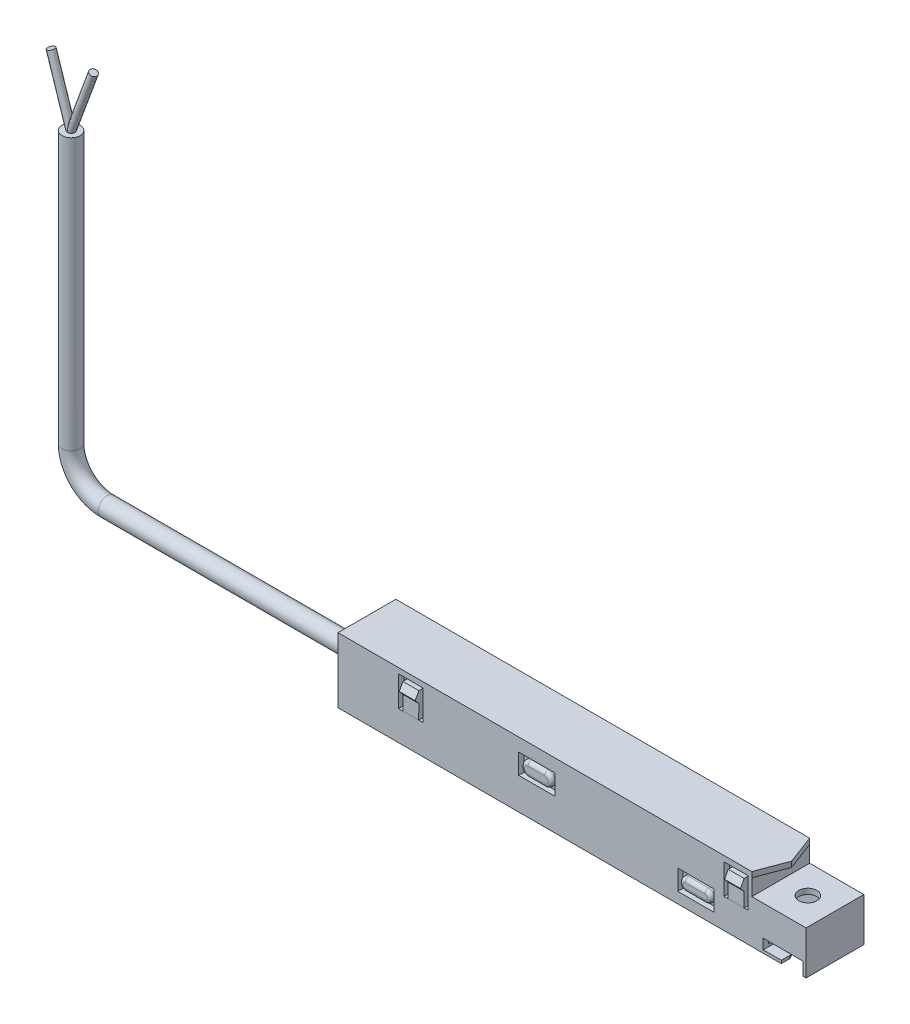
ISO-10303-21;
HEADER;
FILE_DESCRIPTION(('STEP AP214'),'2;1');
FILE_NAME('part.step','',(''),(''),'','','');
FILE_SCHEMA(('AUTOMOTIVE_DESIGN { 1 0 10303 214 1 1 1 1 }'));
ENDSEC;
DATA;
#1=APPLICATION_CONTEXT('core data for automotive mechanical design processes');
#2=APPLICATION_PROTOCOL_DEFINITION('international standard','automotive_design',2000,#1);
#3=PRODUCT_CONTEXT('',#1,'mechanical');
#4=PRODUCT('Part','Part','',(#3));
#5=PRODUCT_RELATED_PRODUCT_CATEGORY('part','',(#4));
#6=PRODUCT_DEFINITION_FORMATION('','',#4);
#7=PRODUCT_DEFINITION_CONTEXT('part definition',#1,'design');
#8=PRODUCT_DEFINITION('design','',#6,#7);
#9=PRODUCT_DEFINITION_SHAPE('','',#8);
#10=(LENGTH_UNIT() NAMED_UNIT(*) SI_UNIT(.MILLI.,.METRE.));
#11=(NAMED_UNIT(*) PLANE_ANGLE_UNIT() SI_UNIT($,.RADIAN.));
#12=(NAMED_UNIT(*) SI_UNIT($,.STERADIAN.) SOLID_ANGLE_UNIT());
#13=UNCERTAINTY_MEASURE_WITH_UNIT(LENGTH_MEASURE(1.E-05),#10,'distance_accuracy_value','');
#14=(GEOMETRIC_REPRESENTATION_CONTEXT(3) GLOBAL_UNCERTAINTY_ASSIGNED_CONTEXT((#13)) GLOBAL_UNIT_ASSIGNED_CONTEXT((#10,
#11,#12)) REPRESENTATION_CONTEXT('',''));
#15=CARTESIAN_POINT('',(0.,0.,0.));
#16=DIRECTION('',(0.,0.,1.));
#17=DIRECTION('',(1.,0.,0.));
#18=AXIS2_PLACEMENT_3D('',#15,#16,#17);
#19=CARTESIAN_POINT('',(-61.6042958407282,8.40961210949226,-4.00378202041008E-11));
#20=DIRECTION('',(1.,0.,0.));
#21=DIRECTION('',(0.,8.02252361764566E-13,-1.));
#22=AXIS2_PLACEMENT_3D('',#19,#20,#21);
#23=PLANE('',#22);
#24=CARTESIAN_POINT('',(-61.6042958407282,8.40961210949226,-4.00378202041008E-11));
#25=DIRECTION('',(1.,0.,0.));
#26=DIRECTION('',(0.,8.02252361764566E-13,-1.));
#27=AXIS2_PLACEMENT_3D('',#24,#25,#26);
#28=CIRCLE('',#27,2.5);
#29=CARTESIAN_POINT('',(-61.6042958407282,8.40961210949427,-2.50000000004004));
#30=VERTEX_POINT('',#29);
#31=EDGE_CURVE('E71',#30,#30,#28,.T.);
#32=ORIENTED_EDGE('',*,*,#31,.T.);
#33=EDGE_LOOP('',(#32));
#34=FACE_BOUND('',#33,.T.);
#35=ADVANCED_FACE('F48',(#34),#23,.T.);
#36=CARTESIAN_POINT('',(-146.604295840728,93.4096121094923,2.81536305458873E-11));
#37=DIRECTION('',(0.,-1.,-8.02252361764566E-13));
#38=DIRECTION('',(0.,8.02252361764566E-13,-1.));
#39=AXIS2_PLACEMENT_3D('',#36,#37,#38);
#40=PLANE('',#39);
#41=CARTESIAN_POINT('',(-146.604295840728,93.4096121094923,2.81536305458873E-11));
#42=DIRECTION('',(0.,-1.,-8.02252361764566E-13));
#43=DIRECTION('',(-1.,0.,0.));
#44=AXIS2_PLACEMENT_3D('',#41,#42,#43);
#45=ELLIPSE('',#44,1.05194964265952,1.);
#46=CARTESIAN_POINT('',(-146.604295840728,93.4096121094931,-0.999999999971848));
#47=VERTEX_POINT('',#46);
#48=CARTESIAN_POINT('',(-146.604295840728,93.4096121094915,1.00000000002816));
#49=VERTEX_POINT('',#48);
#50=EDGE_CURVE('E12',#47,#49,#45,.F.);
#51=ORIENTED_EDGE('',*,*,#50,.F.);
#52=CARTESIAN_POINT('',(-146.604295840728,93.4096121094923,2.81536305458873E-11));
#53=DIRECTION('',(0.,-1.,-8.02252361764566E-13));
#54=DIRECTION('',(-1.,0.,0.));
#55=AXIS2_PLACEMENT_3D('',#52,#53,#54);
#56=ELLIPSE('',#55,1.06517999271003,1.);
#57=EDGE_CURVE('E55',#49,#47,#56,.F.);
#58=ORIENTED_EDGE('',*,*,#57,.F.);
#59=EDGE_LOOP('',(#51,#58));
#60=FACE_BOUND('',#59,.T.);
#61=CARTESIAN_POINT('',(-146.604295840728,93.4096121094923,2.81536305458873E-11));
#62=DIRECTION('',(0.,-1.,-8.02252361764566E-13));
#63=DIRECTION('',(0.,8.02252361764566E-13,-1.));
#64=AXIS2_PLACEMENT_3D('',#61,#62,#63);
#65=CIRCLE('',#64,2.5);
#66=CARTESIAN_POINT('',(-146.604295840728,93.4096121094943,-2.49999999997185));
#67=VERTEX_POINT('',#66);
#68=EDGE_CURVE('E69',#67,#67,#65,.T.);
#69=ORIENTED_EDGE('',*,*,#68,.F.);
#70=EDGE_LOOP('',(#69));
#71=FACE_BOUND('',#70,.T.);
#72=ADVANCED_FACE('F61',(#60,#71),#40,.F.);
#73=CARTESIAN_POINT('',(-61.6042958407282,8.40961210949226,-4.00378202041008E-11));
#74=DIRECTION('',(-1.,0.,0.));
#75=DIRECTION('',(0.,1.,8.02252361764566E-13));
#76=AXIS2_PLACEMENT_3D('',#73,#74,#75);
#77=CYLINDRICAL_SURFACE('',#76,2.5);
#78=CARTESIAN_POINT('',(-136.604295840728,8.40961210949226,-4.00378202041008E-11));
#79=DIRECTION('',(1.,0.,0.));
#80=DIRECTION('',(0.,8.02252361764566E-13,-1.));
#81=AXIS2_PLACEMENT_3D('',#78,#79,#80);
#82=CIRCLE('',#81,2.5);
#83=CARTESIAN_POINT('',(-136.604295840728,5.90961210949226,-4.20434511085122E-11));
#84=VERTEX_POINT('',#83);
#85=EDGE_CURVE('E75',#84,#84,#82,.T.);
#86=ORIENTED_EDGE('',*,*,#85,.T.);
#87=EDGE_LOOP('',(#86));
#88=FACE_BOUND('',#87,.T.);
#89=ORIENTED_EDGE('',*,*,#31,.F.);
#90=EDGE_LOOP('',(#89));
#91=FACE_BOUND('',#90,.T.);
#92=ADVANCED_FACE('F94',(#88,#91),#77,.T.);
#93=CARTESIAN_POINT('',(-136.604295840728,18.4096121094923,-3.20152965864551E-11));
#94=DIRECTION('',(0.,8.02252361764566E-13,-1.));
#95=DIRECTION('',(1.,0.,0.));
#96=AXIS2_PLACEMENT_3D('',#93,#94,#95);
#97=TOROIDAL_SURFACE('',#96,10.,2.5);
#98=CARTESIAN_POINT('',(-146.604295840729,18.4096121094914,-3.20152965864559E-11));
#99=DIRECTION('',(0.,-1.,-8.02252361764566E-13));
#100=DIRECTION('',(0.,8.02252361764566E-13,-1.));
#101=AXIS2_PLACEMENT_3D('',#98,#99,#100);
#102=CIRCLE('',#101,2.5);
#103=CARTESIAN_POINT('',(-149.104295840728,18.4096121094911,-3.2015296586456E-11));
#104=VERTEX_POINT('',#103);
#105=EDGE_CURVE('E85',#104,#104,#102,.T.);
#106=CARTESIAN_POINT('',(-136.604295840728,18.4096121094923,-3.20152965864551E-11));
#107=DIRECTION('',(0.,8.02252361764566E-13,-1.));
#108=DIRECTION('',(1.,0.,0.));
#109=AXIS2_PLACEMENT_3D('',#106,#107,#108);
#110=CIRCLE('',#109,12.5);
#111=EDGE_CURVE('',#84,#104,#110,.T.);
#112=ORIENTED_EDGE('',*,*,#85,.F.);
#113=ORIENTED_EDGE('',*,*,#105,.T.);
#114=ORIENTED_EDGE('',*,*,#111,.T.);
#115=ORIENTED_EDGE('',*,*,#111,.F.);
#116=EDGE_LOOP('',(#112,#114,#113,#115));
#117=FACE_BOUND('',#116,.T.);
#118=ADVANCED_FACE('F99',(#117),#97,.T.);
#119=CARTESIAN_POINT('',(-146.604295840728,18.4096121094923,-3.20152965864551E-11));
#120=DIRECTION('',(0.,1.,8.02252361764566E-13));
#121=DIRECTION('',(0.,-8.02252361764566E-13,1.));
#122=AXIS2_PLACEMENT_3D('',#119,#120,#121);
#123=CYLINDRICAL_SURFACE('',#122,2.5);
#124=ORIENTED_EDGE('',*,*,#68,.T.);
#125=EDGE_LOOP('',(#124));
#126=FACE_BOUND('',#125,.T.);
#127=ORIENTED_EDGE('',*,*,#105,.F.);
#128=EDGE_LOOP('',(#127));
#129=FACE_BOUND('',#128,.T.);
#130=ADVANCED_FACE('F91',(#126,#129),#123,.T.);
#131=CARTESIAN_POINT('',(-145.588144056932,90.2972941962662,2.56567661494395E-11));
#132=DIRECTION('',(-0.310369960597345,0.950615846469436,7.62633807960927E-13));
#133=DIRECTION('',(0.950615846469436,0.310369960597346,2.48995033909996E-13));
#134=AXIS2_PLACEMENT_3D('',#131,#132,#133);
#135=CYLINDRICAL_SURFACE('',#134,1.);
#136=CARTESIAN_POINT('',(-152.13350811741,110.344745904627,4.1739881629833E-11));
#137=DIRECTION('',(0.310369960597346,-0.950615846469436,-7.62633807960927E-13));
#138=DIRECTION('',(-0.950615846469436,-0.310369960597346,-2.48995033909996E-13));
#139=AXIS2_PLACEMENT_3D('',#136,#137,#138);
#140=CIRCLE('',#139,1.);
#141=CARTESIAN_POINT('',(-153.084123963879,110.03437594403,4.1490886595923E-11));
#142=VERTEX_POINT('',#141);
#143=EDGE_CURVE('E78',#142,#142,#140,.T.);
#144=ORIENTED_EDGE('',*,*,#143,.T.);
#145=EDGE_LOOP('',(#144));
#146=FACE_BOUND('',#145,.T.);
#147=CARTESIAN_POINT('',(-146.604295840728,93.4096121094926,2.81536305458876E-11));
#148=DIRECTION('',(-0.999837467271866,0.0180288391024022,0.));
#149=DIRECTION('',(-0.0180288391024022,-0.999837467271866,-8.02121969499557E-13));
#150=AXIS2_PLACEMENT_3D('',#147,#148,#149);
#151=ELLIPSE('',#150,3.0538266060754,1.);
#152=EDGE_CURVE('E68',#49,#47,#151,.T.);
#153=ORIENTED_EDGE('',*,*,#152,.T.);
#154=ORIENTED_EDGE('',*,*,#50,.T.);
#155=EDGE_LOOP('',(#153,#154));
#156=FACE_BOUND('',#155,.T.);
#157=ADVANCED_FACE('F70',(#146,#156),#135,.T.);
#158=CARTESIAN_POINT('',(-140.390961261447,110.344745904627,4.1739881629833E-11));
#159=DIRECTION('',(-0.344439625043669,-0.938808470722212,-7.53161312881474E-13));
#160=DIRECTION('',(-0.938808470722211,0.344439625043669,2.76327502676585E-13));
#161=AXIS2_PLACEMENT_3D('',#158,#159,#160);
#162=CYLINDRICAL_SURFACE('',#161,1.);
#163=CARTESIAN_POINT('',(-140.390961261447,110.344745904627,4.1739881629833E-11));
#164=DIRECTION('',(0.344439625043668,0.938808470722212,7.53161312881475E-13));
#165=DIRECTION('',(0.938808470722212,-0.344439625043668,-2.76327502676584E-13));
#166=AXIS2_PLACEMENT_3D('',#163,#164,#165);
#167=CIRCLE('',#166,1.);
#168=CARTESIAN_POINT('',(-139.452152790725,110.000306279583,4.14635541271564E-11));
#169=VERTEX_POINT('',#168);
#170=EDGE_CURVE('E72',#169,#169,#167,.T.);
#171=ORIENTED_EDGE('',*,*,#170,.F.);
#172=EDGE_LOOP('',(#171));
#173=FACE_BOUND('',#172,.T.);
#174=ORIENTED_EDGE('',*,*,#152,.F.);
#175=ORIENTED_EDGE('',*,*,#57,.T.);
#176=EDGE_LOOP('',(#174,#175));
#177=FACE_BOUND('',#176,.T.);
#178=ADVANCED_FACE('F67',(#173,#177),#162,.T.);
#179=CARTESIAN_POINT('',(-152.13350811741,110.344745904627,4.1739881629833E-11));
#180=DIRECTION('',(0.310369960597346,-0.950615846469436,-7.62633807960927E-13));
#181=DIRECTION('',(-0.950615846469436,-0.310369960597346,-2.48995033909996E-13));
#182=AXIS2_PLACEMENT_3D('',#179,#180,#181);
#183=PLANE('',#182);
#184=ORIENTED_EDGE('',*,*,#143,.F.);
#185=EDGE_LOOP('',(#184));
#186=FACE_BOUND('',#185,.T.);
#187=ADVANCED_FACE('F114',(#186),#183,.F.);
#188=CARTESIAN_POINT('',(-140.390961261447,110.344745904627,4.1739881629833E-11));
#189=DIRECTION('',(0.344439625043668,0.938808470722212,7.53161312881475E-13));
#190=DIRECTION('',(0.938808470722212,-0.344439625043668,-2.76327502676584E-13));
#191=AXIS2_PLACEMENT_3D('',#188,#189,#190);
#192=PLANE('',#191);
#193=ORIENTED_EDGE('',*,*,#170,.T.);
#194=EDGE_LOOP('',(#193));
#195=FACE_BOUND('',#194,.T.);
#196=ADVANCED_FACE('F117',(#195),#192,.T.);
#197=CLOSED_SHELL('',(#35,#72,#92,#118,#130,#157,#178,#187,#196));
#198=MANIFOLD_SOLID_BREP('B2',#197);
#199=CARTESIAN_POINT('',(0.,0.,0.));
#200=DIRECTION('',(0.,1.,0.));
#201=DIRECTION('',(0.,0.,1.));
#202=AXIS2_PLACEMENT_3D('',#199,#200,#201);
#203=PLANE('',#202);
#204=DIRECTION('',(1.,0.,0.));
#205=VECTOR('',#204,1.);
#206=CARTESIAN_POINT('',(-64.75,0.,8.));
#207=LINE('',#206,#205);
#208=CARTESIAN_POINT('',(63.8888062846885,0.,8.));
#209=VERTEX_POINT('',#208);
#210=CARTESIAN_POINT('',(64.75,0.,8.));
#211=VERTEX_POINT('',#210);
#212=EDGE_CURVE('E1277',#209,#211,#207,.T.);
#213=ORIENTED_EDGE('',*,*,#212,.F.);
#214=DIRECTION('',(0.,0.,1.));
#215=VECTOR('',#214,1.);
#216=CARTESIAN_POINT('',(63.8888062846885,0.,8.));
#217=LINE('',#216,#215);
#218=CARTESIAN_POINT('',(63.8888062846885,0.,4.1505826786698));
#219=VERTEX_POINT('',#218);
#220=EDGE_CURVE('E1445',#219,#209,#217,.T.);
#221=ORIENTED_EDGE('',*,*,#220,.F.);
#222=DIRECTION('',(0.509674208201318,0.,0.860367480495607));
#223=VECTOR('',#222,1.);
#224=CARTESIAN_POINT('',(63.8888062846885,0.,4.1505826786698));
#225=LINE('',#224,#223);
#226=CARTESIAN_POINT('',(57.2996300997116,0.,-6.97243045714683));
#227=VERTEX_POINT('',#226);
#228=EDGE_CURVE('E1506',#227,#219,#225,.T.);
#229=ORIENTED_EDGE('',*,*,#228,.F.);
#230=DIRECTION('',(0.,0.,1.));
#231=VECTOR('',#230,1.);
#232=CARTESIAN_POINT('',(57.2996300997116,0.,-6.97243045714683));
#233=LINE('',#232,#231);
#234=CARTESIAN_POINT('',(57.2996300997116,0.,-8.));
#235=VERTEX_POINT('',#234);
#236=EDGE_CURVE('E1499',#235,#227,#233,.T.);
#237=ORIENTED_EDGE('',*,*,#236,.F.);
#238=DIRECTION('',(-1.,0.,0.));
#239=VECTOR('',#238,1.);
#240=CARTESIAN_POINT('',(-64.75,0.,-8.));
#241=LINE('',#240,#239);
#242=CARTESIAN_POINT('',(64.75,0.,-8.));
#243=VERTEX_POINT('',#242);
#244=EDGE_CURVE('E1272',#243,#235,#241,.T.);
#245=ORIENTED_EDGE('',*,*,#244,.F.);
#246=DIRECTION('',(0.,0.,-1.));
#247=VECTOR('',#246,1.);
#248=CARTESIAN_POINT('',(64.75,0.,-8.));
#249=LINE('',#248,#247);
#250=EDGE_CURVE('E1259',#211,#243,#249,.T.);
#251=ORIENTED_EDGE('',*,*,#250,.F.);
#252=EDGE_LOOP('',(#213,#221,#229,#237,#245,#251));
#253=FACE_BOUND('',#252,.T.);
#254=ADVANCED_FACE('F193',(#253),#203,.F.);
#255=CARTESIAN_POINT('',(63.8888062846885,0.811977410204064,-10.));
#256=DIRECTION('',(0.,-1.,0.));
#257=DIRECTION('',(1.,0.,0.));
#258=AXIS2_PLACEMENT_3D('',#255,#256,#257);
#259=PLANE('',#258);
#260=DIRECTION('',(0.,0.,1.));
#261=VECTOR('',#260,1.);
#262=CARTESIAN_POINT('',(57.2996300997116,0.811977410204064,-10.));
#263=LINE('',#262,#261);
#264=CARTESIAN_POINT('',(57.2996300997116,0.811977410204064,-8.));
#265=VERTEX_POINT('',#264);
#266=CARTESIAN_POINT('',(57.2996300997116,0.811977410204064,-6.97243045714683));
#267=VERTEX_POINT('',#266);
#268=EDGE_CURVE('E1375',#265,#267,#263,.T.);
#269=ORIENTED_EDGE('',*,*,#268,.T.);
#270=DIRECTION('',(0.509674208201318,0.,0.860367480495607));
#271=VECTOR('',#270,1.);
#272=CARTESIAN_POINT('',(57.6836751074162,0.811977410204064,-6.32413428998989));
#273=LINE('',#272,#271);
#274=CARTESIAN_POINT('',(63.8888062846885,0.811977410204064,4.1505826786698));
#275=VERTEX_POINT('',#274);
#276=EDGE_CURVE('E1378',#267,#275,#273,.T.);
#277=ORIENTED_EDGE('',*,*,#276,.T.);
#278=DIRECTION('',(0.,0.,1.));
#279=VECTOR('',#278,1.);
#280=CARTESIAN_POINT('',(63.8888062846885,0.811977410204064,-10.));
#281=LINE('',#280,#279);
#282=CARTESIAN_POINT('',(63.8888062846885,0.811977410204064,-8.));
#283=VERTEX_POINT('',#282);
#284=EDGE_CURVE('E790',#283,#275,#281,.T.);
#285=ORIENTED_EDGE('',*,*,#284,.F.);
#286=DIRECTION('',(1.,0.,0.));
#287=VECTOR('',#286,1.);
#288=CARTESIAN_POINT('',(-64.75,0.811977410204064,-8.));
#289=LINE('',#288,#287);
#290=EDGE_CURVE('E814',#265,#283,#289,.T.);
#291=ORIENTED_EDGE('',*,*,#290,.F.);
#292=EDGE_LOOP('',(#269,#277,#285,#291));
#293=FACE_BOUND('',#292,.T.);
#294=ADVANCED_FACE('F1503',(#293),#259,.F.);
#295=CARTESIAN_POINT('',(52.8888062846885,0.811977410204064,-10.));
#296=DIRECTION('',(-1.,0.,0.));
#297=DIRECTION('',(0.,0.,1.));
#298=AXIS2_PLACEMENT_3D('',#295,#296,#297);
#299=PLANE('',#298);
#300=DIRECTION('',(0.,0.,1.));
#301=VECTOR('',#300,1.);
#302=CARTESIAN_POINT('',(52.8888062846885,0.811977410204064,-10.));
#303=LINE('',#302,#301);
#304=CARTESIAN_POINT('',(52.8888062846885,0.811977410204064,-2.87401087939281));
#305=VERTEX_POINT('',#304);
#306=CARTESIAN_POINT('',(52.8888062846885,0.811977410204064,8.));
#307=VERTEX_POINT('',#306);
#308=EDGE_CURVE('E800',#305,#307,#303,.T.);
#309=ORIENTED_EDGE('',*,*,#308,.F.);
#310=DIRECTION('',(0.,1.,0.));
#311=VECTOR('',#310,1.);
#312=CARTESIAN_POINT('',(52.8888062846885,0.811977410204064,-2.87401087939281));
#313=LINE('',#312,#311);
#314=CARTESIAN_POINT('',(52.8888062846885,1.5,-2.87401087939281));
#315=VERTEX_POINT('',#314);
#316=EDGE_CURVE('E1370',#305,#315,#313,.T.);
#317=ORIENTED_EDGE('',*,*,#316,.T.);
#318=DIRECTION('',(0.,0.,1.));
#319=VECTOR('',#318,1.);
#320=CARTESIAN_POINT('',(52.8888062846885,1.5,0.));
#321=LINE('',#320,#319);
#322=CARTESIAN_POINT('',(52.8888062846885,1.5,6.5));
#323=VERTEX_POINT('',#322);
#324=EDGE_CURVE('E788',#315,#323,#321,.T.);
#325=ORIENTED_EDGE('',*,*,#324,.T.);
#326=DIRECTION('',(0.,1.,0.));
#327=VECTOR('',#326,1.);
#328=CARTESIAN_POINT('',(52.8888062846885,18.,6.5));
#329=LINE('',#328,#327);
#330=CARTESIAN_POINT('',(52.8888062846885,3.61197741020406,6.5));
#331=VERTEX_POINT('',#330);
#332=EDGE_CURVE('E776',#323,#331,#329,.T.);
#333=ORIENTED_EDGE('',*,*,#332,.T.);
#334=DIRECTION('',(0.,0.,1.));
#335=VECTOR('',#334,1.);
#336=CARTESIAN_POINT('',(52.8888062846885,3.61197741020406,-10.));
#337=LINE('',#336,#335);
#338=CARTESIAN_POINT('',(52.8888062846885,3.61197741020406,8.));
#339=VERTEX_POINT('',#338);
#340=EDGE_CURVE('E784',#331,#339,#337,.T.);
#341=ORIENTED_EDGE('',*,*,#340,.T.);
#342=DIRECTION('',(0.,-1.,0.));
#343=VECTOR('',#342,1.);
#344=CARTESIAN_POINT('',(52.8888062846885,0.811977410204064,8.));
#345=LINE('',#344,#343);
#346=EDGE_CURVE('E1414',#339,#307,#345,.T.);
#347=ORIENTED_EDGE('',*,*,#346,.T.);
#348=EDGE_LOOP('',(#309,#317,#325,#333,#341,#347));
#349=FACE_BOUND('',#348,.T.);
#350=ADVANCED_FACE('F782',(#349),#299,.F.);
#351=CARTESIAN_POINT('',(-47.95,8.2,-18.));
#352=DIRECTION('',(0.,-1.,0.));
#353=DIRECTION('',(0.,0.,-1.));
#354=AXIS2_PLACEMENT_3D('',#351,#352,#353);
#355=PLANE('',#354);
#356=DIRECTION('',(0.,0.,-1.));
#357=VECTOR('',#356,1.);
#358=CARTESIAN_POINT('',(-46.81547727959,8.2,-8.00090432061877));
#359=LINE('',#358,#357);
#360=CARTESIAN_POINT('',(-46.81547727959,8.2,-6.50000000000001));
#361=VERTEX_POINT('',#360);
#362=CARTESIAN_POINT('',(-46.81547727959,8.2,-8.));
#363=VERTEX_POINT('',#362);
#364=EDGE_CURVE('E850',#361,#363,#359,.T.);
#365=ORIENTED_EDGE('',*,*,#364,.T.);
#366=DIRECTION('',(1.,0.,0.));
#367=VECTOR('',#366,1.);
#368=CARTESIAN_POINT('',(-64.75,8.2,-8.));
#369=LINE('',#368,#367);
#370=CARTESIAN_POINT('',(-47.95,8.2,-8.));
#371=VERTEX_POINT('',#370);
#372=EDGE_CURVE('E1195',#371,#363,#369,.T.);
#373=ORIENTED_EDGE('',*,*,#372,.F.);
#374=DIRECTION('',(0.,0.,1.));
#375=VECTOR('',#374,1.);
#376=CARTESIAN_POINT('',(-47.95,8.2,-18.));
#377=LINE('',#376,#375);
#378=CARTESIAN_POINT('',(-47.95,8.2,-6.5));
#379=VERTEX_POINT('',#378);
#380=EDGE_CURVE('E1031',#371,#379,#377,.T.);
#381=ORIENTED_EDGE('',*,*,#380,.T.);
#382=DIRECTION('',(1.,0.,0.));
#383=VECTOR('',#382,1.);
#384=CARTESIAN_POINT('',(-64.75,8.2,-6.5));
#385=LINE('',#384,#383);
#386=EDGE_CURVE('E1191',#379,#361,#385,.T.);
#387=ORIENTED_EDGE('',*,*,#386,.T.);
#388=EDGE_LOOP('',(#365,#373,#381,#387));
#389=FACE_BOUND('',#388,.T.);
#390=ADVANCED_FACE('F1650',(#389),#355,.F.);
#391=DIRECTION('',(0.,0.,1.));
#392=VECTOR('',#391,1.);
#393=CARTESIAN_POINT('',(-46.81547727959,8.2,-18.));
#394=LINE('',#393,#392);
#395=CARTESIAN_POINT('',(-46.81547727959,8.2,6.5));
#396=VERTEX_POINT('',#395);
#397=CARTESIAN_POINT('',(-46.81547727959,8.2,8.));
#398=VERTEX_POINT('',#397);
#399=EDGE_CURVE('E1365',#396,#398,#394,.T.);
#400=ORIENTED_EDGE('',*,*,#399,.F.);
#401=DIRECTION('',(-1.,0.,0.));
#402=VECTOR('',#401,1.);
#403=CARTESIAN_POINT('',(-64.75,8.2,6.5));
#404=LINE('',#403,#402);
#405=CARTESIAN_POINT('',(-47.95,8.2,6.5));
#406=VERTEX_POINT('',#405);
#407=EDGE_CURVE('E1353',#396,#406,#404,.T.);
#408=ORIENTED_EDGE('',*,*,#407,.T.);
#409=CARTESIAN_POINT('',(-47.95,8.2,8.));
#410=VERTEX_POINT('',#409);
#411=EDGE_CURVE('E1020',#406,#410,#377,.T.);
#412=ORIENTED_EDGE('',*,*,#411,.T.);
#413=DIRECTION('',(1.,0.,0.));
#414=VECTOR('',#413,1.);
#415=CARTESIAN_POINT('',(-47.95,8.2,8.));
#416=LINE('',#415,#414);
#417=EDGE_CURVE('E1010',#410,#398,#416,.T.);
#418=ORIENTED_EDGE('',*,*,#417,.T.);
#419=EDGE_LOOP('',(#400,#408,#412,#418));
#420=FACE_BOUND('',#419,.T.);
#421=ADVANCED_FACE('F2243',(#420),#355,.F.);
#422=CARTESIAN_POINT('',(42.03452272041,8.2,-18.));
#423=DIRECTION('',(0.,-1.,0.));
#424=DIRECTION('',(0.,0.,-1.));
#425=AXIS2_PLACEMENT_3D('',#422,#423,#424);
#426=PLANE('',#425);
#427=DIRECTION('',(0.,0.,-1.));
#428=VECTOR('',#427,1.);
#429=CARTESIAN_POINT('',(43.18452272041,8.2,-8.00090432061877));
#430=LINE('',#429,#428);
#431=CARTESIAN_POINT('',(43.18452272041,8.2,-6.50000000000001));
#432=VERTEX_POINT('',#431);
#433=CARTESIAN_POINT('',(43.18452272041,8.2,-8.));
#434=VERTEX_POINT('',#433);
#435=EDGE_CURVE('E943',#432,#434,#430,.T.);
#436=ORIENTED_EDGE('',*,*,#435,.T.);
#437=DIRECTION('',(1.,0.,0.));
#438=VECTOR('',#437,1.);
#439=CARTESIAN_POINT('',(-64.75,8.2,-8.));
#440=LINE('',#439,#438);
#441=CARTESIAN_POINT('',(42.03452272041,8.2,-8.));
#442=VERTEX_POINT('',#441);
#443=EDGE_CURVE('E1144',#442,#434,#440,.T.);
#444=ORIENTED_EDGE('',*,*,#443,.F.);
#445=DIRECTION('',(0.,0.,1.));
#446=VECTOR('',#445,1.);
#447=CARTESIAN_POINT('',(42.03452272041,8.2,-18.));
#448=LINE('',#447,#446);
#449=CARTESIAN_POINT('',(42.03452272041,8.2,-6.5));
#450=VERTEX_POINT('',#449);
#451=EDGE_CURVE('E1103',#442,#450,#448,.T.);
#452=ORIENTED_EDGE('',*,*,#451,.T.);
#453=DIRECTION('',(1.,0.,0.));
#454=VECTOR('',#453,1.);
#455=CARTESIAN_POINT('',(-64.75,8.2,-6.5));
#456=LINE('',#455,#454);
#457=EDGE_CURVE('E1140',#450,#432,#456,.T.);
#458=ORIENTED_EDGE('',*,*,#457,.T.);
#459=EDGE_LOOP('',(#436,#444,#452,#458));
#460=FACE_BOUND('',#459,.T.);
#461=ADVANCED_FACE('F1596',(#460),#426,.F.);
#462=DIRECTION('',(0.,0.,1.));
#463=VECTOR('',#462,1.);
#464=CARTESIAN_POINT('',(43.18452272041,8.2,-18.));
#465=LINE('',#464,#463);
#466=CARTESIAN_POINT('',(43.18452272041,8.2,6.5));
#467=VERTEX_POINT('',#466);
#468=CARTESIAN_POINT('',(43.18452272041,8.2,8.));
#469=VERTEX_POINT('',#468);
#470=EDGE_CURVE('E1360',#467,#469,#465,.T.);
#471=ORIENTED_EDGE('',*,*,#470,.F.);
#472=DIRECTION('',(-1.,0.,0.));
#473=VECTOR('',#472,1.);
#474=CARTESIAN_POINT('',(-64.75,8.2,6.5));
#475=LINE('',#474,#473);
#476=CARTESIAN_POINT('',(42.03452272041,8.2,6.5));
#477=VERTEX_POINT('',#476);
#478=EDGE_CURVE('E1331',#467,#477,#475,.T.);
#479=ORIENTED_EDGE('',*,*,#478,.T.);
#480=CARTESIAN_POINT('',(42.03452272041,8.2,8.));
#481=VERTEX_POINT('',#480);
#482=EDGE_CURVE('E1094',#477,#481,#448,.T.);
#483=ORIENTED_EDGE('',*,*,#482,.T.);
#484=DIRECTION('',(1.,0.,0.));
#485=VECTOR('',#484,1.);
#486=CARTESIAN_POINT('',(42.03452272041,8.2,8.));
#487=LINE('',#486,#485);
#488=EDGE_CURVE('E1084',#481,#469,#487,.T.);
#489=ORIENTED_EDGE('',*,*,#488,.T.);
#490=EDGE_LOOP('',(#471,#479,#483,#489));
#491=FACE_BOUND('',#490,.T.);
#492=ADVANCED_FACE('F2264',(#491),#426,.F.);
#493=CARTESIAN_POINT('',(64.75,18.,-8.));
#494=DIRECTION('',(-1.,0.,0.));
#495=DIRECTION('',(0.,0.,1.));
#496=AXIS2_PLACEMENT_3D('',#493,#494,#495);
#497=PLANE('',#496);
#498=DIRECTION('',(0.,-1.,0.));
#499=VECTOR('',#498,1.);
#500=CARTESIAN_POINT('',(64.75,18.,-8.));
#501=LINE('',#500,#499);
#502=CARTESIAN_POINT('',(64.75,12.,-8.));
#503=VERTEX_POINT('',#502);
#504=EDGE_CURVE('E1288',#503,#243,#501,.T.);
#505=ORIENTED_EDGE('',*,*,#504,.F.);
#506=DIRECTION('',(0.,0.,1.));
#507=VECTOR('',#506,1.);
#508=CARTESIAN_POINT('',(64.75,12.,-8.));
#509=LINE('',#508,#507);
#510=CARTESIAN_POINT('',(64.75,12.,8.));
#511=VERTEX_POINT('',#510);
#512=EDGE_CURVE('E1256',#503,#511,#509,.T.);
#513=ORIENTED_EDGE('',*,*,#512,.T.);
#514=DIRECTION('',(0.,-1.,0.));
#515=VECTOR('',#514,1.);
#516=CARTESIAN_POINT('',(64.75,18.,8.));
#517=LINE('',#516,#515);
#518=EDGE_CURVE('E1268',#511,#211,#517,.T.);
#519=ORIENTED_EDGE('',*,*,#518,.T.);
#520=ORIENTED_EDGE('',*,*,#250,.T.);
#521=EDGE_LOOP('',(#505,#513,#519,#520));
#522=FACE_BOUND('',#521,.T.);
#523=ADVANCED_FACE('F1490',(#522),#497,.F.);
#524=CARTESIAN_POINT('',(-64.75,18.,-8.));
#525=DIRECTION('',(0.,0.,1.));
#526=DIRECTION('',(1.,0.,0.));
#527=AXIS2_PLACEMENT_3D('',#524,#525,#526);
#528=PLANE('',#527);
#529=DIRECTION('',(-1.,0.,0.));
#530=VECTOR('',#529,1.);
#531=CARTESIAN_POINT('',(-64.75,3.61197741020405,-8.));
#532=LINE('',#531,#530);
#533=CARTESIAN_POINT('',(63.8888062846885,3.61197741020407,-8.));
#534=VERTEX_POINT('',#533);
#535=CARTESIAN_POINT('',(52.8888062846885,3.61197741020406,-8.));
#536=VERTEX_POINT('',#535);
#537=EDGE_CURVE('E811',#534,#536,#532,.T.);
#538=ORIENTED_EDGE('',*,*,#537,.T.);
#539=DIRECTION('',(0.,-1.,0.));
#540=VECTOR('',#539,1.);
#541=CARTESIAN_POINT('',(52.8888062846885,18.,-8.));
#542=LINE('',#541,#540);
#543=CARTESIAN_POINT('',(52.8888062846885,3.,-8.));
#544=VERTEX_POINT('',#543);
#545=EDGE_CURVE('E808',#536,#544,#542,.T.);
#546=ORIENTED_EDGE('',*,*,#545,.T.);
#547=DIRECTION('',(1.,0.,0.));
#548=VECTOR('',#547,1.);
#549=CARTESIAN_POINT('',(57.2996300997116,3.,-8.));
#550=LINE('',#549,#548);
#551=CARTESIAN_POINT('',(52.2129734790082,3.,-8.));
#552=VERTEX_POINT('',#551);
#553=EDGE_CURVE('E217',#552,#544,#550,.T.);
#554=ORIENTED_EDGE('',*,*,#553,.F.);
#555=DIRECTION('',(0.,-1.,0.));
#556=VECTOR('',#555,1.);
#557=CARTESIAN_POINT('',(52.2129734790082,3.,-8.));
#558=LINE('',#557,#556);
#559=CARTESIAN_POINT('',(52.2129734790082,0.,-8.));
#560=VERTEX_POINT('',#559);
#561=EDGE_CURVE('E1399',#552,#560,#558,.T.);
#562=ORIENTED_EDGE('',*,*,#561,.T.);
#563=CARTESIAN_POINT('',(-64.75,0.,-8.));
#564=VERTEX_POINT('',#563);
#565=EDGE_CURVE('E1271',#560,#564,#241,.T.);
#566=ORIENTED_EDGE('',*,*,#565,.T.);
#567=DIRECTION('',(0.,-1.,0.));
#568=VECTOR('',#567,1.);
#569=CARTESIAN_POINT('',(-64.75,18.,-8.));
#570=LINE('',#569,#568);
#571=CARTESIAN_POINT('',(-64.75,18.,-8.));
#572=VERTEX_POINT('',#571);
#573=EDGE_CURVE('E1285',#572,#564,#570,.T.);
#574=ORIENTED_EDGE('',*,*,#573,.F.);
#575=DIRECTION('',(-1.,0.,0.));
#576=VECTOR('',#575,1.);
#577=CARTESIAN_POINT('',(-64.75,18.,-8.));
#578=LINE('',#577,#576);
#579=CARTESIAN_POINT('',(49.73452272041,18.,-8.));
#580=VERTEX_POINT('',#579);
#581=EDGE_CURVE('E1260',#580,#572,#578,.T.);
#582=ORIENTED_EDGE('',*,*,#581,.F.);
#583=DIRECTION('',(0.,1.,0.));
#584=VECTOR('',#583,1.);
#585=CARTESIAN_POINT('',(49.73452272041,14.,-8.));
#586=LINE('',#585,#584);
#587=CARTESIAN_POINT('',(49.73452272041,14.,-8.));
#588=VERTEX_POINT('',#587);
#589=EDGE_CURVE('E1212',#588,#580,#586,.T.);
#590=ORIENTED_EDGE('',*,*,#589,.F.);
#591=DIRECTION('',(1.,0.,0.));
#592=VECTOR('',#591,1.);
#593=CARTESIAN_POINT('',(-64.75,14.,-8.));
#594=LINE('',#593,#592);
#595=CARTESIAN_POINT('',(49.75,14.,-8.));
#596=VERTEX_POINT('',#595);
#597=EDGE_CURVE('E1238',#588,#596,#594,.T.);
#598=ORIENTED_EDGE('',*,*,#597,.T.);
#599=DIRECTION('',(0.,-1.,0.));
#600=VECTOR('',#599,1.);
#601=CARTESIAN_POINT('',(49.75,18.,-8.));
#602=LINE('',#601,#600);
#603=CARTESIAN_POINT('',(49.75,12.,-8.));
#604=VERTEX_POINT('',#603);
#605=EDGE_CURVE('E1249',#596,#604,#602,.T.);
#606=ORIENTED_EDGE('',*,*,#605,.T.);
#607=DIRECTION('',(1.,0.,0.));
#608=VECTOR('',#607,1.);
#609=CARTESIAN_POINT('',(-64.75,12.,-8.));
#610=LINE('',#609,#608);
#611=EDGE_CURVE('E1253',#604,#503,#610,.T.);
#612=ORIENTED_EDGE('',*,*,#611,.T.);
#613=ORIENTED_EDGE('',*,*,#504,.T.);
#614=ORIENTED_EDGE('',*,*,#244,.T.);
#615=DIRECTION('',(0.,-1.,0.));
#616=VECTOR('',#615,1.);
#617=CARTESIAN_POINT('',(57.2996300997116,3.,-8.));
#618=LINE('',#617,#616);
#619=EDGE_CURVE('E1442',#265,#235,#618,.T.);
#620=ORIENTED_EDGE('',*,*,#619,.F.);
#621=ORIENTED_EDGE('',*,*,#290,.T.);
#622=DIRECTION('',(0.,1.,0.));
#623=VECTOR('',#622,1.);
#624=CARTESIAN_POINT('',(63.8888062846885,18.,-8.));
#625=LINE('',#624,#623);
#626=EDGE_CURVE('E816',#283,#534,#625,.T.);
#627=ORIENTED_EDGE('',*,*,#626,.T.);
#628=EDGE_LOOP('',(#538,#546,#554,#562,#566,#574,#582,#590,#598,#606,#612,#613,#614,#620,#621,#627));
#629=FACE_BOUND('',#628,.T.);
#630=DIRECTION('',(-1.,0.,0.));
#631=VECTOR('',#630,1.);
#632=CARTESIAN_POINT('',(-64.75,16.5,-8.));
#633=LINE('',#632,#631);
#634=CARTESIAN_POINT('',(-41.25,16.5,-8.));
#635=VERTEX_POINT('',#634);
#636=CARTESIAN_POINT('',(-47.95,16.5,-8.));
#637=VERTEX_POINT('',#636);
#638=EDGE_CURVE('E1198',#635,#637,#633,.T.);
#639=ORIENTED_EDGE('',*,*,#638,.T.);
#640=DIRECTION('',(0.,-1.,0.));
#641=VECTOR('',#640,1.);
#642=CARTESIAN_POINT('',(-47.95,18.,-8.));
#643=LINE('',#642,#641);
#644=EDGE_CURVE('E1136',#637,#371,#643,.T.);
#645=ORIENTED_EDGE('',*,*,#644,.T.);
#646=ORIENTED_EDGE('',*,*,#372,.T.);
#647=CARTESIAN_POINT('',(-42.41547727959,8.2,-8.));
#648=VERTEX_POINT('',#647);
#649=EDGE_CURVE('E1199',#363,#648,#369,.T.);
#650=ORIENTED_EDGE('',*,*,#649,.T.);
#651=CARTESIAN_POINT('',(-41.25,8.2,-8.));
#652=VERTEX_POINT('',#651);
#653=EDGE_CURVE('E1194',#648,#652,#369,.T.);
#654=ORIENTED_EDGE('',*,*,#653,.T.);
#655=DIRECTION('',(0.,1.,0.));
#656=VECTOR('',#655,1.);
#657=CARTESIAN_POINT('',(-41.25,18.,-8.));
#658=LINE('',#657,#656);
#659=EDGE_CURVE('E1128',#652,#635,#658,.T.);
#660=ORIENTED_EDGE('',*,*,#659,.T.);
#661=EDGE_LOOP('',(#639,#645,#646,#650,#654,#660));
#662=FACE_BOUND('',#661,.T.);
#663=DIRECTION('',(-1.,0.,0.));
#664=VECTOR('',#663,1.);
#665=CARTESIAN_POINT('',(-64.75,14.4,-8.));
#666=LINE('',#665,#664);
#667=CARTESIAN_POINT('',(-4.74999999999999,14.4,-8.));
#668=VERTEX_POINT('',#667);
#669=CARTESIAN_POINT('',(-14.75,14.4,-8.));
#670=VERTEX_POINT('',#669);
#671=EDGE_CURVE('E1181',#668,#670,#666,.T.);
#672=ORIENTED_EDGE('',*,*,#671,.T.);
#673=DIRECTION('',(0.,-1.,0.));
#674=VECTOR('',#673,1.);
#675=CARTESIAN_POINT('',(-14.75,18.,-8.));
#676=LINE('',#675,#674);
#677=CARTESIAN_POINT('',(-14.75,8.8,-8.));
#678=VERTEX_POINT('',#677);
#679=EDGE_CURVE('E1187',#670,#678,#676,.T.);
#680=ORIENTED_EDGE('',*,*,#679,.T.);
#681=DIRECTION('',(1.,0.,0.));
#682=VECTOR('',#681,1.);
#683=CARTESIAN_POINT('',(-64.75,8.8,-8.));
#684=LINE('',#683,#682);
#685=CARTESIAN_POINT('',(-4.74999999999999,8.8,-8.));
#686=VERTEX_POINT('',#685);
#687=EDGE_CURVE('E1171',#678,#686,#684,.T.);
#688=ORIENTED_EDGE('',*,*,#687,.T.);
#689=DIRECTION('',(0.,1.,0.));
#690=VECTOR('',#689,1.);
#691=CARTESIAN_POINT('',(-4.74999999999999,18.,-8.));
#692=LINE('',#691,#690);
#693=EDGE_CURVE('E1176',#686,#668,#692,.T.);
#694=ORIENTED_EDGE('',*,*,#693,.T.);
#695=EDGE_LOOP('',(#672,#680,#688,#694));
#696=FACE_BOUND('',#695,.T.);
#697=DIRECTION('',(-1.,0.,0.));
#698=VECTOR('',#697,1.);
#699=CARTESIAN_POINT('',(-64.75,8.6,-8.));
#700=LINE('',#699,#698);
#701=CARTESIAN_POINT('',(39.25,8.6,-8.));
#702=VERTEX_POINT('',#701);
#703=CARTESIAN_POINT('',(29.25,8.6,-8.));
#704=VERTEX_POINT('',#703);
#705=EDGE_CURVE('E1160',#702,#704,#700,.T.);
#706=ORIENTED_EDGE('',*,*,#705,.T.);
#707=DIRECTION('',(0.,-1.,0.));
#708=VECTOR('',#707,1.);
#709=CARTESIAN_POINT('',(29.25,18.0000000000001,-8.));
#710=LINE('',#709,#708);
#711=CARTESIAN_POINT('',(29.25,3.,-8.));
#712=VERTEX_POINT('',#711);
#713=EDGE_CURVE('E1166',#704,#712,#710,.T.);
#714=ORIENTED_EDGE('',*,*,#713,.T.);
#715=DIRECTION('',(1.,0.,0.));
#716=VECTOR('',#715,1.);
#717=CARTESIAN_POINT('',(-64.75,3.,-8.));
#718=LINE('',#717,#716);
#719=CARTESIAN_POINT('',(39.25,3.,-8.));
#720=VERTEX_POINT('',#719);
#721=EDGE_CURVE('E1150',#712,#720,#718,.T.);
#722=ORIENTED_EDGE('',*,*,#721,.T.);
#723=DIRECTION('',(0.,1.,0.));
#724=VECTOR('',#723,1.);
#725=CARTESIAN_POINT('',(39.25,18.0000000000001,-8.));
#726=LINE('',#725,#724);
#727=EDGE_CURVE('E1155',#720,#702,#726,.T.);
#728=ORIENTED_EDGE('',*,*,#727,.T.);
#729=EDGE_LOOP('',(#706,#714,#722,#728));
#730=FACE_BOUND('',#729,.T.);
#731=DIRECTION('',(-1.,0.,0.));
#732=VECTOR('',#731,1.);
#733=CARTESIAN_POINT('',(-64.75,16.5,-8.));
#734=LINE('',#733,#732);
#735=CARTESIAN_POINT('',(48.73452272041,16.5,-8.));
#736=VERTEX_POINT('',#735);
#737=CARTESIAN_POINT('',(42.03452272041,16.5,-8.));
#738=VERTEX_POINT('',#737);
#739=EDGE_CURVE('E1106',#736,#738,#734,.T.);
#740=ORIENTED_EDGE('',*,*,#739,.T.);
#741=DIRECTION('',(0.,-1.,0.));
#742=VECTOR('',#741,1.);
#743=CARTESIAN_POINT('',(42.03452272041,18.,-8.));
#744=LINE('',#743,#742);
#745=EDGE_CURVE('E1120',#738,#442,#744,.T.);
#746=ORIENTED_EDGE('',*,*,#745,.T.);
#747=ORIENTED_EDGE('',*,*,#443,.T.);
#748=CARTESIAN_POINT('',(47.58452272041,8.2,-8.));
#749=VERTEX_POINT('',#748);
#750=EDGE_CURVE('E1148',#434,#749,#440,.T.);
#751=ORIENTED_EDGE('',*,*,#750,.T.);
#752=CARTESIAN_POINT('',(48.73452272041,8.2,-8.));
#753=VERTEX_POINT('',#752);
#754=EDGE_CURVE('E1143',#749,#753,#440,.T.);
#755=ORIENTED_EDGE('',*,*,#754,.T.);
#756=DIRECTION('',(0.,1.,0.));
#757=VECTOR('',#756,1.);
#758=CARTESIAN_POINT('',(48.73452272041,18.,-8.));
#759=LINE('',#758,#757);
#760=EDGE_CURVE('E1113',#753,#736,#759,.T.);
#761=ORIENTED_EDGE('',*,*,#760,.T.);
#762=EDGE_LOOP('',(#740,#746,#747,#751,#755,#761));
#763=FACE_BOUND('',#762,.T.);
#764=ADVANCED_FACE('F1453',(#629,#662,#696,#730,#763),#528,.F.);
#765=CARTESIAN_POINT('',(-64.75,18.,-8.));
#766=DIRECTION('',(1.,0.,0.));
#767=DIRECTION('',(0.,0.,-1.));
#768=AXIS2_PLACEMENT_3D('',#765,#766,#767);
#769=PLANE('',#768);
#770=CARTESIAN_POINT('',(-64.75,9.,0.));
#771=DIRECTION('',(-1.,0.,0.));
#772=DIRECTION('',(0.,0.,1.));
#773=AXIS2_PLACEMENT_3D('',#770,#771,#772);
#774=CIRCLE('',#773,6.25);
#775=CARTESIAN_POINT('',(-64.75,9.,6.25));
#776=VERTEX_POINT('',#775);
#777=EDGE_CURVE('E1202',#776,#776,#774,.T.);
#778=ORIENTED_EDGE('',*,*,#777,.F.);
#779=EDGE_LOOP('',(#778));
#780=FACE_BOUND('',#779,.T.);
#781=DIRECTION('',(0.,0.,1.));
#782=VECTOR('',#781,1.);
#783=CARTESIAN_POINT('',(-64.75,0.,-8.));
#784=LINE('',#783,#782);
#785=CARTESIAN_POINT('',(-64.75,0.,8.));
#786=VERTEX_POINT('',#785);
#787=EDGE_CURVE('E1275',#564,#786,#784,.T.);
#788=ORIENTED_EDGE('',*,*,#787,.T.);
#789=DIRECTION('',(0.,-1.,0.));
#790=VECTOR('',#789,1.);
#791=CARTESIAN_POINT('',(-64.75,18.,8.));
#792=LINE('',#791,#790);
#793=CARTESIAN_POINT('',(-64.75,18.,8.));
#794=VERTEX_POINT('',#793);
#795=EDGE_CURVE('E1282',#794,#786,#792,.T.);
#796=ORIENTED_EDGE('',*,*,#795,.F.);
#797=DIRECTION('',(0.,0.,1.));
#798=VECTOR('',#797,1.);
#799=CARTESIAN_POINT('',(-64.75,18.,-8.));
#800=LINE('',#799,#798);
#801=EDGE_CURVE('E1262',#572,#794,#800,.T.);
#802=ORIENTED_EDGE('',*,*,#801,.F.);
#803=ORIENTED_EDGE('',*,*,#573,.T.);
#804=EDGE_LOOP('',(#788,#796,#802,#803));
#805=FACE_BOUND('',#804,.T.);
#806=ADVANCED_FACE('F1462',(#780,#805),#769,.F.);
#807=CARTESIAN_POINT('',(-64.75,18.,8.));
#808=DIRECTION('',(0.,0.,-1.));
#809=DIRECTION('',(-1.,0.,0.));
#810=AXIS2_PLACEMENT_3D('',#807,#808,#809);
#811=PLANE('',#810);
#812=DIRECTION('',(-1.,0.,0.));
#813=VECTOR('',#812,1.);
#814=CARTESIAN_POINT('',(63.8888062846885,3.61197741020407,8.));
#815=LINE('',#814,#813);
#816=CARTESIAN_POINT('',(63.8888062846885,3.61197741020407,8.));
#817=VERTEX_POINT('',#816);
#818=EDGE_CURVE('E795',#817,#339,#815,.T.);
#819=ORIENTED_EDGE('',*,*,#818,.F.);
#820=DIRECTION('',(0.,1.,0.));
#821=VECTOR('',#820,1.);
#822=CARTESIAN_POINT('',(63.8888062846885,0.811977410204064,8.));
#823=LINE('',#822,#821);
#824=EDGE_CURVE('E1405',#209,#817,#823,.T.);
#825=ORIENTED_EDGE('',*,*,#824,.F.);
#826=ORIENTED_EDGE('',*,*,#212,.T.);
#827=ORIENTED_EDGE('',*,*,#518,.F.);
#828=DIRECTION('',(1.,0.,0.));
#829=VECTOR('',#828,1.);
#830=CARTESIAN_POINT('',(49.75,12.,8.));
#831=LINE('',#830,#829);
#832=CARTESIAN_POINT('',(49.75,12.,8.));
#833=VERTEX_POINT('',#832);
#834=EDGE_CURVE('E1243',#833,#511,#831,.T.);
#835=ORIENTED_EDGE('',*,*,#834,.F.);
#836=DIRECTION('',(0.,-1.,0.));
#837=VECTOR('',#836,1.);
#838=CARTESIAN_POINT('',(49.75,16.5,8.));
#839=LINE('',#838,#837);
#840=CARTESIAN_POINT('',(49.75,14.,8.));
#841=VERTEX_POINT('',#840);
#842=EDGE_CURVE('E1241',#841,#833,#839,.T.);
#843=ORIENTED_EDGE('',*,*,#842,.F.);
#844=DIRECTION('',(-1.,0.,0.));
#845=VECTOR('',#844,1.);
#846=CARTESIAN_POINT('',(-64.75,14.,8.));
#847=LINE('',#846,#845);
#848=CARTESIAN_POINT('',(49.73452272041,14.,8.));
#849=VERTEX_POINT('',#848);
#850=EDGE_CURVE('E1235',#841,#849,#847,.T.);
#851=ORIENTED_EDGE('',*,*,#850,.T.);
#852=DIRECTION('',(0.,1.,0.));
#853=VECTOR('',#852,1.);
#854=CARTESIAN_POINT('',(49.73452272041,14.,8.));
#855=LINE('',#854,#853);
#856=CARTESIAN_POINT('',(49.73452272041,18.,8.));
#857=VERTEX_POINT('',#856);
#858=EDGE_CURVE('E1217',#849,#857,#855,.T.);
#859=ORIENTED_EDGE('',*,*,#858,.T.);
#860=DIRECTION('',(1.,0.,0.));
#861=VECTOR('',#860,1.);
#862=CARTESIAN_POINT('',(-64.75,18.,8.));
#863=LINE('',#862,#861);
#864=EDGE_CURVE('E1265',#794,#857,#863,.T.);
#865=ORIENTED_EDGE('',*,*,#864,.F.);
#866=ORIENTED_EDGE('',*,*,#795,.T.);
#867=CARTESIAN_POINT('',(57.8888062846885,0.,8.));
#868=VERTEX_POINT('',#867);
#869=EDGE_CURVE('E1263',#786,#868,#207,.T.);
#870=ORIENTED_EDGE('',*,*,#869,.T.);
#871=DIRECTION('',(0.,-1.,0.));
#872=VECTOR('',#871,1.);
#873=CARTESIAN_POINT('',(57.8888062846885,3.,8.));
#874=LINE('',#873,#872);
#875=CARTESIAN_POINT('',(57.8888062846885,0.811977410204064,8.));
#876=VERTEX_POINT('',#875);
#877=EDGE_CURVE('E1428',#876,#868,#874,.T.);
#878=ORIENTED_EDGE('',*,*,#877,.F.);
#879=DIRECTION('',(1.,0.,0.));
#880=VECTOR('',#879,1.);
#881=CARTESIAN_POINT('',(63.8888062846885,0.811977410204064,8.));
#882=LINE('',#881,#880);
#883=EDGE_CURVE('E801',#307,#876,#882,.T.);
#884=ORIENTED_EDGE('',*,*,#883,.F.);
#885=ORIENTED_EDGE('',*,*,#346,.F.);
#886=EDGE_LOOP('',(#819,#825,#826,#827,#835,#843,#851,#859,#865,#866,#870,#878,#884,#885));
#887=FACE_BOUND('',#886,.T.);
#888=ORIENTED_EDGE('',*,*,#417,.F.);
#889=DIRECTION('',(0.,-1.,0.));
#890=VECTOR('',#889,1.);
#891=CARTESIAN_POINT('',(-47.95,16.5,8.));
#892=LINE('',#891,#890);
#893=CARTESIAN_POINT('',(-47.95,16.5,8.));
#894=VERTEX_POINT('',#893);
#895=EDGE_CURVE('E1006',#894,#410,#892,.T.);
#896=ORIENTED_EDGE('',*,*,#895,.F.);
#897=DIRECTION('',(-1.,0.,0.));
#898=VECTOR('',#897,1.);
#899=CARTESIAN_POINT('',(-47.95,16.5,8.));
#900=LINE('',#899,#898);
#901=CARTESIAN_POINT('',(-41.25,16.5,8.));
#902=VERTEX_POINT('',#901);
#903=EDGE_CURVE('E1017',#902,#894,#900,.T.);
#904=ORIENTED_EDGE('',*,*,#903,.F.);
#905=DIRECTION('',(0.,1.,0.));
#906=VECTOR('',#905,1.);
#907=CARTESIAN_POINT('',(-41.25,16.5,8.));
#908=LINE('',#907,#906);
#909=CARTESIAN_POINT('',(-41.25,8.2,8.));
#910=VERTEX_POINT('',#909);
#911=EDGE_CURVE('E1013',#910,#902,#908,.T.);
#912=ORIENTED_EDGE('',*,*,#911,.F.);
#913=CARTESIAN_POINT('',(-42.41547727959,8.2,8.));
#914=VERTEX_POINT('',#913);
#915=EDGE_CURVE('E1008',#914,#910,#416,.T.);
#916=ORIENTED_EDGE('',*,*,#915,.F.);
#917=EDGE_CURVE('E1014',#398,#914,#416,.T.);
#918=ORIENTED_EDGE('',*,*,#917,.F.);
#919=EDGE_LOOP('',(#888,#896,#904,#912,#916,#918));
#920=FACE_BOUND('',#919,.T.);
#921=DIRECTION('',(1.,0.,0.));
#922=VECTOR('',#921,1.);
#923=CARTESIAN_POINT('',(-14.75,8.8,8.));
#924=LINE('',#923,#922);
#925=CARTESIAN_POINT('',(-14.75,8.8,8.));
#926=VERTEX_POINT('',#925);
#927=CARTESIAN_POINT('',(-4.74999999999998,8.8,8.));
#928=VERTEX_POINT('',#927);
#929=EDGE_CURVE('E1036',#926,#928,#924,.T.);
#930=ORIENTED_EDGE('',*,*,#929,.F.);
#931=DIRECTION('',(0.,-1.,0.));
#932=VECTOR('',#931,1.);
#933=CARTESIAN_POINT('',(-14.75,14.4,8.));
#934=LINE('',#933,#932);
#935=CARTESIAN_POINT('',(-14.75,14.4,8.));
#936=VERTEX_POINT('',#935);
#937=EDGE_CURVE('E1034',#936,#926,#934,.T.);
#938=ORIENTED_EDGE('',*,*,#937,.F.);
#939=DIRECTION('',(-1.,0.,0.));
#940=VECTOR('',#939,1.);
#941=CARTESIAN_POINT('',(-14.75,14.4,8.));
#942=LINE('',#941,#940);
#943=CARTESIAN_POINT('',(-4.74999999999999,14.4,8.));
#944=VERTEX_POINT('',#943);
#945=EDGE_CURVE('E1043',#944,#936,#942,.T.);
#946=ORIENTED_EDGE('',*,*,#945,.F.);
#947=DIRECTION('',(0.,1.,0.));
#948=VECTOR('',#947,1.);
#949=CARTESIAN_POINT('',(-4.74999999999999,14.4,8.));
#950=LINE('',#949,#948);
#951=EDGE_CURVE('E1040',#928,#944,#950,.T.);
#952=ORIENTED_EDGE('',*,*,#951,.F.);
#953=EDGE_LOOP('',(#930,#938,#946,#952));
#954=FACE_BOUND('',#953,.T.);
#955=DIRECTION('',(1.,0.,0.));
#956=VECTOR('',#955,1.);
#957=CARTESIAN_POINT('',(29.25,3.,8.));
#958=LINE('',#957,#956);
#959=CARTESIAN_POINT('',(29.25,3.,8.));
#960=VERTEX_POINT('',#959);
#961=CARTESIAN_POINT('',(39.25,3.,8.));
#962=VERTEX_POINT('',#961);
#963=EDGE_CURVE('E1060',#960,#962,#958,.T.);
#964=ORIENTED_EDGE('',*,*,#963,.F.);
#965=DIRECTION('',(0.,-1.,0.));
#966=VECTOR('',#965,1.);
#967=CARTESIAN_POINT('',(29.25,8.6,8.));
#968=LINE('',#967,#966);
#969=CARTESIAN_POINT('',(29.25,8.6,8.));
#970=VERTEX_POINT('',#969);
#971=EDGE_CURVE('E1058',#970,#960,#968,.T.);
#972=ORIENTED_EDGE('',*,*,#971,.F.);
#973=DIRECTION('',(-1.,0.,0.));
#974=VECTOR('',#973,1.);
#975=CARTESIAN_POINT('',(29.25,8.6,8.));
#976=LINE('',#975,#974);
#977=CARTESIAN_POINT('',(39.25,8.6,8.));
#978=VERTEX_POINT('',#977);
#979=EDGE_CURVE('E1067',#978,#970,#976,.T.);
#980=ORIENTED_EDGE('',*,*,#979,.F.);
#981=DIRECTION('',(0.,1.,0.));
#982=VECTOR('',#981,1.);
#983=CARTESIAN_POINT('',(39.25,8.6,8.));
#984=LINE('',#983,#982);
#985=EDGE_CURVE('E1064',#962,#978,#984,.T.);
#986=ORIENTED_EDGE('',*,*,#985,.F.);
#987=EDGE_LOOP('',(#964,#972,#980,#986));
#988=FACE_BOUND('',#987,.T.);
#989=ORIENTED_EDGE('',*,*,#488,.F.);
#990=DIRECTION('',(0.,-1.,0.));
#991=VECTOR('',#990,1.);
#992=CARTESIAN_POINT('',(42.03452272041,16.5,8.));
#993=LINE('',#992,#991);
#994=CARTESIAN_POINT('',(42.03452272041,16.5,8.));
#995=VERTEX_POINT('',#994);
#996=EDGE_CURVE('E998',#995,#481,#993,.T.);
#997=ORIENTED_EDGE('',*,*,#996,.F.);
#998=DIRECTION('',(-1.,0.,0.));
#999=VECTOR('',#998,1.);
#1000=CARTESIAN_POINT('',(42.03452272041,16.5,8.));
#1001=LINE('',#1000,#999);
#1002=CARTESIAN_POINT('',(48.73452272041,16.5,8.));
#1003=VERTEX_POINT('',#1002);
#1004=EDGE_CURVE('E1091',#1003,#995,#1001,.T.);
#1005=ORIENTED_EDGE('',*,*,#1004,.F.);
#1006=DIRECTION('',(0.,1.,0.));
#1007=VECTOR('',#1006,1.);
#1008=CARTESIAN_POINT('',(48.73452272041,16.5,8.));
#1009=LINE('',#1008,#1007);
#1010=CARTESIAN_POINT('',(48.73452272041,8.2,8.));
#1011=VERTEX_POINT('',#1010);
#1012=EDGE_CURVE('E1087',#1011,#1003,#1009,.T.);
#1013=ORIENTED_EDGE('',*,*,#1012,.F.);
#1014=CARTESIAN_POINT('',(47.58452272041,8.2,8.));
#1015=VERTEX_POINT('',#1014);
#1016=EDGE_CURVE('E1083',#1015,#1011,#487,.T.);
#1017=ORIENTED_EDGE('',*,*,#1016,.F.);
#1018=EDGE_CURVE('E1088',#469,#1015,#487,.T.);
#1019=ORIENTED_EDGE('',*,*,#1018,.F.);
#1020=EDGE_LOOP('',(#989,#997,#1005,#1013,#1017,#1019));
#1021=FACE_BOUND('',#1020,.T.);
#1022=ADVANCED_FACE('F1426',(#887,#920,#954,#988,#1021),#811,.F.);
#1023=CARTESIAN_POINT('',(0.,18.,0.));
#1024=DIRECTION('',(0.,1.,0.));
#1025=DIRECTION('',(0.,0.,1.));
#1026=AXIS2_PLACEMENT_3D('',#1023,#1024,#1025);
#1027=PLANE('',#1026);
#1028=DIRECTION('',(-0.352710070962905,0.,0.935732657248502));
#1029=VECTOR('',#1028,1.);
#1030=CARTESIAN_POINT('',(49.73452272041,18.,8.));
#1031=LINE('',#1030,#1029);
#1032=CARTESIAN_POINT('',(52.75,18.,0.));
#1033=VERTEX_POINT('',#1032);
#1034=EDGE_CURVE('E1210',#1033,#857,#1031,.T.);
#1035=ORIENTED_EDGE('',*,*,#1034,.F.);
#1036=DIRECTION('',(0.352710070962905,0.,0.935732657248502));
#1037=VECTOR('',#1036,1.);
#1038=CARTESIAN_POINT('',(52.75,18.,0.));
#1039=LINE('',#1038,#1037);
#1040=EDGE_CURVE('E1213',#580,#1033,#1039,.T.);
#1041=ORIENTED_EDGE('',*,*,#1040,.F.);
#1042=ORIENTED_EDGE('',*,*,#581,.T.);
#1043=ORIENTED_EDGE('',*,*,#801,.T.);
#1044=ORIENTED_EDGE('',*,*,#864,.T.);
#1045=EDGE_LOOP('',(#1035,#1041,#1042,#1043,#1044));
#1046=FACE_BOUND('',#1045,.T.);
#1047=ADVANCED_FACE('F1468',(#1046),#1027,.T.);
#1048=ORIENTED_EDGE('',*,*,#565,.F.);
#1049=DIRECTION('',(0.,0.,-1.));
#1050=VECTOR('',#1049,1.);
#1051=CARTESIAN_POINT('',(52.2129734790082,0.,-8.));
#1052=LINE('',#1051,#1050);
#1053=CARTESIAN_POINT('',(52.2129734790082,0.,-4.01486627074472));
#1054=VERTEX_POINT('',#1053);
#1055=EDGE_CURVE('E1459',#1054,#560,#1052,.T.);
#1056=ORIENTED_EDGE('',*,*,#1055,.F.);
#1057=DIRECTION('',(-0.509674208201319,0.,-0.860367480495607));
#1058=VECTOR('',#1057,1.);
#1059=CARTESIAN_POINT('',(52.2129734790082,0.,-4.01486627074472));
#1060=LINE('',#1059,#1058);
#1061=CARTESIAN_POINT('',(57.8888062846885,0.,5.56635618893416));
#1062=VERTEX_POINT('',#1061);
#1063=EDGE_CURVE('E1397',#1062,#1054,#1060,.T.);
#1064=ORIENTED_EDGE('',*,*,#1063,.F.);
#1065=DIRECTION('',(0.,0.,-1.));
#1066=VECTOR('',#1065,1.);
#1067=CARTESIAN_POINT('',(57.8888062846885,0.,5.56635618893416));
#1068=LINE('',#1067,#1066);
#1069=EDGE_CURVE('E1511',#868,#1062,#1068,.T.);
#1070=ORIENTED_EDGE('',*,*,#1069,.F.);
#1071=ORIENTED_EDGE('',*,*,#869,.F.);
#1072=ORIENTED_EDGE('',*,*,#787,.F.);
#1073=EDGE_LOOP('',(#1048,#1056,#1064,#1070,#1071,#1072));
#1074=FACE_BOUND('',#1073,.T.);
#1075=ADVANCED_FACE('F1458',(#1074),#203,.F.);
#1076=CARTESIAN_POINT('',(49.75,12.,-9.99999999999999));
#1077=DIRECTION('',(0.,-1.,0.));
#1078=DIRECTION('',(0.,0.,-1.));
#1079=AXIS2_PLACEMENT_3D('',#1076,#1077,#1078);
#1080=PLANE('',#1079);
#1081=CARTESIAN_POINT('',(57.25,12.,0.));
#1082=DIRECTION('',(0.,1.,0.));
#1083=DIRECTION('',(0.,0.,1.));
#1084=AXIS2_PLACEMENT_3D('',#1081,#1082,#1083);
#1085=CIRCLE('',#1084,2.5);
#1086=CARTESIAN_POINT('',(57.25,12.,2.5));
#1087=VERTEX_POINT('',#1086);
#1088=EDGE_CURVE('E1525',#1087,#1087,#1085,.T.);
#1089=ORIENTED_EDGE('',*,*,#1088,.F.);
#1090=EDGE_LOOP('',(#1089));
#1091=FACE_BOUND('',#1090,.T.);
#1092=ORIENTED_EDGE('',*,*,#611,.F.);
#1093=DIRECTION('',(0.,0.,1.));
#1094=VECTOR('',#1093,1.);
#1095=CARTESIAN_POINT('',(49.75,12.,-9.99999999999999));
#1096=LINE('',#1095,#1094);
#1097=EDGE_CURVE('E1246',#604,#833,#1096,.T.);
#1098=ORIENTED_EDGE('',*,*,#1097,.T.);
#1099=ORIENTED_EDGE('',*,*,#834,.T.);
#1100=ORIENTED_EDGE('',*,*,#512,.F.);
#1101=EDGE_LOOP('',(#1092,#1098,#1099,#1100));
#1102=FACE_BOUND('',#1101,.T.);
#1103=ADVANCED_FACE('F1486',(#1091,#1102),#1080,.F.);
#1104=CARTESIAN_POINT('',(49.75,16.5,-9.99999999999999));
#1105=DIRECTION('',(-1.,0.,0.));
#1106=DIRECTION('',(0.,0.,1.));
#1107=AXIS2_PLACEMENT_3D('',#1104,#1105,#1106);
#1108=PLANE('',#1107);
#1109=DIRECTION('',(0.,0.,1.));
#1110=VECTOR('',#1109,1.);
#1111=CARTESIAN_POINT('',(49.75,14.,-9.99999999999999));
#1112=LINE('',#1111,#1110);
#1113=CARTESIAN_POINT('',(49.75,14.,-7.95893909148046));
#1114=VERTEX_POINT('',#1113);
#1115=EDGE_CURVE('E1293',#596,#1114,#1112,.T.);
#1116=ORIENTED_EDGE('',*,*,#1115,.T.);
#1117=DIRECTION('',(0.,1.,0.));
#1118=VECTOR('',#1117,1.);
#1119=CARTESIAN_POINT('',(49.75,16.5,-7.95893909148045));
#1120=LINE('',#1119,#1118);
#1121=CARTESIAN_POINT('',(49.75,16.5,-7.95893909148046));
#1122=VERTEX_POINT('',#1121);
#1123=EDGE_CURVE('E1226',#1114,#1122,#1120,.T.);
#1124=ORIENTED_EDGE('',*,*,#1123,.T.);
#1125=DIRECTION('',(0.,0.,1.));
#1126=VECTOR('',#1125,1.);
#1127=CARTESIAN_POINT('',(49.75,16.5,-9.99999999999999));
#1128=LINE('',#1127,#1126);
#1129=CARTESIAN_POINT('',(49.75,16.5,7.95893909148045));
#1130=VERTEX_POINT('',#1129);
#1131=EDGE_CURVE('E1245',#1122,#1130,#1128,.T.);
#1132=ORIENTED_EDGE('',*,*,#1131,.T.);
#1133=DIRECTION('',(0.,-1.,0.));
#1134=VECTOR('',#1133,1.);
#1135=CARTESIAN_POINT('',(49.75,16.5,7.95893909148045));
#1136=LINE('',#1135,#1134);
#1137=CARTESIAN_POINT('',(49.75,14.,7.95893909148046));
#1138=VERTEX_POINT('',#1137);
#1139=EDGE_CURVE('E1232',#1130,#1138,#1136,.T.);
#1140=ORIENTED_EDGE('',*,*,#1139,.T.);
#1141=EDGE_CURVE('E1290',#1138,#841,#1112,.T.);
#1142=ORIENTED_EDGE('',*,*,#1141,.T.);
#1143=ORIENTED_EDGE('',*,*,#842,.T.);
#1144=ORIENTED_EDGE('',*,*,#1097,.F.);
#1145=ORIENTED_EDGE('',*,*,#605,.F.);
#1146=EDGE_LOOP('',(#1116,#1124,#1132,#1140,#1142,#1143,#1144,#1145));
#1147=FACE_BOUND('',#1146,.T.);
#1148=ADVANCED_FACE('F1480',(#1147),#1108,.F.);
#1149=CARTESIAN_POINT('',(52.75,16.5,-9.99999999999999));
#1150=DIRECTION('',(0.,1.,0.));
#1151=DIRECTION('',(-1.,0.,0.));
#1152=AXIS2_PLACEMENT_3D('',#1149,#1150,#1151);
#1153=PLANE('',#1152);
#1154=DIRECTION('',(0.352710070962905,0.,0.935732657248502));
#1155=VECTOR('',#1154,1.);
#1156=CARTESIAN_POINT('',(49.4495766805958,16.5,-8.75595605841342));
#1157=LINE('',#1156,#1155);
#1158=CARTESIAN_POINT('',(52.75,16.5,0.));
#1159=VERTEX_POINT('',#1158);
#1160=EDGE_CURVE('E1220',#1122,#1159,#1157,.T.);
#1161=ORIENTED_EDGE('',*,*,#1160,.T.);
#1162=DIRECTION('',(-0.352710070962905,0.,0.935732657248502));
#1163=VECTOR('',#1162,1.);
#1164=CARTESIAN_POINT('',(56.0504233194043,16.5,-8.75595605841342));
#1165=LINE('',#1164,#1163);
#1166=EDGE_CURVE('E1229',#1159,#1130,#1165,.T.);
#1167=ORIENTED_EDGE('',*,*,#1166,.T.);
#1168=ORIENTED_EDGE('',*,*,#1131,.F.);
#1169=EDGE_LOOP('',(#1161,#1167,#1168));
#1170=FACE_BOUND('',#1169,.T.);
#1171=ADVANCED_FACE('F1697',(#1170),#1153,.F.);
#1172=CARTESIAN_POINT('',(0.,14.,0.));
#1173=DIRECTION('',(0.,-1.,0.));
#1174=DIRECTION('',(0.,0.,-1.));
#1175=AXIS2_PLACEMENT_3D('',#1172,#1173,#1174);
#1176=PLANE('',#1175);
#1177=DIRECTION('',(0.352710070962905,0.,0.935732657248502));
#1178=VECTOR('',#1177,1.);
#1179=CARTESIAN_POINT('',(52.75,14.,0.));
#1180=LINE('',#1179,#1178);
#1181=EDGE_CURVE('E1206',#588,#1114,#1180,.T.);
#1182=ORIENTED_EDGE('',*,*,#1181,.T.);
#1183=ORIENTED_EDGE('',*,*,#1115,.F.);
#1184=ORIENTED_EDGE('',*,*,#597,.F.);
#1185=EDGE_LOOP('',(#1182,#1183,#1184));
#1186=FACE_BOUND('',#1185,.T.);
#1187=ADVANCED_FACE('F1478',(#1186),#1176,.F.);
#1188=ORIENTED_EDGE('',*,*,#1141,.F.);
#1189=DIRECTION('',(-0.352710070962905,0.,0.935732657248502));
#1190=VECTOR('',#1189,1.);
#1191=CARTESIAN_POINT('',(49.73452272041,14.,8.));
#1192=LINE('',#1191,#1190);
#1193=EDGE_CURVE('E1209',#1138,#849,#1192,.T.);
#1194=ORIENTED_EDGE('',*,*,#1193,.T.);
#1195=ORIENTED_EDGE('',*,*,#850,.F.);
#1196=EDGE_LOOP('',(#1188,#1194,#1195));
#1197=FACE_BOUND('',#1196,.T.);
#1198=ADVANCED_FACE('F1709',(#1197),#1176,.F.);
#1199=CARTESIAN_POINT('',(49.73452272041,14.,8.));
#1200=DIRECTION('',(-0.935732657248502,0.,-0.352710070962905));
#1201=DIRECTION('',(-0.352710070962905,0.,0.935732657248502));
#1202=AXIS2_PLACEMENT_3D('',#1199,#1200,#1201);
#1203=PLANE('',#1202);
#1204=ORIENTED_EDGE('',*,*,#1166,.F.);
#1205=DIRECTION('',(0.,1.,0.));
#1206=VECTOR('',#1205,1.);
#1207=CARTESIAN_POINT('',(52.75,14.,0.));
#1208=LINE('',#1207,#1206);
#1209=EDGE_CURVE('E1221',#1159,#1033,#1208,.T.);
#1210=ORIENTED_EDGE('',*,*,#1209,.T.);
#1211=ORIENTED_EDGE('',*,*,#1034,.T.);
#1212=ORIENTED_EDGE('',*,*,#858,.F.);
#1213=ORIENTED_EDGE('',*,*,#1193,.F.);
#1214=ORIENTED_EDGE('',*,*,#1139,.F.);
#1215=EDGE_LOOP('',(#1204,#1210,#1211,#1212,#1213,#1214));
#1216=FACE_BOUND('',#1215,.T.);
#1217=ADVANCED_FACE('F1706',(#1216),#1203,.F.);
#1218=CARTESIAN_POINT('',(52.75,14.,0.));
#1219=DIRECTION('',(-0.935732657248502,0.,0.352710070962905));
#1220=DIRECTION('',(0.352710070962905,0.,0.935732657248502));
#1221=AXIS2_PLACEMENT_3D('',#1218,#1219,#1220);
#1222=PLANE('',#1221);
#1223=ORIENTED_EDGE('',*,*,#1181,.F.);
#1224=ORIENTED_EDGE('',*,*,#589,.T.);
#1225=ORIENTED_EDGE('',*,*,#1040,.T.);
#1226=ORIENTED_EDGE('',*,*,#1209,.F.);
#1227=ORIENTED_EDGE('',*,*,#1160,.F.);
#1228=ORIENTED_EDGE('',*,*,#1123,.F.);
#1229=EDGE_LOOP('',(#1223,#1224,#1225,#1226,#1227,#1228));
#1230=FACE_BOUND('',#1229,.T.);
#1231=ADVANCED_FACE('F1475',(#1230),#1222,.F.);
#1232=CARTESIAN_POINT('',(-60.75,9.,0.));
#1233=DIRECTION('',(-1.,0.,0.));
#1234=DIRECTION('',(0.,0.,1.));
#1235=AXIS2_PLACEMENT_3D('',#1232,#1233,#1234);
#1236=CYLINDRICAL_SURFACE('',#1235,6.25);
#1237=CARTESIAN_POINT('',(-63.25,9.,0.));
#1238=DIRECTION('',(1.,0.,0.));
#1239=DIRECTION('',(0.,0.,-1.));
#1240=AXIS2_PLACEMENT_3D('',#1237,#1238,#1239);
#1241=CIRCLE('',#1240,6.25);
#1242=CARTESIAN_POINT('',(-63.25,9.,-6.25));
#1243=VERTEX_POINT('',#1242);
#1244=EDGE_CURVE('E1205',#1243,#1243,#1241,.T.);
#1245=ORIENTED_EDGE('',*,*,#1244,.T.);
#1246=EDGE_LOOP('',(#1245));
#1247=FACE_BOUND('',#1246,.T.);
#1248=ORIENTED_EDGE('',*,*,#777,.T.);
#1249=EDGE_LOOP('',(#1248));
#1250=FACE_BOUND('',#1249,.T.);
#1251=ADVANCED_FACE('F1705',(#1247,#1250),#1236,.F.);
#1252=CARTESIAN_POINT('',(63.25,18.,-8.));
#1253=DIRECTION('',(-1.,0.,0.));
#1254=DIRECTION('',(0.,0.,1.));
#1255=AXIS2_PLACEMENT_3D('',#1252,#1253,#1254);
#1256=PLANE('',#1255);
#1257=DIRECTION('',(0.,0.,-1.));
#1258=VECTOR('',#1257,1.);
#1259=CARTESIAN_POINT('',(63.25,4.61197741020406,-8.));
#1260=LINE('',#1259,#1258);
#1261=CARTESIAN_POINT('',(63.25,4.61197741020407,6.5));
#1262=VERTEX_POINT('',#1261);
#1263=CARTESIAN_POINT('',(63.25,4.61197741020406,-6.5));
#1264=VERTEX_POINT('',#1263);
#1265=EDGE_CURVE('E1516',#1262,#1264,#1260,.T.);
#1266=ORIENTED_EDGE('',*,*,#1265,.F.);
#1267=DIRECTION('',(0.,-1.,0.));
#1268=VECTOR('',#1267,1.);
#1269=CARTESIAN_POINT('',(63.25,18.,6.5));
#1270=LINE('',#1269,#1268);
#1271=CARTESIAN_POINT('',(63.25,10.5,6.5));
#1272=VERTEX_POINT('',#1271);
#1273=EDGE_CURVE('E1323',#1272,#1262,#1270,.T.);
#1274=ORIENTED_EDGE('',*,*,#1273,.F.);
#1275=DIRECTION('',(0.,0.,1.));
#1276=VECTOR('',#1275,1.);
#1277=CARTESIAN_POINT('',(63.25,10.5,-8.));
#1278=LINE('',#1277,#1276);
#1279=CARTESIAN_POINT('',(63.25,10.5,-6.5));
#1280=VERTEX_POINT('',#1279);
#1281=EDGE_CURVE('E1325',#1280,#1272,#1278,.T.);
#1282=ORIENTED_EDGE('',*,*,#1281,.F.);
#1283=DIRECTION('',(0.,-1.,0.));
#1284=VECTOR('',#1283,1.);
#1285=CARTESIAN_POINT('',(63.25,18.,-6.5));
#1286=LINE('',#1285,#1284);
#1287=EDGE_CURVE('E1318',#1280,#1264,#1286,.T.);
#1288=ORIENTED_EDGE('',*,*,#1287,.T.);
#1289=EDGE_LOOP('',(#1266,#1274,#1282,#1288));
#1290=FACE_BOUND('',#1289,.T.);
#1291=ADVANCED_FACE('F1550',(#1290),#1256,.T.);
#1292=CARTESIAN_POINT('',(-64.75,18.,-6.5));
#1293=DIRECTION('',(0.,0.,1.));
#1294=DIRECTION('',(1.,0.,0.));
#1295=AXIS2_PLACEMENT_3D('',#1292,#1293,#1294);
#1296=PLANE('',#1295);
#1297=DIRECTION('',(0.,-1.,0.));
#1298=VECTOR('',#1297,1.);
#1299=CARTESIAN_POINT('',(52.8888062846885,18.,-6.5));
#1300=LINE('',#1299,#1298);
#1301=CARTESIAN_POINT('',(52.8888062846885,4.61197741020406,-6.5));
#1302=VERTEX_POINT('',#1301);
#1303=CARTESIAN_POINT('',(52.8888062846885,3.61197741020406,-6.5));
#1304=VERTEX_POINT('',#1303);
#1305=EDGE_CURVE('E762',#1302,#1304,#1300,.T.);
#1306=ORIENTED_EDGE('',*,*,#1305,.F.);
#1307=DIRECTION('',(-1.,0.,0.));
#1308=VECTOR('',#1307,1.);
#1309=CARTESIAN_POINT('',(-64.75,4.61197741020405,-6.5));
#1310=LINE('',#1309,#1308);
#1311=EDGE_CURVE('E1512',#1264,#1302,#1310,.T.);
#1312=ORIENTED_EDGE('',*,*,#1311,.F.);
#1313=ORIENTED_EDGE('',*,*,#1287,.F.);
#1314=DIRECTION('',(1.,0.,0.));
#1315=VECTOR('',#1314,1.);
#1316=CARTESIAN_POINT('',(-64.75,10.5,-6.5));
#1317=LINE('',#1316,#1315);
#1318=CARTESIAN_POINT('',(48.73452272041,10.5,-6.5));
#1319=VERTEX_POINT('',#1318);
#1320=EDGE_CURVE('E1321',#1319,#1280,#1317,.T.);
#1321=ORIENTED_EDGE('',*,*,#1320,.F.);
#1322=DIRECTION('',(0.,1.,0.));
#1323=VECTOR('',#1322,1.);
#1324=CARTESIAN_POINT('',(48.73452272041,18.,-6.5));
#1325=LINE('',#1324,#1323);
#1326=CARTESIAN_POINT('',(48.73452272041,8.2,-6.5));
#1327=VERTEX_POINT('',#1326);
#1328=EDGE_CURVE('E1111',#1327,#1319,#1325,.T.);
#1329=ORIENTED_EDGE('',*,*,#1328,.F.);
#1330=CARTESIAN_POINT('',(47.58452272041,8.2,-6.5));
#1331=VERTEX_POINT('',#1330);
#1332=EDGE_CURVE('E1139',#1331,#1327,#456,.T.);
#1333=ORIENTED_EDGE('',*,*,#1332,.F.);
#1334=DIRECTION('',(0.,-1.,0.));
#1335=VECTOR('',#1334,1.);
#1336=CARTESIAN_POINT('',(47.58452272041,8.2,-6.50000000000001));
#1337=LINE('',#1336,#1335);
#1338=CARTESIAN_POINT('',(47.58452272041,15.25,-6.5));
#1339=VERTEX_POINT('',#1338);
#1340=EDGE_CURVE('E921',#1339,#1331,#1337,.T.);
#1341=ORIENTED_EDGE('',*,*,#1340,.F.);
#1342=DIRECTION('',(1.,0.,0.));
#1343=VECTOR('',#1342,1.);
#1344=CARTESIAN_POINT('',(43.18452272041,15.25,-6.5));
#1345=LINE('',#1344,#1343);
#1346=CARTESIAN_POINT('',(43.18452272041,15.25,-6.5));
#1347=VERTEX_POINT('',#1346);
#1348=EDGE_CURVE('E956',#1347,#1339,#1345,.T.);
#1349=ORIENTED_EDGE('',*,*,#1348,.F.);
#1350=DIRECTION('',(0.,-1.,0.));
#1351=VECTOR('',#1350,1.);
#1352=CARTESIAN_POINT('',(43.18452272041,8.2,-6.50000000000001));
#1353=LINE('',#1352,#1351);
#1354=EDGE_CURVE('E939',#1347,#432,#1353,.T.);
#1355=ORIENTED_EDGE('',*,*,#1354,.T.);
#1356=ORIENTED_EDGE('',*,*,#457,.F.);
#1357=DIRECTION('',(0.,-1.,0.));
#1358=VECTOR('',#1357,1.);
#1359=CARTESIAN_POINT('',(42.03452272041,18.,-6.5));
#1360=LINE('',#1359,#1358);
#1361=CARTESIAN_POINT('',(42.03452272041,16.5,-6.5));
#1362=VERTEX_POINT('',#1361);
#1363=EDGE_CURVE('E1118',#1362,#450,#1360,.T.);
#1364=ORIENTED_EDGE('',*,*,#1363,.F.);
#1365=DIRECTION('',(-1.,0.,0.));
#1366=VECTOR('',#1365,1.);
#1367=CARTESIAN_POINT('',(-64.75,16.5,-6.5));
#1368=LINE('',#1367,#1366);
#1369=CARTESIAN_POINT('',(-41.25,16.5,-6.5));
#1370=VERTEX_POINT('',#1369);
#1371=EDGE_CURVE('E1303',#1362,#1370,#1368,.T.);
#1372=ORIENTED_EDGE('',*,*,#1371,.T.);
#1373=DIRECTION('',(0.,1.,0.));
#1374=VECTOR('',#1373,1.);
#1375=CARTESIAN_POINT('',(-41.25,18.,-6.5));
#1376=LINE('',#1375,#1374);
#1377=CARTESIAN_POINT('',(-41.25,8.2,-6.5));
#1378=VERTEX_POINT('',#1377);
#1379=EDGE_CURVE('E1126',#1378,#1370,#1376,.T.);
#1380=ORIENTED_EDGE('',*,*,#1379,.F.);
#1381=CARTESIAN_POINT('',(-42.41547727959,8.2,-6.5));
#1382=VERTEX_POINT('',#1381);
#1383=EDGE_CURVE('E1190',#1382,#1378,#385,.T.);
#1384=ORIENTED_EDGE('',*,*,#1383,.F.);
#1385=DIRECTION('',(0.,-1.,0.));
#1386=VECTOR('',#1385,1.);
#1387=CARTESIAN_POINT('',(-42.41547727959,8.2,-6.50000000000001));
#1388=LINE('',#1387,#1386);
#1389=CARTESIAN_POINT('',(-42.41547727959,15.25,-6.5));
#1390=VERTEX_POINT('',#1389);
#1391=EDGE_CURVE('E828',#1390,#1382,#1388,.T.);
#1392=ORIENTED_EDGE('',*,*,#1391,.F.);
#1393=DIRECTION('',(1.,0.,0.));
#1394=VECTOR('',#1393,1.);
#1395=CARTESIAN_POINT('',(-46.81547727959,15.25,-6.5));
#1396=LINE('',#1395,#1394);
#1397=CARTESIAN_POINT('',(-46.81547727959,15.25,-6.5));
#1398=VERTEX_POINT('',#1397);
#1399=EDGE_CURVE('E863',#1398,#1390,#1396,.T.);
#1400=ORIENTED_EDGE('',*,*,#1399,.F.);
#1401=DIRECTION('',(0.,-1.,0.));
#1402=VECTOR('',#1401,1.);
#1403=CARTESIAN_POINT('',(-46.81547727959,8.2,-6.50000000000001));
#1404=LINE('',#1403,#1402);
#1405=EDGE_CURVE('E846',#1398,#361,#1404,.T.);
#1406=ORIENTED_EDGE('',*,*,#1405,.T.);
#1407=ORIENTED_EDGE('',*,*,#386,.F.);
#1408=DIRECTION('',(0.,-1.,0.));
#1409=VECTOR('',#1408,1.);
#1410=CARTESIAN_POINT('',(-47.95,18.,-6.5));
#1411=LINE('',#1410,#1409);
#1412=CARTESIAN_POINT('',(-47.95,16.5,-6.5));
#1413=VERTEX_POINT('',#1412);
#1414=EDGE_CURVE('E1133',#1413,#379,#1411,.T.);
#1415=ORIENTED_EDGE('',*,*,#1414,.F.);
#1416=CARTESIAN_POINT('',(-63.25,16.5,-6.5));
#1417=VERTEX_POINT('',#1416);
#1418=EDGE_CURVE('E1304',#1413,#1417,#1368,.T.);
#1419=ORIENTED_EDGE('',*,*,#1418,.T.);
#1420=DIRECTION('',(0.,-1.,0.));
#1421=VECTOR('',#1420,1.);
#1422=CARTESIAN_POINT('',(-63.25,18.,-6.5));
#1423=LINE('',#1422,#1421);
#1424=CARTESIAN_POINT('',(-63.25,1.5,-6.5));
#1425=VERTEX_POINT('',#1424);
#1426=EDGE_CURVE('E1311',#1417,#1425,#1423,.T.);
#1427=ORIENTED_EDGE('',*,*,#1426,.T.);
#1428=DIRECTION('',(-1.,0.,0.));
#1429=VECTOR('',#1428,1.);
#1430=CARTESIAN_POINT('',(-64.75,1.5,-6.5));
#1431=LINE('',#1430,#1429);
#1432=CARTESIAN_POINT('',(52.2129734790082,1.5,-6.5));
#1433=VERTEX_POINT('',#1432);
#1434=EDGE_CURVE('E1316',#1433,#1425,#1431,.T.);
#1435=ORIENTED_EDGE('',*,*,#1434,.F.);
#1436=DIRECTION('',(0.,-1.,0.));
#1437=VECTOR('',#1436,1.);
#1438=CARTESIAN_POINT('',(52.2129734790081,18.,-6.5));
#1439=LINE('',#1438,#1437);
#1440=CARTESIAN_POINT('',(52.2129734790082,3.,-6.5));
#1441=VERTEX_POINT('',#1440);
#1442=EDGE_CURVE('E1389',#1441,#1433,#1439,.T.);
#1443=ORIENTED_EDGE('',*,*,#1442,.F.);
#1444=DIRECTION('',(-1.,0.,0.));
#1445=VECTOR('',#1444,1.);
#1446=CARTESIAN_POINT('',(-64.75,3.,-6.5));
#1447=LINE('',#1446,#1445);
#1448=CARTESIAN_POINT('',(52.8888062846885,3.,-6.5));
#1449=VERTEX_POINT('',#1448);
#1450=EDGE_CURVE('E1408',#1449,#1441,#1447,.T.);
#1451=ORIENTED_EDGE('',*,*,#1450,.F.);
#1452=DIRECTION('',(0.,-1.,0.));
#1453=VECTOR('',#1452,1.);
#1454=CARTESIAN_POINT('',(52.8888062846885,18.,-6.5));
#1455=LINE('',#1454,#1453);
#1456=EDGE_CURVE('E789',#1304,#1449,#1455,.T.);
#1457=ORIENTED_EDGE('',*,*,#1456,.F.);
#1458=EDGE_LOOP('',(#1306,#1312,#1313,#1321,#1329,#1333,#1341,#1349,#1355,#1356,#1364,#1372,
#1380,#1384,#1392,#1400,#1406,#1407,#1415,#1419,#1427,#1435,#1443,#1451,#1457));
#1459=FACE_BOUND('',#1458,.T.);
#1460=DIRECTION('',(0.,-1.,0.));
#1461=VECTOR('',#1460,1.);
#1462=CARTESIAN_POINT('',(-14.75,18.,-6.5));
#1463=LINE('',#1462,#1461);
#1464=CARTESIAN_POINT('',(-14.75,14.4,-6.5));
#1465=VERTEX_POINT('',#1464);
#1466=CARTESIAN_POINT('',(-14.75,8.8,-6.5));
#1467=VERTEX_POINT('',#1466);
#1468=EDGE_CURVE('E1184',#1465,#1467,#1463,.T.);
#1469=ORIENTED_EDGE('',*,*,#1468,.F.);
#1470=DIRECTION('',(-1.,0.,0.));
#1471=VECTOR('',#1470,1.);
#1472=CARTESIAN_POINT('',(-64.75,14.4,-6.5));
#1473=LINE('',#1472,#1471);
#1474=CARTESIAN_POINT('',(-4.74999999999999,14.4,-6.5));
#1475=VERTEX_POINT('',#1474);
#1476=EDGE_CURVE('E1179',#1475,#1465,#1473,.T.);
#1477=ORIENTED_EDGE('',*,*,#1476,.F.);
#1478=DIRECTION('',(0.,1.,0.));
#1479=VECTOR('',#1478,1.);
#1480=CARTESIAN_POINT('',(-4.74999999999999,18.,-6.5));
#1481=LINE('',#1480,#1479);
#1482=CARTESIAN_POINT('',(-4.74999999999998,8.8,-6.5));
#1483=VERTEX_POINT('',#1482);
#1484=EDGE_CURVE('E1174',#1483,#1475,#1481,.T.);
#1485=ORIENTED_EDGE('',*,*,#1484,.F.);
#1486=DIRECTION('',(1.,0.,0.));
#1487=VECTOR('',#1486,1.);
#1488=CARTESIAN_POINT('',(-64.75,8.8,-6.5));
#1489=LINE('',#1488,#1487);
#1490=EDGE_CURVE('E1169',#1467,#1483,#1489,.T.);
#1491=ORIENTED_EDGE('',*,*,#1490,.F.);
#1492=EDGE_LOOP('',(#1469,#1477,#1485,#1491));
#1493=FACE_BOUND('',#1492,.T.);
#1494=DIRECTION('',(0.,-1.,0.));
#1495=VECTOR('',#1494,1.);
#1496=CARTESIAN_POINT('',(29.25,18.0000000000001,-6.5));
#1497=LINE('',#1496,#1495);
#1498=CARTESIAN_POINT('',(29.25,8.6,-6.5));
#1499=VERTEX_POINT('',#1498);
#1500=CARTESIAN_POINT('',(29.25,3.,-6.5));
#1501=VERTEX_POINT('',#1500);
#1502=EDGE_CURVE('E1163',#1499,#1501,#1497,.T.);
#1503=ORIENTED_EDGE('',*,*,#1502,.F.);
#1504=DIRECTION('',(-1.,0.,0.));
#1505=VECTOR('',#1504,1.);
#1506=CARTESIAN_POINT('',(-64.75,8.6,-6.5));
#1507=LINE('',#1506,#1505);
#1508=CARTESIAN_POINT('',(39.25,8.6,-6.5));
#1509=VERTEX_POINT('',#1508);
#1510=EDGE_CURVE('E1158',#1509,#1499,#1507,.T.);
#1511=ORIENTED_EDGE('',*,*,#1510,.F.);
#1512=DIRECTION('',(0.,1.,0.));
#1513=VECTOR('',#1512,1.);
#1514=CARTESIAN_POINT('',(39.25,18.0000000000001,-6.5));
#1515=LINE('',#1514,#1513);
#1516=CARTESIAN_POINT('',(39.25,3.,-6.5));
#1517=VERTEX_POINT('',#1516);
#1518=EDGE_CURVE('E1153',#1517,#1509,#1515,.T.);
#1519=ORIENTED_EDGE('',*,*,#1518,.F.);
#1520=DIRECTION('',(1.,0.,0.));
#1521=VECTOR('',#1520,1.);
#1522=CARTESIAN_POINT('',(-64.75,3.,-6.5));
#1523=LINE('',#1522,#1521);
#1524=EDGE_CURVE('E1147',#1501,#1517,#1523,.T.);
#1525=ORIENTED_EDGE('',*,*,#1524,.F.);
#1526=EDGE_LOOP('',(#1503,#1511,#1519,#1525));
#1527=FACE_BOUND('',#1526,.T.);
#1528=ADVANCED_FACE('F1545',(#1459,#1493,#1527),#1296,.T.);
#1529=CARTESIAN_POINT('',(-63.25,18.,-8.));
#1530=DIRECTION('',(1.,0.,0.));
#1531=DIRECTION('',(0.,0.,-1.));
#1532=AXIS2_PLACEMENT_3D('',#1529,#1530,#1531);
#1533=PLANE('',#1532);
#1534=ORIENTED_EDGE('',*,*,#1244,.F.);
#1535=EDGE_LOOP('',(#1534));
#1536=FACE_BOUND('',#1535,.T.);
#1537=DIRECTION('',(0.,0.,1.));
#1538=VECTOR('',#1537,1.);
#1539=CARTESIAN_POINT('',(-63.25,1.5,-8.));
#1540=LINE('',#1539,#1538);
#1541=CARTESIAN_POINT('',(-63.25,1.5,6.5));
#1542=VERTEX_POINT('',#1541);
#1543=EDGE_CURVE('E1314',#1425,#1542,#1540,.T.);
#1544=ORIENTED_EDGE('',*,*,#1543,.F.);
#1545=ORIENTED_EDGE('',*,*,#1426,.F.);
#1546=DIRECTION('',(0.,0.,1.));
#1547=VECTOR('',#1546,1.);
#1548=CARTESIAN_POINT('',(-63.25,16.5,-8.));
#1549=LINE('',#1548,#1547);
#1550=CARTESIAN_POINT('',(-63.25,16.5,6.5));
#1551=VERTEX_POINT('',#1550);
#1552=EDGE_CURVE('E1301',#1417,#1551,#1549,.T.);
#1553=ORIENTED_EDGE('',*,*,#1552,.T.);
#1554=DIRECTION('',(0.,-1.,0.));
#1555=VECTOR('',#1554,1.);
#1556=CARTESIAN_POINT('',(-63.25,18.,6.5));
#1557=LINE('',#1556,#1555);
#1558=EDGE_CURVE('E1308',#1551,#1542,#1557,.T.);
#1559=ORIENTED_EDGE('',*,*,#1558,.T.);
#1560=EDGE_LOOP('',(#1544,#1545,#1553,#1559));
#1561=FACE_BOUND('',#1560,.T.);
#1562=ADVANCED_FACE('F1663',(#1536,#1561),#1533,.T.);
#1563=CARTESIAN_POINT('',(-64.75,18.,6.5));
#1564=DIRECTION('',(0.,0.,-1.));
#1565=DIRECTION('',(-1.,0.,0.));
#1566=AXIS2_PLACEMENT_3D('',#1563,#1564,#1565);
#1567=PLANE('',#1566);
#1568=DIRECTION('',(0.,1.,0.));
#1569=VECTOR('',#1568,1.);
#1570=CARTESIAN_POINT('',(52.8888062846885,18.,6.5));
#1571=LINE('',#1570,#1569);
#1572=CARTESIAN_POINT('',(52.8888062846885,4.61197741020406,6.5));
#1573=VERTEX_POINT('',#1572);
#1574=EDGE_CURVE('E759',#331,#1573,#1571,.T.);
#1575=ORIENTED_EDGE('',*,*,#1574,.F.);
#1576=ORIENTED_EDGE('',*,*,#332,.F.);
#1577=DIRECTION('',(1.,0.,0.));
#1578=VECTOR('',#1577,1.);
#1579=CARTESIAN_POINT('',(-64.75,1.5,6.5));
#1580=LINE('',#1579,#1578);
#1581=EDGE_CURVE('E1306',#1542,#323,#1580,.T.);
#1582=ORIENTED_EDGE('',*,*,#1581,.F.);
#1583=ORIENTED_EDGE('',*,*,#1558,.F.);
#1584=DIRECTION('',(1.,0.,0.));
#1585=VECTOR('',#1584,1.);
#1586=CARTESIAN_POINT('',(-64.75,16.5,6.5));
#1587=LINE('',#1586,#1585);
#1588=CARTESIAN_POINT('',(-47.95,16.5,6.5));
#1589=VERTEX_POINT('',#1588);
#1590=EDGE_CURVE('E1297',#1551,#1589,#1587,.T.);
#1591=ORIENTED_EDGE('',*,*,#1590,.T.);
#1592=DIRECTION('',(0.,1.,0.));
#1593=VECTOR('',#1592,1.);
#1594=CARTESIAN_POINT('',(-47.95,18.,6.5));
#1595=LINE('',#1594,#1593);
#1596=EDGE_CURVE('E1131',#406,#1589,#1595,.T.);
#1597=ORIENTED_EDGE('',*,*,#1596,.F.);
#1598=ORIENTED_EDGE('',*,*,#407,.F.);
#1599=DIRECTION('',(0.,1.,0.));
#1600=VECTOR('',#1599,1.);
#1601=CARTESIAN_POINT('',(-46.81547727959,8.2,6.5));
#1602=LINE('',#1601,#1600);
#1603=CARTESIAN_POINT('',(-46.81547727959,15.25,6.5));
#1604=VERTEX_POINT('',#1603);
#1605=EDGE_CURVE('E887',#396,#1604,#1602,.T.);
#1606=ORIENTED_EDGE('',*,*,#1605,.T.);
#1607=DIRECTION('',(1.,0.,0.));
#1608=VECTOR('',#1607,1.);
#1609=CARTESIAN_POINT('',(-46.81547727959,15.25,6.5));
#1610=LINE('',#1609,#1608);
#1611=CARTESIAN_POINT('',(-42.41547727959,15.25,6.5));
#1612=VERTEX_POINT('',#1611);
#1613=EDGE_CURVE('E902',#1604,#1612,#1610,.T.);
#1614=ORIENTED_EDGE('',*,*,#1613,.T.);
#1615=DIRECTION('',(0.,1.,0.));
#1616=VECTOR('',#1615,1.);
#1617=CARTESIAN_POINT('',(-42.41547727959,8.2,6.5));
#1618=LINE('',#1617,#1616);
#1619=CARTESIAN_POINT('',(-42.41547727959,8.2,6.5));
#1620=VERTEX_POINT('',#1619);
#1621=EDGE_CURVE('E869',#1620,#1612,#1618,.T.);
#1622=ORIENTED_EDGE('',*,*,#1621,.F.);
#1623=CARTESIAN_POINT('',(-41.25,8.2,6.5));
#1624=VERTEX_POINT('',#1623);
#1625=EDGE_CURVE('E1354',#1624,#1620,#404,.T.);
#1626=ORIENTED_EDGE('',*,*,#1625,.F.);
#1627=DIRECTION('',(0.,-1.,0.));
#1628=VECTOR('',#1627,1.);
#1629=CARTESIAN_POINT('',(-41.25,18.,6.5));
#1630=LINE('',#1629,#1628);
#1631=CARTESIAN_POINT('',(-41.25,16.5,6.5));
#1632=VERTEX_POINT('',#1631);
#1633=EDGE_CURVE('E1123',#1632,#1624,#1630,.T.);
#1634=ORIENTED_EDGE('',*,*,#1633,.F.);
#1635=CARTESIAN_POINT('',(42.03452272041,16.5,6.5));
#1636=VERTEX_POINT('',#1635);
#1637=EDGE_CURVE('E1300',#1632,#1636,#1587,.T.);
#1638=ORIENTED_EDGE('',*,*,#1637,.T.);
#1639=DIRECTION('',(0.,1.,0.));
#1640=VECTOR('',#1639,1.);
#1641=CARTESIAN_POINT('',(42.03452272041,18.,6.5));
#1642=LINE('',#1641,#1640);
#1643=EDGE_CURVE('E1116',#477,#1636,#1642,.T.);
#1644=ORIENTED_EDGE('',*,*,#1643,.F.);
#1645=ORIENTED_EDGE('',*,*,#478,.F.);
#1646=DIRECTION('',(0.,1.,0.));
#1647=VECTOR('',#1646,1.);
#1648=CARTESIAN_POINT('',(43.18452272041,8.2,6.5));
#1649=LINE('',#1648,#1647);
#1650=CARTESIAN_POINT('',(43.18452272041,15.25,6.5));
#1651=VERTEX_POINT('',#1650);
#1652=EDGE_CURVE('E980',#467,#1651,#1649,.T.);
#1653=ORIENTED_EDGE('',*,*,#1652,.T.);
#1654=DIRECTION('',(1.,0.,0.));
#1655=VECTOR('',#1654,1.);
#1656=CARTESIAN_POINT('',(43.18452272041,15.25,6.5));
#1657=LINE('',#1656,#1655);
#1658=CARTESIAN_POINT('',(47.58452272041,15.25,6.5));
#1659=VERTEX_POINT('',#1658);
#1660=EDGE_CURVE('E995',#1651,#1659,#1657,.T.);
#1661=ORIENTED_EDGE('',*,*,#1660,.T.);
#1662=DIRECTION('',(0.,1.,0.));
#1663=VECTOR('',#1662,1.);
#1664=CARTESIAN_POINT('',(47.58452272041,8.2,6.5));
#1665=LINE('',#1664,#1663);
#1666=CARTESIAN_POINT('',(47.58452272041,8.2,6.5));
#1667=VERTEX_POINT('',#1666);
#1668=EDGE_CURVE('E962',#1667,#1659,#1665,.T.);
#1669=ORIENTED_EDGE('',*,*,#1668,.F.);
#1670=CARTESIAN_POINT('',(48.73452272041,8.2,6.5));
#1671=VERTEX_POINT('',#1670);
#1672=EDGE_CURVE('E1332',#1671,#1667,#475,.T.);
#1673=ORIENTED_EDGE('',*,*,#1672,.F.);
#1674=DIRECTION('',(0.,-1.,0.));
#1675=VECTOR('',#1674,1.);
#1676=CARTESIAN_POINT('',(48.73452272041,18.,6.5));
#1677=LINE('',#1676,#1675);
#1678=CARTESIAN_POINT('',(48.73452272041,10.5,6.5));
#1679=VERTEX_POINT('',#1678);
#1680=EDGE_CURVE('E1109',#1679,#1671,#1677,.T.);
#1681=ORIENTED_EDGE('',*,*,#1680,.F.);
#1682=DIRECTION('',(1.,0.,0.));
#1683=VECTOR('',#1682,1.);
#1684=CARTESIAN_POINT('',(49.75,10.5,6.50000000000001));
#1685=LINE('',#1684,#1683);
#1686=EDGE_CURVE('E1294',#1679,#1272,#1685,.T.);
#1687=ORIENTED_EDGE('',*,*,#1686,.T.);
#1688=ORIENTED_EDGE('',*,*,#1273,.T.);
#1689=DIRECTION('',(1.,0.,0.));
#1690=VECTOR('',#1689,1.);
#1691=CARTESIAN_POINT('',(-64.75,4.61197741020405,6.5));
#1692=LINE('',#1691,#1690);
#1693=EDGE_CURVE('E46',#1573,#1262,#1692,.T.);
#1694=ORIENTED_EDGE('',*,*,#1693,.F.);
#1695=EDGE_LOOP('',(#1575,#1576,#1582,#1583,#1591,#1597,#1598,#1606,#1614,#1622,#1626,#1634,
#1638,#1644,#1645,#1653,#1661,#1669,#1673,#1681,#1687,#1688,#1694));
#1696=FACE_BOUND('',#1695,.T.);
#1697=DIRECTION('',(0.,1.,0.));
#1698=VECTOR('',#1697,1.);
#1699=CARTESIAN_POINT('',(-14.75,18.,6.5));
#1700=LINE('',#1699,#1698);
#1701=CARTESIAN_POINT('',(-14.75,8.8,6.5));
#1702=VERTEX_POINT('',#1701);
#1703=CARTESIAN_POINT('',(-14.75,14.4,6.5));
#1704=VERTEX_POINT('',#1703);
#1705=EDGE_CURVE('E1351',#1702,#1704,#1700,.T.);
#1706=ORIENTED_EDGE('',*,*,#1705,.F.);
#1707=DIRECTION('',(-1.,0.,0.));
#1708=VECTOR('',#1707,1.);
#1709=CARTESIAN_POINT('',(-64.75,8.8,6.5));
#1710=LINE('',#1709,#1708);
#1711=CARTESIAN_POINT('',(-4.74999999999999,8.8,6.5));
#1712=VERTEX_POINT('',#1711);
#1713=EDGE_CURVE('E1344',#1712,#1702,#1710,.T.);
#1714=ORIENTED_EDGE('',*,*,#1713,.F.);
#1715=DIRECTION('',(0.,-1.,0.));
#1716=VECTOR('',#1715,1.);
#1717=CARTESIAN_POINT('',(-4.74999999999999,18.,6.5));
#1718=LINE('',#1717,#1716);
#1719=CARTESIAN_POINT('',(-4.74999999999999,14.4,6.5));
#1720=VERTEX_POINT('',#1719);
#1721=EDGE_CURVE('E1346',#1720,#1712,#1718,.T.);
#1722=ORIENTED_EDGE('',*,*,#1721,.F.);
#1723=DIRECTION('',(1.,0.,0.));
#1724=VECTOR('',#1723,1.);
#1725=CARTESIAN_POINT('',(-64.75,14.4,6.5));
#1726=LINE('',#1725,#1724);
#1727=EDGE_CURVE('E1349',#1704,#1720,#1726,.T.);
#1728=ORIENTED_EDGE('',*,*,#1727,.F.);
#1729=EDGE_LOOP('',(#1706,#1714,#1722,#1728));
#1730=FACE_BOUND('',#1729,.T.);
#1731=DIRECTION('',(0.,1.,0.));
#1732=VECTOR('',#1731,1.);
#1733=CARTESIAN_POINT('',(29.25,18.0000000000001,6.5));
#1734=LINE('',#1733,#1732);
#1735=CARTESIAN_POINT('',(29.25,3.,6.5));
#1736=VERTEX_POINT('',#1735);
#1737=CARTESIAN_POINT('',(29.25,8.6,6.5));
#1738=VERTEX_POINT('',#1737);
#1739=EDGE_CURVE('E1342',#1736,#1738,#1734,.T.);
#1740=ORIENTED_EDGE('',*,*,#1739,.F.);
#1741=DIRECTION('',(-1.,0.,0.));
#1742=VECTOR('',#1741,1.);
#1743=CARTESIAN_POINT('',(-64.75,3.,6.5));
#1744=LINE('',#1743,#1742);
#1745=CARTESIAN_POINT('',(39.25,3.,6.5));
#1746=VERTEX_POINT('',#1745);
#1747=EDGE_CURVE('E1335',#1746,#1736,#1744,.T.);
#1748=ORIENTED_EDGE('',*,*,#1747,.F.);
#1749=DIRECTION('',(0.,-1.,0.));
#1750=VECTOR('',#1749,1.);
#1751=CARTESIAN_POINT('',(39.25,18.0000000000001,6.5));
#1752=LINE('',#1751,#1750);
#1753=CARTESIAN_POINT('',(39.25,8.6,6.5));
#1754=VERTEX_POINT('',#1753);
#1755=EDGE_CURVE('E1337',#1754,#1746,#1752,.T.);
#1756=ORIENTED_EDGE('',*,*,#1755,.F.);
#1757=DIRECTION('',(1.,0.,0.));
#1758=VECTOR('',#1757,1.);
#1759=CARTESIAN_POINT('',(-64.75,8.6,6.5));
#1760=LINE('',#1759,#1758);
#1761=EDGE_CURVE('E1340',#1738,#1754,#1760,.T.);
#1762=ORIENTED_EDGE('',*,*,#1761,.F.);
#1763=EDGE_LOOP('',(#1740,#1748,#1756,#1762));
#1764=FACE_BOUND('',#1763,.T.);
#1765=ADVANCED_FACE('F773',(#1696,#1730,#1764),#1567,.T.);
#1766=CARTESIAN_POINT('',(0.,16.5,0.));
#1767=DIRECTION('',(0.,1.,0.));
#1768=DIRECTION('',(0.,0.,1.));
#1769=AXIS2_PLACEMENT_3D('',#1766,#1767,#1768);
#1770=PLANE('',#1769);
#1771=ORIENTED_EDGE('',*,*,#1371,.F.);
#1772=DIRECTION('',(0.,0.,1.));
#1773=VECTOR('',#1772,1.);
#1774=CARTESIAN_POINT('',(42.03452272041,16.5,-18.));
#1775=LINE('',#1774,#1773);
#1776=EDGE_CURVE('E1061',#738,#1362,#1775,.T.);
#1777=ORIENTED_EDGE('',*,*,#1776,.F.);
#1778=ORIENTED_EDGE('',*,*,#739,.F.);
#1779=DIRECTION('',(0.,0.,1.));
#1780=VECTOR('',#1779,1.);
#1781=CARTESIAN_POINT('',(48.73452272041,16.5,-18.));
#1782=LINE('',#1781,#1780);
#1783=EDGE_CURVE('E1097',#736,#1003,#1782,.T.);
#1784=ORIENTED_EDGE('',*,*,#1783,.T.);
#1785=ORIENTED_EDGE('',*,*,#1004,.T.);
#1786=EDGE_CURVE('E1095',#1636,#995,#1775,.T.);
#1787=ORIENTED_EDGE('',*,*,#1786,.F.);
#1788=ORIENTED_EDGE('',*,*,#1637,.F.);
#1789=DIRECTION('',(0.,0.,1.));
#1790=VECTOR('',#1789,1.);
#1791=CARTESIAN_POINT('',(-41.25,16.5,-18.));
#1792=LINE('',#1791,#1790);
#1793=EDGE_CURVE('E1025',#1632,#902,#1792,.T.);
#1794=ORIENTED_EDGE('',*,*,#1793,.T.);
#1795=ORIENTED_EDGE('',*,*,#903,.T.);
#1796=DIRECTION('',(0.,0.,1.));
#1797=VECTOR('',#1796,1.);
#1798=CARTESIAN_POINT('',(-47.95,16.5,-18.));
#1799=LINE('',#1798,#1797);
#1800=EDGE_CURVE('E1021',#1589,#894,#1799,.T.);
#1801=ORIENTED_EDGE('',*,*,#1800,.F.);
#1802=ORIENTED_EDGE('',*,*,#1590,.F.);
#1803=ORIENTED_EDGE('',*,*,#1552,.F.);
#1804=ORIENTED_EDGE('',*,*,#1418,.F.);
#1805=EDGE_CURVE('E1023',#637,#1413,#1799,.T.);
#1806=ORIENTED_EDGE('',*,*,#1805,.F.);
#1807=ORIENTED_EDGE('',*,*,#638,.F.);
#1808=EDGE_CURVE('E1024',#635,#1370,#1792,.T.);
#1809=ORIENTED_EDGE('',*,*,#1808,.T.);
#1810=EDGE_LOOP('',(#1771,#1777,#1778,#1784,#1785,#1787,#1788,#1794,#1795,#1801,#1802,#1803,
#1804,#1806,#1807,#1809));
#1811=FACE_BOUND('',#1810,.T.);
#1812=ADVANCED_FACE('F1606',(#1811),#1770,.F.);
#1813=CARTESIAN_POINT('',(0.,1.5,0.));
#1814=DIRECTION('',(0.,1.,0.));
#1815=DIRECTION('',(0.,0.,1.));
#1816=AXIS2_PLACEMENT_3D('',#1813,#1814,#1815);
#1817=PLANE('',#1816);
#1818=DIRECTION('',(0.,0.,1.));
#1819=VECTOR('',#1818,1.);
#1820=CARTESIAN_POINT('',(52.2129734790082,1.5,0.));
#1821=LINE('',#1820,#1819);
#1822=CARTESIAN_POINT('',(52.2129734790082,1.5,-4.01486627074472));
#1823=VERTEX_POINT('',#1822);
#1824=EDGE_CURVE('E202',#1433,#1823,#1821,.T.);
#1825=ORIENTED_EDGE('',*,*,#1824,.F.);
#1826=ORIENTED_EDGE('',*,*,#1434,.T.);
#1827=ORIENTED_EDGE('',*,*,#1543,.T.);
#1828=ORIENTED_EDGE('',*,*,#1581,.T.);
#1829=ORIENTED_EDGE('',*,*,#324,.F.);
#1830=DIRECTION('',(0.509674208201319,0.,0.860367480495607));
#1831=VECTOR('',#1830,1.);
#1832=CARTESIAN_POINT('',(40.4102717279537,1.5,-23.9386933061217));
#1833=LINE('',#1832,#1831);
#1834=EDGE_CURVE('E1395',#1823,#315,#1833,.T.);
#1835=ORIENTED_EDGE('',*,*,#1834,.F.);
#1836=EDGE_LOOP('',(#1825,#1826,#1827,#1828,#1829,#1835));
#1837=FACE_BOUND('',#1836,.T.);
#1838=ADVANCED_FACE('F1402',(#1837),#1817,.T.);
#1839=CARTESIAN_POINT('',(49.75,10.5,-9.99999999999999));
#1840=DIRECTION('',(0.,-1.,0.));
#1841=DIRECTION('',(0.,0.,-1.));
#1842=AXIS2_PLACEMENT_3D('',#1839,#1840,#1841);
#1843=PLANE('',#1842);
#1844=CARTESIAN_POINT('',(57.25,10.5,0.));
#1845=DIRECTION('',(0.,-1.,0.));
#1846=DIRECTION('',(0.,0.,-1.));
#1847=AXIS2_PLACEMENT_3D('',#1844,#1845,#1846);
#1848=CIRCLE('',#1847,2.5);
#1849=CARTESIAN_POINT('',(57.25,10.5,-2.5));
#1850=VERTEX_POINT('',#1849);
#1851=EDGE_CURVE('E767',#1850,#1850,#1848,.T.);
#1852=ORIENTED_EDGE('',*,*,#1851,.F.);
#1853=EDGE_LOOP('',(#1852));
#1854=FACE_BOUND('',#1853,.T.);
#1855=DIRECTION('',(0.,0.,1.));
#1856=VECTOR('',#1855,1.);
#1857=CARTESIAN_POINT('',(48.73452272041,10.5,-9.99999999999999));
#1858=LINE('',#1857,#1856);
#1859=EDGE_CURVE('E1296',#1319,#1679,#1858,.T.);
#1860=ORIENTED_EDGE('',*,*,#1859,.F.);
#1861=ORIENTED_EDGE('',*,*,#1320,.T.);
#1862=ORIENTED_EDGE('',*,*,#1281,.T.);
#1863=ORIENTED_EDGE('',*,*,#1686,.F.);
#1864=EDGE_LOOP('',(#1860,#1861,#1862,#1863));
#1865=FACE_BOUND('',#1864,.T.);
#1866=ADVANCED_FACE('F195',(#1854,#1865),#1843,.T.);
#1867=ORIENTED_EDGE('',*,*,#754,.F.);
#1868=DIRECTION('',(0.,0.,-1.));
#1869=VECTOR('',#1868,1.);
#1870=CARTESIAN_POINT('',(47.58452272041,8.2,-8.00090432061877));
#1871=LINE('',#1870,#1869);
#1872=EDGE_CURVE('E924',#1331,#749,#1871,.T.);
#1873=ORIENTED_EDGE('',*,*,#1872,.F.);
#1874=ORIENTED_EDGE('',*,*,#1332,.T.);
#1875=DIRECTION('',(0.,0.,1.));
#1876=VECTOR('',#1875,1.);
#1877=CARTESIAN_POINT('',(48.73452272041,8.2,-18.));
#1878=LINE('',#1877,#1876);
#1879=EDGE_CURVE('E1099',#753,#1327,#1878,.T.);
#1880=ORIENTED_EDGE('',*,*,#1879,.F.);
#1881=EDGE_LOOP('',(#1867,#1873,#1874,#1880));
#1882=FACE_BOUND('',#1881,.T.);
#1883=ADVANCED_FACE('F1566',(#1882),#426,.F.);
#1884=CARTESIAN_POINT('',(42.03452272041,16.5,-18.));
#1885=DIRECTION('',(-1.,0.,0.));
#1886=DIRECTION('',(0.,0.,1.));
#1887=AXIS2_PLACEMENT_3D('',#1884,#1885,#1886);
#1888=PLANE('',#1887);
#1889=ORIENTED_EDGE('',*,*,#1776,.T.);
#1890=ORIENTED_EDGE('',*,*,#1363,.T.);
#1891=ORIENTED_EDGE('',*,*,#451,.F.);
#1892=ORIENTED_EDGE('',*,*,#745,.F.);
#1893=EDGE_LOOP('',(#1889,#1890,#1891,#1892));
#1894=FACE_BOUND('',#1893,.T.);
#1895=ADVANCED_FACE('F1602',(#1894),#1888,.F.);
#1896=CARTESIAN_POINT('',(48.73452272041,16.5,-18.));
#1897=DIRECTION('',(1.,0.,0.));
#1898=DIRECTION('',(0.,0.,-1.));
#1899=AXIS2_PLACEMENT_3D('',#1896,#1897,#1898);
#1900=PLANE('',#1899);
#1901=ORIENTED_EDGE('',*,*,#1879,.T.);
#1902=ORIENTED_EDGE('',*,*,#1328,.T.);
#1903=ORIENTED_EDGE('',*,*,#1859,.T.);
#1904=ORIENTED_EDGE('',*,*,#1680,.T.);
#1905=EDGE_CURVE('E1100',#1671,#1011,#1878,.T.);
#1906=ORIENTED_EDGE('',*,*,#1905,.T.);
#1907=ORIENTED_EDGE('',*,*,#1012,.T.);
#1908=ORIENTED_EDGE('',*,*,#1783,.F.);
#1909=ORIENTED_EDGE('',*,*,#760,.F.);
#1910=EDGE_LOOP('',(#1901,#1902,#1903,#1904,#1906,#1907,#1908,#1909));
#1911=FACE_BOUND('',#1910,.T.);
#1912=ADVANCED_FACE('F1559',(#1911),#1900,.F.);
#1913=ORIENTED_EDGE('',*,*,#1643,.T.);
#1914=ORIENTED_EDGE('',*,*,#1786,.T.);
#1915=ORIENTED_EDGE('',*,*,#996,.T.);
#1916=ORIENTED_EDGE('',*,*,#482,.F.);
#1917=EDGE_LOOP('',(#1913,#1914,#1915,#1916));
#1918=FACE_BOUND('',#1917,.T.);
#1919=ADVANCED_FACE('F1716',(#1918),#1888,.F.);
#1920=ORIENTED_EDGE('',*,*,#1672,.T.);
#1921=DIRECTION('',(0.,0.,1.));
#1922=VECTOR('',#1921,1.);
#1923=CARTESIAN_POINT('',(47.58452272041,8.2,-18.));
#1924=LINE('',#1923,#1922);
#1925=EDGE_CURVE('E1357',#1667,#1015,#1924,.T.);
#1926=ORIENTED_EDGE('',*,*,#1925,.T.);
#1927=ORIENTED_EDGE('',*,*,#1016,.T.);
#1928=ORIENTED_EDGE('',*,*,#1905,.F.);
#1929=EDGE_LOOP('',(#1920,#1926,#1927,#1928));
#1930=FACE_BOUND('',#1929,.T.);
#1931=ADVANCED_FACE('F1719',(#1930),#426,.F.);
#1932=CARTESIAN_POINT('',(29.25,3.,-18.));
#1933=DIRECTION('',(0.,-1.,0.));
#1934=DIRECTION('',(0.,0.,-1.));
#1935=AXIS2_PLACEMENT_3D('',#1932,#1933,#1934);
#1936=PLANE('',#1935);
#1937=ORIENTED_EDGE('',*,*,#1747,.T.);
#1938=DIRECTION('',(0.,0.,1.));
#1939=VECTOR('',#1938,1.);
#1940=CARTESIAN_POINT('',(29.25,3.,-18.));
#1941=LINE('',#1940,#1939);
#1942=EDGE_CURVE('E1070',#1736,#960,#1941,.T.);
#1943=ORIENTED_EDGE('',*,*,#1942,.T.);
#1944=ORIENTED_EDGE('',*,*,#963,.T.);
#1945=DIRECTION('',(0.,0.,1.));
#1946=VECTOR('',#1945,1.);
#1947=CARTESIAN_POINT('',(39.25,3.,-18.));
#1948=LINE('',#1947,#1946);
#1949=EDGE_CURVE('E1077',#1746,#962,#1948,.T.);
#1950=ORIENTED_EDGE('',*,*,#1949,.F.);
#1951=EDGE_LOOP('',(#1937,#1943,#1944,#1950));
#1952=FACE_BOUND('',#1951,.T.);
#1953=ADVANCED_FACE('F1723',(#1952),#1936,.F.);
#1954=CARTESIAN_POINT('',(39.25,8.6,-18.));
#1955=DIRECTION('',(1.,0.,0.));
#1956=DIRECTION('',(0.,1.,0.));
#1957=AXIS2_PLACEMENT_3D('',#1954,#1955,#1956);
#1958=PLANE('',#1957);
#1959=ORIENTED_EDGE('',*,*,#1755,.T.);
#1960=ORIENTED_EDGE('',*,*,#1949,.T.);
#1961=ORIENTED_EDGE('',*,*,#985,.T.);
#1962=DIRECTION('',(0.,0.,1.));
#1963=VECTOR('',#1962,1.);
#1964=CARTESIAN_POINT('',(39.25,8.6,-18.));
#1965=LINE('',#1964,#1963);
#1966=EDGE_CURVE('E1074',#1754,#978,#1965,.T.);
#1967=ORIENTED_EDGE('',*,*,#1966,.F.);
#1968=EDGE_LOOP('',(#1959,#1960,#1961,#1967));
#1969=FACE_BOUND('',#1968,.T.);
#1970=ADVANCED_FACE('F1736',(#1969),#1958,.F.);
#1971=CARTESIAN_POINT('',(29.25,8.6,-18.));
#1972=DIRECTION('',(0.,1.,0.));
#1973=DIRECTION('',(0.,0.,1.));
#1974=AXIS2_PLACEMENT_3D('',#1971,#1972,#1973);
#1975=PLANE('',#1974);
#1976=ORIENTED_EDGE('',*,*,#1761,.T.);
#1977=ORIENTED_EDGE('',*,*,#1966,.T.);
#1978=ORIENTED_EDGE('',*,*,#979,.T.);
#1979=DIRECTION('',(0.,0.,1.));
#1980=VECTOR('',#1979,1.);
#1981=CARTESIAN_POINT('',(29.25,8.6,-18.));
#1982=LINE('',#1981,#1980);
#1983=EDGE_CURVE('E1071',#1738,#970,#1982,.T.);
#1984=ORIENTED_EDGE('',*,*,#1983,.F.);
#1985=EDGE_LOOP('',(#1976,#1977,#1978,#1984));
#1986=FACE_BOUND('',#1985,.T.);
#1987=ADVANCED_FACE('F1731',(#1986),#1975,.F.);
#1988=CARTESIAN_POINT('',(29.25,8.6,-18.));
#1989=DIRECTION('',(-1.,0.,0.));
#1990=DIRECTION('',(0.,-1.,0.));
#1991=AXIS2_PLACEMENT_3D('',#1988,#1989,#1990);
#1992=PLANE('',#1991);
#1993=ORIENTED_EDGE('',*,*,#1739,.T.);
#1994=ORIENTED_EDGE('',*,*,#1983,.T.);
#1995=ORIENTED_EDGE('',*,*,#971,.T.);
#1996=ORIENTED_EDGE('',*,*,#1942,.F.);
#1997=EDGE_LOOP('',(#1993,#1994,#1995,#1996));
#1998=FACE_BOUND('',#1997,.T.);
#1999=ADVANCED_FACE('F1727',(#1998),#1992,.F.);
#2000=CARTESIAN_POINT('',(-14.75,8.8,-18.));
#2001=DIRECTION('',(0.,-1.,0.));
#2002=DIRECTION('',(0.,0.,-1.));
#2003=AXIS2_PLACEMENT_3D('',#2000,#2001,#2002);
#2004=PLANE('',#2003);
#2005=ORIENTED_EDGE('',*,*,#1713,.T.);
#2006=DIRECTION('',(0.,0.,1.));
#2007=VECTOR('',#2006,1.);
#2008=CARTESIAN_POINT('',(-14.75,8.8,-18.));
#2009=LINE('',#2008,#2007);
#2010=EDGE_CURVE('E1046',#1702,#926,#2009,.T.);
#2011=ORIENTED_EDGE('',*,*,#2010,.T.);
#2012=ORIENTED_EDGE('',*,*,#929,.T.);
#2013=DIRECTION('',(0.,0.,1.));
#2014=VECTOR('',#2013,1.);
#2015=CARTESIAN_POINT('',(-4.74999999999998,8.8,-18.));
#2016=LINE('',#2015,#2014);
#2017=EDGE_CURVE('E1053',#1712,#928,#2016,.T.);
#2018=ORIENTED_EDGE('',*,*,#2017,.F.);
#2019=EDGE_LOOP('',(#2005,#2011,#2012,#2018));
#2020=FACE_BOUND('',#2019,.T.);
#2021=ADVANCED_FACE('F1730',(#2020),#2004,.F.);
#2022=CARTESIAN_POINT('',(-4.74999999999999,14.4,-18.));
#2023=DIRECTION('',(1.,0.,0.));
#2024=DIRECTION('',(0.,1.,0.));
#2025=AXIS2_PLACEMENT_3D('',#2022,#2023,#2024);
#2026=PLANE('',#2025);
#2027=ORIENTED_EDGE('',*,*,#1721,.T.);
#2028=ORIENTED_EDGE('',*,*,#2017,.T.);
#2029=ORIENTED_EDGE('',*,*,#951,.T.);
#2030=DIRECTION('',(0.,0.,1.));
#2031=VECTOR('',#2030,1.);
#2032=CARTESIAN_POINT('',(-4.74999999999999,14.4,-18.));
#2033=LINE('',#2032,#2031);
#2034=EDGE_CURVE('E1050',#1720,#944,#2033,.T.);
#2035=ORIENTED_EDGE('',*,*,#2034,.F.);
#2036=EDGE_LOOP('',(#2027,#2028,#2029,#2035));
#2037=FACE_BOUND('',#2036,.T.);
#2038=ADVANCED_FACE('F1756',(#2037),#2026,.F.);
#2039=CARTESIAN_POINT('',(-14.75,14.4,-18.));
#2040=DIRECTION('',(0.,1.,0.));
#2041=DIRECTION('',(-1.,0.,0.));
#2042=AXIS2_PLACEMENT_3D('',#2039,#2040,#2041);
#2043=PLANE('',#2042);
#2044=ORIENTED_EDGE('',*,*,#1727,.T.);
#2045=ORIENTED_EDGE('',*,*,#2034,.T.);
#2046=ORIENTED_EDGE('',*,*,#945,.T.);
#2047=DIRECTION('',(0.,0.,1.));
#2048=VECTOR('',#2047,1.);
#2049=CARTESIAN_POINT('',(-14.75,14.4,-18.));
#2050=LINE('',#2049,#2048);
#2051=EDGE_CURVE('E1047',#1704,#936,#2050,.T.);
#2052=ORIENTED_EDGE('',*,*,#2051,.F.);
#2053=EDGE_LOOP('',(#2044,#2045,#2046,#2052));
#2054=FACE_BOUND('',#2053,.T.);
#2055=ADVANCED_FACE('F1751',(#2054),#2043,.F.);
#2056=CARTESIAN_POINT('',(-14.75,14.4,-18.));
#2057=DIRECTION('',(-1.,0.,0.));
#2058=DIRECTION('',(0.,-1.,0.));
#2059=AXIS2_PLACEMENT_3D('',#2056,#2057,#2058);
#2060=PLANE('',#2059);
#2061=ORIENTED_EDGE('',*,*,#1705,.T.);
#2062=ORIENTED_EDGE('',*,*,#2051,.T.);
#2063=ORIENTED_EDGE('',*,*,#937,.T.);
#2064=ORIENTED_EDGE('',*,*,#2010,.F.);
#2065=EDGE_LOOP('',(#2061,#2062,#2063,#2064));
#2066=FACE_BOUND('',#2065,.T.);
#2067=ADVANCED_FACE('F1747',(#2066),#2060,.F.);
#2068=ORIENTED_EDGE('',*,*,#1625,.T.);
#2069=DIRECTION('',(0.,0.,1.));
#2070=VECTOR('',#2069,1.);
#2071=CARTESIAN_POINT('',(-42.41547727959,8.2,-18.));
#2072=LINE('',#2071,#2070);
#2073=EDGE_CURVE('E1362',#1620,#914,#2072,.T.);
#2074=ORIENTED_EDGE('',*,*,#2073,.T.);
#2075=ORIENTED_EDGE('',*,*,#915,.T.);
#2076=DIRECTION('',(0.,0.,1.));
#2077=VECTOR('',#2076,1.);
#2078=CARTESIAN_POINT('',(-41.25,8.2,-18.));
#2079=LINE('',#2078,#2077);
#2080=EDGE_CURVE('E1028',#1624,#910,#2079,.T.);
#2081=ORIENTED_EDGE('',*,*,#2080,.F.);
#2082=EDGE_LOOP('',(#2068,#2074,#2075,#2081));
#2083=FACE_BOUND('',#2082,.T.);
#2084=ADVANCED_FACE('F1750',(#2083),#355,.F.);
#2085=CARTESIAN_POINT('',(-41.25,16.5,-18.));
#2086=DIRECTION('',(1.,0.,0.));
#2087=DIRECTION('',(0.,1.,0.));
#2088=AXIS2_PLACEMENT_3D('',#2085,#2086,#2087);
#2089=PLANE('',#2088);
#2090=ORIENTED_EDGE('',*,*,#1633,.T.);
#2091=ORIENTED_EDGE('',*,*,#2080,.T.);
#2092=ORIENTED_EDGE('',*,*,#911,.T.);
#2093=ORIENTED_EDGE('',*,*,#1793,.F.);
#2094=EDGE_LOOP('',(#2090,#2091,#2092,#2093));
#2095=FACE_BOUND('',#2094,.T.);
#2096=ADVANCED_FACE('F1770',(#2095),#2089,.F.);
#2097=CARTESIAN_POINT('',(-47.95,16.5,-18.));
#2098=DIRECTION('',(-1.,0.,0.));
#2099=DIRECTION('',(0.,0.,1.));
#2100=AXIS2_PLACEMENT_3D('',#2097,#2098,#2099);
#2101=PLANE('',#2100);
#2102=ORIENTED_EDGE('',*,*,#1596,.T.);
#2103=ORIENTED_EDGE('',*,*,#1800,.T.);
#2104=ORIENTED_EDGE('',*,*,#895,.T.);
#2105=ORIENTED_EDGE('',*,*,#411,.F.);
#2106=EDGE_LOOP('',(#2102,#2103,#2104,#2105));
#2107=FACE_BOUND('',#2106,.T.);
#2108=ADVANCED_FACE('F1767',(#2107),#2101,.F.);
#2109=EDGE_CURVE('E1037',#704,#1499,#1982,.T.);
#2110=ORIENTED_EDGE('',*,*,#2109,.T.);
#2111=ORIENTED_EDGE('',*,*,#1502,.T.);
#2112=EDGE_CURVE('E1079',#712,#1501,#1941,.T.);
#2113=ORIENTED_EDGE('',*,*,#2112,.F.);
#2114=ORIENTED_EDGE('',*,*,#713,.F.);
#2115=EDGE_LOOP('',(#2110,#2111,#2113,#2114));
#2116=FACE_BOUND('',#2115,.T.);
#2117=ADVANCED_FACE('F1733',(#2116),#1992,.F.);
#2118=EDGE_CURVE('E1073',#702,#1509,#1965,.T.);
#2119=ORIENTED_EDGE('',*,*,#2118,.T.);
#2120=ORIENTED_EDGE('',*,*,#1510,.T.);
#2121=ORIENTED_EDGE('',*,*,#2109,.F.);
#2122=ORIENTED_EDGE('',*,*,#705,.F.);
#2123=EDGE_LOOP('',(#2119,#2120,#2121,#2122));
#2124=FACE_BOUND('',#2123,.T.);
#2125=ADVANCED_FACE('F1746',(#2124),#1975,.F.);
#2126=EDGE_CURVE('E1076',#720,#1517,#1948,.T.);
#2127=ORIENTED_EDGE('',*,*,#2126,.T.);
#2128=ORIENTED_EDGE('',*,*,#1518,.T.);
#2129=ORIENTED_EDGE('',*,*,#2118,.F.);
#2130=ORIENTED_EDGE('',*,*,#727,.F.);
#2131=EDGE_LOOP('',(#2127,#2128,#2129,#2130));
#2132=FACE_BOUND('',#2131,.T.);
#2133=ADVANCED_FACE('F1742',(#2132),#1958,.F.);
#2134=ORIENTED_EDGE('',*,*,#2112,.T.);
#2135=ORIENTED_EDGE('',*,*,#1524,.T.);
#2136=ORIENTED_EDGE('',*,*,#2126,.F.);
#2137=ORIENTED_EDGE('',*,*,#721,.F.);
#2138=EDGE_LOOP('',(#2134,#2135,#2136,#2137));
#2139=FACE_BOUND('',#2138,.T.);
#2140=ADVANCED_FACE('F1738',(#2139),#1936,.F.);
#2141=EDGE_CURVE('E1009',#670,#1465,#2050,.T.);
#2142=ORIENTED_EDGE('',*,*,#2141,.T.);
#2143=ORIENTED_EDGE('',*,*,#1468,.T.);
#2144=EDGE_CURVE('E1055',#678,#1467,#2009,.T.);
#2145=ORIENTED_EDGE('',*,*,#2144,.F.);
#2146=ORIENTED_EDGE('',*,*,#679,.F.);
#2147=EDGE_LOOP('',(#2142,#2143,#2145,#2146));
#2148=FACE_BOUND('',#2147,.T.);
#2149=ADVANCED_FACE('F1753',(#2148),#2060,.F.);
#2150=EDGE_CURVE('E1049',#668,#1475,#2033,.T.);
#2151=ORIENTED_EDGE('',*,*,#2150,.T.);
#2152=ORIENTED_EDGE('',*,*,#1476,.T.);
#2153=ORIENTED_EDGE('',*,*,#2141,.F.);
#2154=ORIENTED_EDGE('',*,*,#671,.F.);
#2155=EDGE_LOOP('',(#2151,#2152,#2153,#2154));
#2156=FACE_BOUND('',#2155,.T.);
#2157=ADVANCED_FACE('F1766',(#2156),#2043,.F.);
#2158=EDGE_CURVE('E1052',#686,#1483,#2016,.T.);
#2159=ORIENTED_EDGE('',*,*,#2158,.T.);
#2160=ORIENTED_EDGE('',*,*,#1484,.T.);
#2161=ORIENTED_EDGE('',*,*,#2150,.F.);
#2162=ORIENTED_EDGE('',*,*,#693,.F.);
#2163=EDGE_LOOP('',(#2159,#2160,#2161,#2162));
#2164=FACE_BOUND('',#2163,.T.);
#2165=ADVANCED_FACE('F1762',(#2164),#2026,.F.);
#2166=ORIENTED_EDGE('',*,*,#2144,.T.);
#2167=ORIENTED_EDGE('',*,*,#1490,.T.);
#2168=ORIENTED_EDGE('',*,*,#2158,.F.);
#2169=ORIENTED_EDGE('',*,*,#687,.F.);
#2170=EDGE_LOOP('',(#2166,#2167,#2168,#2169));
#2171=FACE_BOUND('',#2170,.T.);
#2172=ADVANCED_FACE('F1758',(#2171),#2004,.F.);
#2173=ORIENTED_EDGE('',*,*,#653,.F.);
#2174=DIRECTION('',(0.,0.,-1.));
#2175=VECTOR('',#2174,1.);
#2176=CARTESIAN_POINT('',(-42.41547727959,8.2,-8.00090432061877));
#2177=LINE('',#2176,#2175);
#2178=EDGE_CURVE('E831',#1382,#648,#2177,.T.);
#2179=ORIENTED_EDGE('',*,*,#2178,.F.);
#2180=ORIENTED_EDGE('',*,*,#1383,.T.);
#2181=EDGE_CURVE('E1027',#652,#1378,#2079,.T.);
#2182=ORIENTED_EDGE('',*,*,#2181,.F.);
#2183=EDGE_LOOP('',(#2173,#2179,#2180,#2182));
#2184=FACE_BOUND('',#2183,.T.);
#2185=ADVANCED_FACE('F1620',(#2184),#355,.F.);
#2186=ORIENTED_EDGE('',*,*,#1805,.T.);
#2187=ORIENTED_EDGE('',*,*,#1414,.T.);
#2188=ORIENTED_EDGE('',*,*,#380,.F.);
#2189=ORIENTED_EDGE('',*,*,#644,.F.);
#2190=EDGE_LOOP('',(#2186,#2187,#2188,#2189));
#2191=FACE_BOUND('',#2190,.T.);
#2192=ADVANCED_FACE('F1655',(#2191),#2101,.F.);
#2193=ORIENTED_EDGE('',*,*,#2181,.T.);
#2194=ORIENTED_EDGE('',*,*,#1379,.T.);
#2195=ORIENTED_EDGE('',*,*,#1808,.F.);
#2196=ORIENTED_EDGE('',*,*,#659,.F.);
#2197=EDGE_LOOP('',(#2193,#2194,#2195,#2196));
#2198=FACE_BOUND('',#2197,.T.);
#2199=ADVANCED_FACE('F1615',(#2198),#2089,.F.);
#2200=CARTESIAN_POINT('',(43.18452272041,8.2,8.00090432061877));
#2201=DIRECTION('',(0.,-1.,0.));
#2202=DIRECTION('',(0.,0.,-1.));
#2203=AXIS2_PLACEMENT_3D('',#2200,#2201,#2202);
#2204=PLANE('',#2203);
#2205=ORIENTED_EDGE('',*,*,#1018,.T.);
#2206=DIRECTION('',(0.,0.,-1.));
#2207=VECTOR('',#2206,1.);
#2208=CARTESIAN_POINT('',(47.58452272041,8.2,8.00090432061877));
#2209=LINE('',#2208,#2207);
#2210=CARTESIAN_POINT('',(47.58452272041,8.2,8.00090432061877));
#2211=VERTEX_POINT('',#2210);
#2212=EDGE_CURVE('E952',#2211,#1015,#2209,.T.);
#2213=ORIENTED_EDGE('',*,*,#2212,.F.);
#2214=DIRECTION('',(1.,0.,0.));
#2215=VECTOR('',#2214,1.);
#2216=CARTESIAN_POINT('',(43.18452272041,8.2,8.00090432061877));
#2217=LINE('',#2216,#2215);
#2218=CARTESIAN_POINT('',(43.18452272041,8.2,8.00090432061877));
#2219=VERTEX_POINT('',#2218);
#2220=EDGE_CURVE('E996',#2219,#2211,#2217,.T.);
#2221=ORIENTED_EDGE('',*,*,#2220,.F.);
#2222=DIRECTION('',(0.,0.,-1.));
#2223=VECTOR('',#2222,1.);
#2224=CARTESIAN_POINT('',(43.18452272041,8.2,8.00090432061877));
#2225=LINE('',#2224,#2223);
#2226=EDGE_CURVE('E977',#2219,#469,#2225,.T.);
#2227=ORIENTED_EDGE('',*,*,#2226,.T.);
#2228=EDGE_LOOP('',(#2205,#2213,#2221,#2227));
#2229=FACE_BOUND('',#2228,.T.);
#2230=ADVANCED_FACE('F1778',(#2229),#2204,.T.);
#2231=CARTESIAN_POINT('',(43.18452272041,12.1793610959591,7.98578157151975));
#2232=DIRECTION('',(0.,0.00380026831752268,0.999992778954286));
#2233=DIRECTION('',(0.,-0.999992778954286,0.00380026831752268));
#2234=AXIS2_PLACEMENT_3D('',#2231,#2232,#2233);
#2235=PLANE('',#2234);
#2236=ORIENTED_EDGE('',*,*,#2220,.T.);
#2237=DIRECTION('',(0.,-0.999992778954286,0.00380026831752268));
#2238=VECTOR('',#2237,1.);
#2239=CARTESIAN_POINT('',(47.58452272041,12.1793610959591,7.98578157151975));
#2240=LINE('',#2239,#2238);
#2241=CARTESIAN_POINT('',(47.58452272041,12.1793610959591,7.98578157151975));
#2242=VERTEX_POINT('',#2241);
#2243=EDGE_CURVE('E974',#2242,#2211,#2240,.T.);
#2244=ORIENTED_EDGE('',*,*,#2243,.F.);
#2245=DIRECTION('',(1.,0.,0.));
#2246=VECTOR('',#2245,1.);
#2247=CARTESIAN_POINT('',(43.18452272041,12.1793610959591,7.98578157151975));
#2248=LINE('',#2247,#2246);
#2249=CARTESIAN_POINT('',(43.18452272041,12.1793610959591,7.98578157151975));
#2250=VERTEX_POINT('',#2249);
#2251=EDGE_CURVE('E999',#2250,#2242,#2248,.T.);
#2252=ORIENTED_EDGE('',*,*,#2251,.F.);
#2253=DIRECTION('',(0.,-0.999992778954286,0.00380026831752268));
#2254=VECTOR('',#2253,1.);
#2255=CARTESIAN_POINT('',(43.18452272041,12.1793610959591,7.98578157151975));
#2256=LINE('',#2255,#2254);
#2257=EDGE_CURVE('E992',#2250,#2219,#2256,.T.);
#2258=ORIENTED_EDGE('',*,*,#2257,.T.);
#2259=EDGE_LOOP('',(#2236,#2244,#2252,#2258));
#2260=FACE_BOUND('',#2259,.T.);
#2261=ADVANCED_FACE('F1781',(#2260),#2235,.T.);
#2262=CARTESIAN_POINT('',(43.18452272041,13.3596985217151,8.98869783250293));
#2263=DIRECTION('',(0.,-0.647509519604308,0.762057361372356));
#2264=DIRECTION('',(0.,-0.762057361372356,-0.647509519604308));
#2265=AXIS2_PLACEMENT_3D('',#2262,#2263,#2264);
#2266=PLANE('',#2265);
#2267=ORIENTED_EDGE('',*,*,#2251,.T.);
#2268=DIRECTION('',(0.,-0.762057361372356,-0.647509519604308));
#2269=VECTOR('',#2268,1.);
#2270=CARTESIAN_POINT('',(47.58452272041,13.3596985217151,8.98869783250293));
#2271=LINE('',#2270,#2269);
#2272=CARTESIAN_POINT('',(47.58452272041,13.3596985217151,8.98869783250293));
#2273=VERTEX_POINT('',#2272);
#2274=EDGE_CURVE('E971',#2273,#2242,#2271,.T.);
#2275=ORIENTED_EDGE('',*,*,#2274,.F.);
#2276=DIRECTION('',(1.,0.,0.));
#2277=VECTOR('',#2276,1.);
#2278=CARTESIAN_POINT('',(43.18452272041,13.3596985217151,8.98869783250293));
#2279=LINE('',#2278,#2277);
#2280=CARTESIAN_POINT('',(43.18452272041,13.3596985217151,8.98869783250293));
#2281=VERTEX_POINT('',#2280);
#2282=EDGE_CURVE('E1001',#2281,#2273,#2279,.T.);
#2283=ORIENTED_EDGE('',*,*,#2282,.F.);
#2284=DIRECTION('',(0.,-0.762057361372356,-0.647509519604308));
#2285=VECTOR('',#2284,1.);
#2286=CARTESIAN_POINT('',(43.18452272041,13.3596985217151,8.98869783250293));
#2287=LINE('',#2286,#2285);
#2288=EDGE_CURVE('E989',#2281,#2250,#2287,.T.);
#2289=ORIENTED_EDGE('',*,*,#2288,.T.);
#2290=EDGE_LOOP('',(#2267,#2275,#2283,#2289));
#2291=FACE_BOUND('',#2290,.T.);
#2292=ADVANCED_FACE('F1791',(#2291),#2266,.T.);
#2293=CARTESIAN_POINT('',(43.18452272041,15.25,7.95893909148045));
#2294=DIRECTION('',(0.,0.478381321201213,0.878152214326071));
#2295=DIRECTION('',(0.,-0.878152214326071,0.478381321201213));
#2296=AXIS2_PLACEMENT_3D('',#2293,#2294,#2295);
#2297=PLANE('',#2296);
#2298=ORIENTED_EDGE('',*,*,#2282,.T.);
#2299=DIRECTION('',(0.,-0.878152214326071,0.478381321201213));
#2300=VECTOR('',#2299,1.);
#2301=CARTESIAN_POINT('',(47.58452272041,15.25,7.95893909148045));
#2302=LINE('',#2301,#2300);
#2303=CARTESIAN_POINT('',(47.58452272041,15.25,7.95893909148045));
#2304=VERTEX_POINT('',#2303);
#2305=EDGE_CURVE('E968',#2304,#2273,#2302,.T.);
#2306=ORIENTED_EDGE('',*,*,#2305,.F.);
#2307=DIRECTION('',(1.,0.,0.));
#2308=VECTOR('',#2307,1.);
#2309=CARTESIAN_POINT('',(43.18452272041,15.25,7.95893909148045));
#2310=LINE('',#2309,#2308);
#2311=CARTESIAN_POINT('',(43.18452272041,15.25,7.95893909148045));
#2312=VERTEX_POINT('',#2311);
#2313=EDGE_CURVE('E1003',#2312,#2304,#2310,.T.);
#2314=ORIENTED_EDGE('',*,*,#2313,.F.);
#2315=DIRECTION('',(0.,-0.878152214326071,0.478381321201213));
#2316=VECTOR('',#2315,1.);
#2317=CARTESIAN_POINT('',(43.18452272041,15.25,7.95893909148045));
#2318=LINE('',#2317,#2316);
#2319=EDGE_CURVE('E986',#2312,#2281,#2318,.T.);
#2320=ORIENTED_EDGE('',*,*,#2319,.T.);
#2321=EDGE_LOOP('',(#2298,#2306,#2314,#2320));
#2322=FACE_BOUND('',#2321,.T.);
#2323=ADVANCED_FACE('F1787',(#2322),#2297,.T.);
#2324=CARTESIAN_POINT('',(43.18452272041,15.25,6.5));
#2325=DIRECTION('',(0.,1.,0.));
#2326=DIRECTION('',(0.,0.,1.));
#2327=AXIS2_PLACEMENT_3D('',#2324,#2325,#2326);
#2328=PLANE('',#2327);
#2329=ORIENTED_EDGE('',*,*,#2313,.T.);
#2330=DIRECTION('',(0.,0.,1.));
#2331=VECTOR('',#2330,1.);
#2332=CARTESIAN_POINT('',(47.58452272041,15.25,6.5));
#2333=LINE('',#2332,#2331);
#2334=EDGE_CURVE('E965',#1659,#2304,#2333,.T.);
#2335=ORIENTED_EDGE('',*,*,#2334,.F.);
#2336=ORIENTED_EDGE('',*,*,#1660,.F.);
#2337=DIRECTION('',(0.,0.,1.));
#2338=VECTOR('',#2337,1.);
#2339=CARTESIAN_POINT('',(43.18452272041,15.25,6.5));
#2340=LINE('',#2339,#2338);
#2341=EDGE_CURVE('E983',#1651,#2312,#2340,.T.);
#2342=ORIENTED_EDGE('',*,*,#2341,.T.);
#2343=EDGE_LOOP('',(#2329,#2335,#2336,#2342));
#2344=FACE_BOUND('',#2343,.T.);
#2345=ADVANCED_FACE('F1783',(#2344),#2328,.T.);
#2346=CARTESIAN_POINT('',(43.18452272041,0.,0.));
#2347=DIRECTION('',(1.,0.,0.));
#2348=DIRECTION('',(0.,0.,-1.));
#2349=AXIS2_PLACEMENT_3D('',#2346,#2347,#2348);
#2350=PLANE('',#2349);
#2351=ORIENTED_EDGE('',*,*,#2226,.F.);
#2352=ORIENTED_EDGE('',*,*,#2257,.F.);
#2353=ORIENTED_EDGE('',*,*,#2288,.F.);
#2354=ORIENTED_EDGE('',*,*,#2319,.F.);
#2355=ORIENTED_EDGE('',*,*,#2341,.F.);
#2356=ORIENTED_EDGE('',*,*,#1652,.F.);
#2357=ORIENTED_EDGE('',*,*,#470,.T.);
#2358=EDGE_LOOP('',(#2351,#2352,#2353,#2354,#2355,#2356,#2357));
#2359=FACE_BOUND('',#2358,.T.);
#2360=ADVANCED_FACE('F1786',(#2359),#2350,.F.);
#2361=CARTESIAN_POINT('',(47.58452272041,0.,0.));
#2362=DIRECTION('',(1.,0.,0.));
#2363=DIRECTION('',(0.,0.,-1.));
#2364=AXIS2_PLACEMENT_3D('',#2361,#2362,#2363);
#2365=PLANE('',#2364);
#2366=ORIENTED_EDGE('',*,*,#2212,.T.);
#2367=ORIENTED_EDGE('',*,*,#1925,.F.);
#2368=ORIENTED_EDGE('',*,*,#1668,.T.);
#2369=ORIENTED_EDGE('',*,*,#2334,.T.);
#2370=ORIENTED_EDGE('',*,*,#2305,.T.);
#2371=ORIENTED_EDGE('',*,*,#2274,.T.);
#2372=ORIENTED_EDGE('',*,*,#2243,.T.);
#2373=EDGE_LOOP('',(#2366,#2367,#2368,#2369,#2370,#2371,#2372));
#2374=FACE_BOUND('',#2373,.T.);
#2375=ADVANCED_FACE('F1801',(#2374),#2365,.T.);
#2376=CARTESIAN_POINT('',(43.18452272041,8.2,-8.00090432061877));
#2377=DIRECTION('',(0.,-1.,0.));
#2378=DIRECTION('',(0.,0.,-1.));
#2379=AXIS2_PLACEMENT_3D('',#2376,#2377,#2378);
#2380=PLANE('',#2379);
#2381=ORIENTED_EDGE('',*,*,#750,.F.);
#2382=CARTESIAN_POINT('',(43.18452272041,8.2,-8.00090432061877));
#2383=VERTEX_POINT('',#2382);
#2384=EDGE_CURVE('E942',#434,#2383,#430,.T.);
#2385=ORIENTED_EDGE('',*,*,#2384,.T.);
#2386=DIRECTION('',(1.,0.,0.));
#2387=VECTOR('',#2386,1.);
#2388=CARTESIAN_POINT('',(43.18452272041,8.2,-8.00090432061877));
#2389=LINE('',#2388,#2387);
#2390=CARTESIAN_POINT('',(47.58452272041,8.2,-8.00090432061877));
#2391=VERTEX_POINT('',#2390);
#2392=EDGE_CURVE('E953',#2383,#2391,#2389,.T.);
#2393=ORIENTED_EDGE('',*,*,#2392,.T.);
#2394=EDGE_CURVE('E923',#749,#2391,#1871,.T.);
#2395=ORIENTED_EDGE('',*,*,#2394,.F.);
#2396=EDGE_LOOP('',(#2381,#2385,#2393,#2395));
#2397=FACE_BOUND('',#2396,.T.);
#2398=ADVANCED_FACE('F1594',(#2397),#2380,.T.);
#2399=CARTESIAN_POINT('',(43.18452272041,13.3596985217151,-8.98869783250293));
#2400=DIRECTION('',(0.,-0.647509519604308,-0.762057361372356));
#2401=DIRECTION('',(0.,0.762057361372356,-0.647509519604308));
#2402=AXIS2_PLACEMENT_3D('',#2399,#2400,#2401);
#2403=PLANE('',#2402);
#2404=DIRECTION('',(1.,0.,0.));
#2405=VECTOR('',#2404,1.);
#2406=CARTESIAN_POINT('',(43.18452272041,13.3596985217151,-8.98869783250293));
#2407=LINE('',#2406,#2405);
#2408=CARTESIAN_POINT('',(43.18452272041,13.3596985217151,-8.98869783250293));
#2409=VERTEX_POINT('',#2408);
#2410=CARTESIAN_POINT('',(47.58452272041,13.3596985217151,-8.98869783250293));
#2411=VERTEX_POINT('',#2410);
#2412=EDGE_CURVE('E949',#2409,#2411,#2407,.T.);
#2413=ORIENTED_EDGE('',*,*,#2412,.T.);
#2414=DIRECTION('',(0.,0.762057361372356,-0.647509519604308));
#2415=VECTOR('',#2414,1.);
#2416=CARTESIAN_POINT('',(47.58452272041,13.3596985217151,-8.98869783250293));
#2417=LINE('',#2416,#2415);
#2418=CARTESIAN_POINT('',(47.58452272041,12.1793610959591,-7.98578157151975));
#2419=VERTEX_POINT('',#2418);
#2420=EDGE_CURVE('E905',#2419,#2411,#2417,.T.);
#2421=ORIENTED_EDGE('',*,*,#2420,.F.);
#2422=DIRECTION('',(1.,0.,0.));
#2423=VECTOR('',#2422,1.);
#2424=CARTESIAN_POINT('',(43.18452272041,12.1793610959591,-7.98578157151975));
#2425=LINE('',#2424,#2423);
#2426=CARTESIAN_POINT('',(43.18452272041,12.1793610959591,-7.98578157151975));
#2427=VERTEX_POINT('',#2426);
#2428=EDGE_CURVE('E950',#2427,#2419,#2425,.T.);
#2429=ORIENTED_EDGE('',*,*,#2428,.F.);
#2430=DIRECTION('',(0.,0.762057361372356,-0.647509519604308));
#2431=VECTOR('',#2430,1.);
#2432=CARTESIAN_POINT('',(43.18452272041,13.3596985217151,-8.98869783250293));
#2433=LINE('',#2432,#2431);
#2434=EDGE_CURVE('E930',#2427,#2409,#2433,.T.);
#2435=ORIENTED_EDGE('',*,*,#2434,.T.);
#2436=EDGE_LOOP('',(#2413,#2421,#2429,#2435));
#2437=FACE_BOUND('',#2436,.T.);
#2438=ADVANCED_FACE('F1588',(#2437),#2403,.T.);
#2439=CARTESIAN_POINT('',(43.18452272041,12.1793610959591,-7.98578157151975));
#2440=DIRECTION('',(0.,0.00380026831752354,-0.999992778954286));
#2441=DIRECTION('',(0.,0.999992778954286,0.00380026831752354));
#2442=AXIS2_PLACEMENT_3D('',#2439,#2440,#2441);
#2443=PLANE('',#2442);
#2444=ORIENTED_EDGE('',*,*,#2428,.T.);
#2445=DIRECTION('',(0.,0.999992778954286,0.00380026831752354));
#2446=VECTOR('',#2445,1.);
#2447=CARTESIAN_POINT('',(47.58452272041,12.1793610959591,-7.98578157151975));
#2448=LINE('',#2447,#2446);
#2449=EDGE_CURVE('E927',#2391,#2419,#2448,.T.);
#2450=ORIENTED_EDGE('',*,*,#2449,.F.);
#2451=ORIENTED_EDGE('',*,*,#2392,.F.);
#2452=DIRECTION('',(0.,0.999992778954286,0.00380026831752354));
#2453=VECTOR('',#2452,1.);
#2454=CARTESIAN_POINT('',(43.18452272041,12.1793610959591,-7.98578157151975));
#2455=LINE('',#2454,#2453);
#2456=EDGE_CURVE('E946',#2383,#2427,#2455,.T.);
#2457=ORIENTED_EDGE('',*,*,#2456,.T.);
#2458=EDGE_LOOP('',(#2444,#2450,#2451,#2457));
#2459=FACE_BOUND('',#2458,.T.);
#2460=ADVANCED_FACE('F1592',(#2459),#2443,.T.);
#2461=CARTESIAN_POINT('',(43.18452272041,15.25,-6.5));
#2462=DIRECTION('',(0.,1.,0.));
#2463=DIRECTION('',(0.,0.,1.));
#2464=AXIS2_PLACEMENT_3D('',#2461,#2462,#2463);
#2465=PLANE('',#2464);
#2466=ORIENTED_EDGE('',*,*,#1348,.T.);
#2467=DIRECTION('',(0.,0.,1.));
#2468=VECTOR('',#2467,1.);
#2469=CARTESIAN_POINT('',(47.58452272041,15.25,-6.5));
#2470=LINE('',#2469,#2468);
#2471=CARTESIAN_POINT('',(47.58452272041,15.25,-7.95893909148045));
#2472=VERTEX_POINT('',#2471);
#2473=EDGE_CURVE('E918',#2472,#1339,#2470,.T.);
#2474=ORIENTED_EDGE('',*,*,#2473,.F.);
#2475=DIRECTION('',(1.,0.,0.));
#2476=VECTOR('',#2475,1.);
#2477=CARTESIAN_POINT('',(43.18452272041,15.25,-7.95893909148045));
#2478=LINE('',#2477,#2476);
#2479=CARTESIAN_POINT('',(43.18452272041,15.25,-7.95893909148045));
#2480=VERTEX_POINT('',#2479);
#2481=EDGE_CURVE('E958',#2480,#2472,#2478,.T.);
#2482=ORIENTED_EDGE('',*,*,#2481,.F.);
#2483=DIRECTION('',(0.,0.,1.));
#2484=VECTOR('',#2483,1.);
#2485=CARTESIAN_POINT('',(43.18452272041,15.25,-6.5));
#2486=LINE('',#2485,#2484);
#2487=EDGE_CURVE('E936',#2480,#1347,#2486,.T.);
#2488=ORIENTED_EDGE('',*,*,#2487,.T.);
#2489=EDGE_LOOP('',(#2466,#2474,#2482,#2488));
#2490=FACE_BOUND('',#2489,.T.);
#2491=ADVANCED_FACE('F1581',(#2490),#2465,.T.);
#2492=CARTESIAN_POINT('',(43.18452272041,15.25,-7.95893909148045));
#2493=DIRECTION('',(0.,0.478381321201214,-0.878152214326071));
#2494=DIRECTION('',(0.,0.878152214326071,0.478381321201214));
#2495=AXIS2_PLACEMENT_3D('',#2492,#2493,#2494);
#2496=PLANE('',#2495);
#2497=ORIENTED_EDGE('',*,*,#2481,.T.);
#2498=DIRECTION('',(0.,0.878152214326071,0.478381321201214));
#2499=VECTOR('',#2498,1.);
#2500=CARTESIAN_POINT('',(47.58452272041,15.25,-7.95893909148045));
#2501=LINE('',#2500,#2499);
#2502=EDGE_CURVE('E915',#2411,#2472,#2501,.T.);
#2503=ORIENTED_EDGE('',*,*,#2502,.F.);
#2504=ORIENTED_EDGE('',*,*,#2412,.F.);
#2505=DIRECTION('',(0.,0.878152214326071,0.478381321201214));
#2506=VECTOR('',#2505,1.);
#2507=CARTESIAN_POINT('',(43.18452272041,15.25,-7.95893909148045));
#2508=LINE('',#2507,#2506);
#2509=EDGE_CURVE('E933',#2409,#2480,#2508,.T.);
#2510=ORIENTED_EDGE('',*,*,#2509,.T.);
#2511=EDGE_LOOP('',(#2497,#2503,#2504,#2510));
#2512=FACE_BOUND('',#2511,.T.);
#2513=ADVANCED_FACE('F1584',(#2512),#2496,.T.);
#2514=CARTESIAN_POINT('',(43.18452272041,0.,0.));
#2515=DIRECTION('',(1.,0.,0.));
#2516=DIRECTION('',(0.,0.,-1.));
#2517=AXIS2_PLACEMENT_3D('',#2514,#2515,#2516);
#2518=PLANE('',#2517);
#2519=ORIENTED_EDGE('',*,*,#2434,.F.);
#2520=ORIENTED_EDGE('',*,*,#2456,.F.);
#2521=ORIENTED_EDGE('',*,*,#2384,.F.);
#2522=ORIENTED_EDGE('',*,*,#435,.F.);
#2523=ORIENTED_EDGE('',*,*,#1354,.F.);
#2524=ORIENTED_EDGE('',*,*,#2487,.F.);
#2525=ORIENTED_EDGE('',*,*,#2509,.F.);
#2526=EDGE_LOOP('',(#2519,#2520,#2521,#2522,#2523,#2524,#2525));
#2527=FACE_BOUND('',#2526,.T.);
#2528=ADVANCED_FACE('F1578',(#2527),#2518,.F.);
#2529=CARTESIAN_POINT('',(47.58452272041,0.,0.));
#2530=DIRECTION('',(1.,0.,0.));
#2531=DIRECTION('',(0.,0.,-1.));
#2532=AXIS2_PLACEMENT_3D('',#2529,#2530,#2531);
#2533=PLANE('',#2532);
#2534=ORIENTED_EDGE('',*,*,#2420,.T.);
#2535=ORIENTED_EDGE('',*,*,#2502,.T.);
#2536=ORIENTED_EDGE('',*,*,#2473,.T.);
#2537=ORIENTED_EDGE('',*,*,#1340,.T.);
#2538=ORIENTED_EDGE('',*,*,#1872,.T.);
#2539=ORIENTED_EDGE('',*,*,#2394,.T.);
#2540=ORIENTED_EDGE('',*,*,#2449,.T.);
#2541=EDGE_LOOP('',(#2534,#2535,#2536,#2537,#2538,#2539,#2540));
#2542=FACE_BOUND('',#2541,.T.);
#2543=ADVANCED_FACE('F1570',(#2542),#2533,.T.);
#2544=CARTESIAN_POINT('',(-46.81547727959,8.2,8.00090432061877));
#2545=DIRECTION('',(0.,-1.,0.));
#2546=DIRECTION('',(0.,0.,-1.));
#2547=AXIS2_PLACEMENT_3D('',#2544,#2545,#2546);
#2548=PLANE('',#2547);
#2549=ORIENTED_EDGE('',*,*,#917,.T.);
#2550=DIRECTION('',(0.,0.,-1.));
#2551=VECTOR('',#2550,1.);
#2552=CARTESIAN_POINT('',(-42.41547727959,8.2,8.00090432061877));
#2553=LINE('',#2552,#2551);
#2554=CARTESIAN_POINT('',(-42.41547727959,8.2,8.00090432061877));
#2555=VERTEX_POINT('',#2554);
#2556=EDGE_CURVE('E859',#2555,#914,#2553,.T.);
#2557=ORIENTED_EDGE('',*,*,#2556,.F.);
#2558=DIRECTION('',(1.,0.,0.));
#2559=VECTOR('',#2558,1.);
#2560=CARTESIAN_POINT('',(-46.81547727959,8.2,8.00090432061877));
#2561=LINE('',#2560,#2559);
#2562=CARTESIAN_POINT('',(-46.81547727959,8.2,8.00090432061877));
#2563=VERTEX_POINT('',#2562);
#2564=EDGE_CURVE('E903',#2563,#2555,#2561,.T.);
#2565=ORIENTED_EDGE('',*,*,#2564,.F.);
#2566=DIRECTION('',(0.,0.,-1.));
#2567=VECTOR('',#2566,1.);
#2568=CARTESIAN_POINT('',(-46.81547727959,8.2,8.00090432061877));
#2569=LINE('',#2568,#2567);
#2570=EDGE_CURVE('E884',#2563,#398,#2569,.T.);
#2571=ORIENTED_EDGE('',*,*,#2570,.T.);
#2572=EDGE_LOOP('',(#2549,#2557,#2565,#2571));
#2573=FACE_BOUND('',#2572,.T.);
#2574=ADVANCED_FACE('F1820',(#2573),#2548,.T.);
#2575=CARTESIAN_POINT('',(-46.81547727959,12.1793610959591,7.98578157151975));
#2576=DIRECTION('',(0.,0.00380026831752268,0.999992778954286));
#2577=DIRECTION('',(0.,-0.999992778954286,0.00380026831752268));
#2578=AXIS2_PLACEMENT_3D('',#2575,#2576,#2577);
#2579=PLANE('',#2578);
#2580=ORIENTED_EDGE('',*,*,#2564,.T.);
#2581=DIRECTION('',(0.,-0.999992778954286,0.00380026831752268));
#2582=VECTOR('',#2581,1.);
#2583=CARTESIAN_POINT('',(-42.41547727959,12.1793610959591,7.98578157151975));
#2584=LINE('',#2583,#2582);
#2585=CARTESIAN_POINT('',(-42.41547727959,12.1793610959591,7.98578157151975));
#2586=VERTEX_POINT('',#2585);
#2587=EDGE_CURVE('E881',#2586,#2555,#2584,.T.);
#2588=ORIENTED_EDGE('',*,*,#2587,.F.);
#2589=DIRECTION('',(1.,0.,0.));
#2590=VECTOR('',#2589,1.);
#2591=CARTESIAN_POINT('',(-46.81547727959,12.1793610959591,7.98578157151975));
#2592=LINE('',#2591,#2590);
#2593=CARTESIAN_POINT('',(-46.81547727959,12.1793610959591,7.98578157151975));
#2594=VERTEX_POINT('',#2593);
#2595=EDGE_CURVE('E906',#2594,#2586,#2592,.T.);
#2596=ORIENTED_EDGE('',*,*,#2595,.F.);
#2597=DIRECTION('',(0.,-0.999992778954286,0.00380026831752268));
#2598=VECTOR('',#2597,1.);
#2599=CARTESIAN_POINT('',(-46.81547727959,12.1793610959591,7.98578157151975));
#2600=LINE('',#2599,#2598);
#2601=EDGE_CURVE('E899',#2594,#2563,#2600,.T.);
#2602=ORIENTED_EDGE('',*,*,#2601,.T.);
#2603=EDGE_LOOP('',(#2580,#2588,#2596,#2602));
#2604=FACE_BOUND('',#2603,.T.);
#2605=ADVANCED_FACE('F1823',(#2604),#2579,.T.);
#2606=CARTESIAN_POINT('',(-46.81547727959,13.3596985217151,8.98869783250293));
#2607=DIRECTION('',(0.,-0.647509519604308,0.762057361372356));
#2608=DIRECTION('',(0.,-0.762057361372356,-0.647509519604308));
#2609=AXIS2_PLACEMENT_3D('',#2606,#2607,#2608);
#2610=PLANE('',#2609);
#2611=ORIENTED_EDGE('',*,*,#2595,.T.);
#2612=DIRECTION('',(0.,-0.762057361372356,-0.647509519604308));
#2613=VECTOR('',#2612,1.);
#2614=CARTESIAN_POINT('',(-42.41547727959,13.3596985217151,8.98869783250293));
#2615=LINE('',#2614,#2613);
#2616=CARTESIAN_POINT('',(-42.41547727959,13.3596985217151,8.98869783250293));
#2617=VERTEX_POINT('',#2616);
#2618=EDGE_CURVE('E878',#2617,#2586,#2615,.T.);
#2619=ORIENTED_EDGE('',*,*,#2618,.F.);
#2620=DIRECTION('',(1.,0.,0.));
#2621=VECTOR('',#2620,1.);
#2622=CARTESIAN_POINT('',(-46.81547727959,13.3596985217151,8.98869783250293));
#2623=LINE('',#2622,#2621);
#2624=CARTESIAN_POINT('',(-46.81547727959,13.3596985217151,8.98869783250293));
#2625=VERTEX_POINT('',#2624);
#2626=EDGE_CURVE('E908',#2625,#2617,#2623,.T.);
#2627=ORIENTED_EDGE('',*,*,#2626,.F.);
#2628=DIRECTION('',(0.,-0.762057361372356,-0.647509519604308));
#2629=VECTOR('',#2628,1.);
#2630=CARTESIAN_POINT('',(-46.81547727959,13.3596985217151,8.98869783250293));
#2631=LINE('',#2630,#2629);
#2632=EDGE_CURVE('E896',#2625,#2594,#2631,.T.);
#2633=ORIENTED_EDGE('',*,*,#2632,.T.);
#2634=EDGE_LOOP('',(#2611,#2619,#2627,#2633));
#2635=FACE_BOUND('',#2634,.T.);
#2636=ADVANCED_FACE('F1833',(#2635),#2610,.T.);
#2637=CARTESIAN_POINT('',(-46.81547727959,15.25,7.95893909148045));
#2638=DIRECTION('',(0.,0.478381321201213,0.878152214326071));
#2639=DIRECTION('',(0.,-0.878152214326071,0.478381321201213));
#2640=AXIS2_PLACEMENT_3D('',#2637,#2638,#2639);
#2641=PLANE('',#2640);
#2642=ORIENTED_EDGE('',*,*,#2626,.T.);
#2643=DIRECTION('',(0.,-0.878152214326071,0.478381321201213));
#2644=VECTOR('',#2643,1.);
#2645=CARTESIAN_POINT('',(-42.41547727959,15.25,7.95893909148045));
#2646=LINE('',#2645,#2644);
#2647=CARTESIAN_POINT('',(-42.41547727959,15.25,7.95893909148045));
#2648=VERTEX_POINT('',#2647);
#2649=EDGE_CURVE('E875',#2648,#2617,#2646,.T.);
#2650=ORIENTED_EDGE('',*,*,#2649,.F.);
#2651=DIRECTION('',(1.,0.,0.));
#2652=VECTOR('',#2651,1.);
#2653=CARTESIAN_POINT('',(-46.81547727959,15.25,7.95893909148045));
#2654=LINE('',#2653,#2652);
#2655=CARTESIAN_POINT('',(-46.81547727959,15.25,7.95893909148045));
#2656=VERTEX_POINT('',#2655);
#2657=EDGE_CURVE('E910',#2656,#2648,#2654,.T.);
#2658=ORIENTED_EDGE('',*,*,#2657,.F.);
#2659=DIRECTION('',(0.,-0.878152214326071,0.478381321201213));
#2660=VECTOR('',#2659,1.);
#2661=CARTESIAN_POINT('',(-46.81547727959,15.25,7.95893909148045));
#2662=LINE('',#2661,#2660);
#2663=EDGE_CURVE('E893',#2656,#2625,#2662,.T.);
#2664=ORIENTED_EDGE('',*,*,#2663,.T.);
#2665=EDGE_LOOP('',(#2642,#2650,#2658,#2664));
#2666=FACE_BOUND('',#2665,.T.);
#2667=ADVANCED_FACE('F1829',(#2666),#2641,.T.);
#2668=CARTESIAN_POINT('',(-46.81547727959,15.25,6.5));
#2669=DIRECTION('',(0.,1.,0.));
#2670=DIRECTION('',(0.,0.,1.));
#2671=AXIS2_PLACEMENT_3D('',#2668,#2669,#2670);
#2672=PLANE('',#2671);
#2673=ORIENTED_EDGE('',*,*,#2657,.T.);
#2674=DIRECTION('',(0.,0.,1.));
#2675=VECTOR('',#2674,1.);
#2676=CARTESIAN_POINT('',(-42.41547727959,15.25,6.5));
#2677=LINE('',#2676,#2675);
#2678=EDGE_CURVE('E872',#1612,#2648,#2677,.T.);
#2679=ORIENTED_EDGE('',*,*,#2678,.F.);
#2680=ORIENTED_EDGE('',*,*,#1613,.F.);
#2681=DIRECTION('',(0.,0.,1.));
#2682=VECTOR('',#2681,1.);
#2683=CARTESIAN_POINT('',(-46.81547727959,15.25,6.5));
#2684=LINE('',#2683,#2682);
#2685=EDGE_CURVE('E890',#1604,#2656,#2684,.T.);
#2686=ORIENTED_EDGE('',*,*,#2685,.T.);
#2687=EDGE_LOOP('',(#2673,#2679,#2680,#2686));
#2688=FACE_BOUND('',#2687,.T.);
#2689=ADVANCED_FACE('F1825',(#2688),#2672,.T.);
#2690=CARTESIAN_POINT('',(-46.81547727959,0.,0.));
#2691=DIRECTION('',(1.,0.,0.));
#2692=DIRECTION('',(0.,0.,-1.));
#2693=AXIS2_PLACEMENT_3D('',#2690,#2691,#2692);
#2694=PLANE('',#2693);
#2695=ORIENTED_EDGE('',*,*,#2570,.F.);
#2696=ORIENTED_EDGE('',*,*,#2601,.F.);
#2697=ORIENTED_EDGE('',*,*,#2632,.F.);
#2698=ORIENTED_EDGE('',*,*,#2663,.F.);
#2699=ORIENTED_EDGE('',*,*,#2685,.F.);
#2700=ORIENTED_EDGE('',*,*,#1605,.F.);
#2701=ORIENTED_EDGE('',*,*,#399,.T.);
#2702=EDGE_LOOP('',(#2695,#2696,#2697,#2698,#2699,#2700,#2701));
#2703=FACE_BOUND('',#2702,.T.);
#2704=ADVANCED_FACE('F1828',(#2703),#2694,.F.);
#2705=CARTESIAN_POINT('',(-42.41547727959,0.,0.));
#2706=DIRECTION('',(1.,0.,0.));
#2707=DIRECTION('',(0.,0.,-1.));
#2708=AXIS2_PLACEMENT_3D('',#2705,#2706,#2707);
#2709=PLANE('',#2708);
#2710=ORIENTED_EDGE('',*,*,#2556,.T.);
#2711=ORIENTED_EDGE('',*,*,#2073,.F.);
#2712=ORIENTED_EDGE('',*,*,#1621,.T.);
#2713=ORIENTED_EDGE('',*,*,#2678,.T.);
#2714=ORIENTED_EDGE('',*,*,#2649,.T.);
#2715=ORIENTED_EDGE('',*,*,#2618,.T.);
#2716=ORIENTED_EDGE('',*,*,#2587,.T.);
#2717=EDGE_LOOP('',(#2710,#2711,#2712,#2713,#2714,#2715,#2716));
#2718=FACE_BOUND('',#2717,.T.);
#2719=ADVANCED_FACE('F1843',(#2718),#2709,.T.);
#2720=CARTESIAN_POINT('',(-46.81547727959,8.2,-8.00090432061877));
#2721=DIRECTION('',(0.,-1.,0.));
#2722=DIRECTION('',(0.,0.,-1.));
#2723=AXIS2_PLACEMENT_3D('',#2720,#2721,#2722);
#2724=PLANE('',#2723);
#2725=ORIENTED_EDGE('',*,*,#649,.F.);
#2726=CARTESIAN_POINT('',(-46.81547727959,8.2,-8.00090432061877));
#2727=VERTEX_POINT('',#2726);
#2728=EDGE_CURVE('E849',#363,#2727,#359,.T.);
#2729=ORIENTED_EDGE('',*,*,#2728,.T.);
#2730=DIRECTION('',(1.,0.,0.));
#2731=VECTOR('',#2730,1.);
#2732=CARTESIAN_POINT('',(-46.81547727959,8.2,-8.00090432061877));
#2733=LINE('',#2732,#2731);
#2734=CARTESIAN_POINT('',(-42.41547727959,8.2,-8.00090432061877));
#2735=VERTEX_POINT('',#2734);
#2736=EDGE_CURVE('E860',#2727,#2735,#2733,.T.);
#2737=ORIENTED_EDGE('',*,*,#2736,.T.);
#2738=EDGE_CURVE('E830',#648,#2735,#2177,.T.);
#2739=ORIENTED_EDGE('',*,*,#2738,.F.);
#2740=EDGE_LOOP('',(#2725,#2729,#2737,#2739));
#2741=FACE_BOUND('',#2740,.T.);
#2742=ADVANCED_FACE('F1648',(#2741),#2724,.T.);
#2743=CARTESIAN_POINT('',(-46.81547727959,13.3596985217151,-8.98869783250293));
#2744=DIRECTION('',(0.,-0.647509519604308,-0.762057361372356));
#2745=DIRECTION('',(0.,0.762057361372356,-0.647509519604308));
#2746=AXIS2_PLACEMENT_3D('',#2743,#2744,#2745);
#2747=PLANE('',#2746);
#2748=DIRECTION('',(1.,0.,0.));
#2749=VECTOR('',#2748,1.);
#2750=CARTESIAN_POINT('',(-46.81547727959,13.3596985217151,-8.98869783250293));
#2751=LINE('',#2750,#2749);
#2752=CARTESIAN_POINT('',(-46.81547727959,13.3596985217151,-8.98869783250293));
#2753=VERTEX_POINT('',#2752);
#2754=CARTESIAN_POINT('',(-42.41547727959,13.3596985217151,-8.98869783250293));
#2755=VERTEX_POINT('',#2754);
#2756=EDGE_CURVE('E856',#2753,#2755,#2751,.T.);
#2757=ORIENTED_EDGE('',*,*,#2756,.T.);
#2758=DIRECTION('',(0.,0.762057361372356,-0.647509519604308));
#2759=VECTOR('',#2758,1.);
#2760=CARTESIAN_POINT('',(-42.41547727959,13.3596985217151,-8.98869783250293));
#2761=LINE('',#2760,#2759);
#2762=CARTESIAN_POINT('',(-42.41547727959,12.1793610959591,-7.98578157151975));
#2763=VERTEX_POINT('',#2762);
#2764=EDGE_CURVE('E819',#2763,#2755,#2761,.T.);
#2765=ORIENTED_EDGE('',*,*,#2764,.F.);
#2766=DIRECTION('',(1.,0.,0.));
#2767=VECTOR('',#2766,1.);
#2768=CARTESIAN_POINT('',(-46.81547727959,12.1793610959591,-7.98578157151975));
#2769=LINE('',#2768,#2767);
#2770=CARTESIAN_POINT('',(-46.81547727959,12.1793610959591,-7.98578157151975));
#2771=VERTEX_POINT('',#2770);
#2772=EDGE_CURVE('E857',#2771,#2763,#2769,.T.);
#2773=ORIENTED_EDGE('',*,*,#2772,.F.);
#2774=DIRECTION('',(0.,0.762057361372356,-0.647509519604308));
#2775=VECTOR('',#2774,1.);
#2776=CARTESIAN_POINT('',(-46.81547727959,13.3596985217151,-8.98869783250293));
#2777=LINE('',#2776,#2775);
#2778=EDGE_CURVE('E837',#2771,#2753,#2777,.T.);
#2779=ORIENTED_EDGE('',*,*,#2778,.T.);
#2780=EDGE_LOOP('',(#2757,#2765,#2773,#2779));
#2781=FACE_BOUND('',#2780,.T.);
#2782=ADVANCED_FACE('F1642',(#2781),#2747,.T.);
#2783=CARTESIAN_POINT('',(-46.81547727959,12.1793610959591,-7.98578157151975));
#2784=DIRECTION('',(0.,0.00380026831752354,-0.999992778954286));
#2785=DIRECTION('',(0.,0.999992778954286,0.00380026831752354));
#2786=AXIS2_PLACEMENT_3D('',#2783,#2784,#2785);
#2787=PLANE('',#2786);
#2788=ORIENTED_EDGE('',*,*,#2772,.T.);
#2789=DIRECTION('',(0.,0.999992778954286,0.00380026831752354));
#2790=VECTOR('',#2789,1.);
#2791=CARTESIAN_POINT('',(-42.41547727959,12.1793610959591,-7.98578157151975));
#2792=LINE('',#2791,#2790);
#2793=EDGE_CURVE('E834',#2735,#2763,#2792,.T.);
#2794=ORIENTED_EDGE('',*,*,#2793,.F.);
#2795=ORIENTED_EDGE('',*,*,#2736,.F.);
#2796=DIRECTION('',(0.,0.999992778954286,0.00380026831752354));
#2797=VECTOR('',#2796,1.);
#2798=CARTESIAN_POINT('',(-46.81547727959,12.1793610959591,-7.98578157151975));
#2799=LINE('',#2798,#2797);
#2800=EDGE_CURVE('E853',#2727,#2771,#2799,.T.);
#2801=ORIENTED_EDGE('',*,*,#2800,.T.);
#2802=EDGE_LOOP('',(#2788,#2794,#2795,#2801));
#2803=FACE_BOUND('',#2802,.T.);
#2804=ADVANCED_FACE('F1646',(#2803),#2787,.T.);
#2805=CARTESIAN_POINT('',(-46.81547727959,15.25,-6.5));
#2806=DIRECTION('',(0.,1.,0.));
#2807=DIRECTION('',(0.,0.,1.));
#2808=AXIS2_PLACEMENT_3D('',#2805,#2806,#2807);
#2809=PLANE('',#2808);
#2810=ORIENTED_EDGE('',*,*,#1399,.T.);
#2811=DIRECTION('',(0.,0.,1.));
#2812=VECTOR('',#2811,1.);
#2813=CARTESIAN_POINT('',(-42.41547727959,15.25,-6.5));
#2814=LINE('',#2813,#2812);
#2815=CARTESIAN_POINT('',(-42.41547727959,15.25,-7.95893909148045));
#2816=VERTEX_POINT('',#2815);
#2817=EDGE_CURVE('E825',#2816,#1390,#2814,.T.);
#2818=ORIENTED_EDGE('',*,*,#2817,.F.);
#2819=DIRECTION('',(1.,0.,0.));
#2820=VECTOR('',#2819,1.);
#2821=CARTESIAN_POINT('',(-46.81547727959,15.25,-7.95893909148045));
#2822=LINE('',#2821,#2820);
#2823=CARTESIAN_POINT('',(-46.81547727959,15.25,-7.95893909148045));
#2824=VERTEX_POINT('',#2823);
#2825=EDGE_CURVE('E865',#2824,#2816,#2822,.T.);
#2826=ORIENTED_EDGE('',*,*,#2825,.F.);
#2827=DIRECTION('',(0.,0.,1.));
#2828=VECTOR('',#2827,1.);
#2829=CARTESIAN_POINT('',(-46.81547727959,15.25,-6.5));
#2830=LINE('',#2829,#2828);
#2831=EDGE_CURVE('E843',#2824,#1398,#2830,.T.);
#2832=ORIENTED_EDGE('',*,*,#2831,.T.);
#2833=EDGE_LOOP('',(#2810,#2818,#2826,#2832));
#2834=FACE_BOUND('',#2833,.T.);
#2835=ADVANCED_FACE('F1635',(#2834),#2809,.T.);
#2836=CARTESIAN_POINT('',(-46.81547727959,15.25,-7.95893909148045));
#2837=DIRECTION('',(0.,0.478381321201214,-0.878152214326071));
#2838=DIRECTION('',(0.,0.878152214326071,0.478381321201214));
#2839=AXIS2_PLACEMENT_3D('',#2836,#2837,#2838);
#2840=PLANE('',#2839);
#2841=ORIENTED_EDGE('',*,*,#2825,.T.);
#2842=DIRECTION('',(0.,0.878152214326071,0.478381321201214));
#2843=VECTOR('',#2842,1.);
#2844=CARTESIAN_POINT('',(-42.41547727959,15.25,-7.95893909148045));
#2845=LINE('',#2844,#2843);
#2846=EDGE_CURVE('E822',#2755,#2816,#2845,.T.);
#2847=ORIENTED_EDGE('',*,*,#2846,.F.);
#2848=ORIENTED_EDGE('',*,*,#2756,.F.);
#2849=DIRECTION('',(0.,0.878152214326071,0.478381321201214));
#2850=VECTOR('',#2849,1.);
#2851=CARTESIAN_POINT('',(-46.81547727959,15.25,-7.95893909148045));
#2852=LINE('',#2851,#2850);
#2853=EDGE_CURVE('E840',#2753,#2824,#2852,.T.);
#2854=ORIENTED_EDGE('',*,*,#2853,.T.);
#2855=EDGE_LOOP('',(#2841,#2847,#2848,#2854));
#2856=FACE_BOUND('',#2855,.T.);
#2857=ADVANCED_FACE('F1638',(#2856),#2840,.T.);
#2858=CARTESIAN_POINT('',(-46.81547727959,0.,0.));
#2859=DIRECTION('',(1.,0.,0.));
#2860=DIRECTION('',(0.,0.,-1.));
#2861=AXIS2_PLACEMENT_3D('',#2858,#2859,#2860);
#2862=PLANE('',#2861);
#2863=ORIENTED_EDGE('',*,*,#2778,.F.);
#2864=ORIENTED_EDGE('',*,*,#2800,.F.);
#2865=ORIENTED_EDGE('',*,*,#2728,.F.);
#2866=ORIENTED_EDGE('',*,*,#364,.F.);
#2867=ORIENTED_EDGE('',*,*,#1405,.F.);
#2868=ORIENTED_EDGE('',*,*,#2831,.F.);
#2869=ORIENTED_EDGE('',*,*,#2853,.F.);
#2870=EDGE_LOOP('',(#2863,#2864,#2865,#2866,#2867,#2868,#2869));
#2871=FACE_BOUND('',#2870,.T.);
#2872=ADVANCED_FACE('F1632',(#2871),#2862,.F.);
#2873=CARTESIAN_POINT('',(-42.41547727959,0.,0.));
#2874=DIRECTION('',(1.,0.,0.));
#2875=DIRECTION('',(0.,0.,-1.));
#2876=AXIS2_PLACEMENT_3D('',#2873,#2874,#2875);
#2877=PLANE('',#2876);
#2878=ORIENTED_EDGE('',*,*,#2764,.T.);
#2879=ORIENTED_EDGE('',*,*,#2846,.T.);
#2880=ORIENTED_EDGE('',*,*,#2817,.T.);
#2881=ORIENTED_EDGE('',*,*,#1391,.T.);
#2882=ORIENTED_EDGE('',*,*,#2178,.T.);
#2883=ORIENTED_EDGE('',*,*,#2738,.T.);
#2884=ORIENTED_EDGE('',*,*,#2793,.T.);
#2885=EDGE_LOOP('',(#2878,#2879,#2880,#2881,#2882,#2883,#2884));
#2886=FACE_BOUND('',#2885,.T.);
#2887=ADVANCED_FACE('F1624',(#2886),#2877,.T.);
#2888=CARTESIAN_POINT('',(63.8888062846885,0.811977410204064,-10.));
#2889=DIRECTION('',(1.,0.,0.));
#2890=DIRECTION('',(0.,0.,-1.));
#2891=AXIS2_PLACEMENT_3D('',#2888,#2889,#2890);
#2892=PLANE('',#2891);
#2893=ORIENTED_EDGE('',*,*,#284,.T.);
#2894=DIRECTION('',(0.,-1.,0.));
#2895=VECTOR('',#2894,1.);
#2896=CARTESIAN_POINT('',(63.8888062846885,3.,4.1505826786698));
#2897=LINE('',#2896,#2895);
#2898=EDGE_CURVE('E1437',#275,#219,#2897,.T.);
#2899=ORIENTED_EDGE('',*,*,#2898,.T.);
#2900=ORIENTED_EDGE('',*,*,#220,.T.);
#2901=ORIENTED_EDGE('',*,*,#824,.T.);
#2902=DIRECTION('',(0.,0.,1.));
#2903=VECTOR('',#2902,1.);
#2904=CARTESIAN_POINT('',(63.8888062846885,3.61197741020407,-10.));
#2905=LINE('',#2904,#2903);
#2906=EDGE_CURVE('E798',#534,#817,#2905,.T.);
#2907=ORIENTED_EDGE('',*,*,#2906,.F.);
#2908=ORIENTED_EDGE('',*,*,#626,.F.);
#2909=EDGE_LOOP('',(#2893,#2899,#2900,#2901,#2907,#2908));
#2910=FACE_BOUND('',#2909,.T.);
#2911=ADVANCED_FACE('F1669',(#2910),#2892,.F.);
#2912=DIRECTION('',(0.,0.,-1.));
#2913=VECTOR('',#2912,1.);
#2914=CARTESIAN_POINT('',(57.8888062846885,0.811977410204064,-9.99999999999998));
#2915=LINE('',#2914,#2913);
#2916=CARTESIAN_POINT('',(57.8888062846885,0.811977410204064,5.56635618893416));
#2917=VERTEX_POINT('',#2916);
#2918=EDGE_CURVE('E1372',#876,#2917,#2915,.T.);
#2919=ORIENTED_EDGE('',*,*,#2918,.T.);
#2920=DIRECTION('',(-0.509674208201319,0.,-0.860367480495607));
#2921=VECTOR('',#2920,1.);
#2922=CARTESIAN_POINT('',(52.621455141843,0.811977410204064,-3.32531923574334));
#2923=LINE('',#2922,#2921);
#2924=EDGE_CURVE('E1403',#2917,#305,#2923,.T.);
#2925=ORIENTED_EDGE('',*,*,#2924,.T.);
#2926=ORIENTED_EDGE('',*,*,#308,.T.);
#2927=ORIENTED_EDGE('',*,*,#883,.T.);
#2928=EDGE_LOOP('',(#2919,#2925,#2926,#2927));
#2929=FACE_BOUND('',#2928,.T.);
#2930=ADVANCED_FACE('F1422',(#2929),#259,.F.);
#2931=CARTESIAN_POINT('',(63.8888062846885,3.61197741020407,-10.));
#2932=DIRECTION('',(0.,1.,0.));
#2933=DIRECTION('',(-1.,0.,0.));
#2934=AXIS2_PLACEMENT_3D('',#2931,#2932,#2933);
#2935=PLANE('',#2934);
#2936=CARTESIAN_POINT('',(57.25,3.61197741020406,0.));
#2937=DIRECTION('',(0.,1.,0.));
#2938=DIRECTION('',(-1.,0.,0.));
#2939=AXIS2_PLACEMENT_3D('',#2936,#2937,#2938);
#2940=CIRCLE('',#2939,2.5);
#2941=CARTESIAN_POINT('',(54.75,3.61197741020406,0.));
#2942=VERTEX_POINT('',#2941);
#2943=EDGE_CURVE('E1522',#2942,#2942,#2940,.T.);
#2944=ORIENTED_EDGE('',*,*,#2943,.T.);
#2945=EDGE_LOOP('',(#2944));
#2946=FACE_BOUND('',#2945,.T.);
#2947=DIRECTION('',(0.,0.,-1.));
#2948=VECTOR('',#2947,1.);
#2949=CARTESIAN_POINT('',(52.8888062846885,3.61197741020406,8.));
#2950=LINE('',#2949,#2948);
#2951=EDGE_CURVE('E755',#331,#1304,#2950,.T.);
#2952=ORIENTED_EDGE('',*,*,#2951,.T.);
#2953=EDGE_CURVE('E797',#536,#1304,#337,.T.);
#2954=ORIENTED_EDGE('',*,*,#2953,.F.);
#2955=ORIENTED_EDGE('',*,*,#537,.F.);
#2956=ORIENTED_EDGE('',*,*,#2906,.T.);
#2957=ORIENTED_EDGE('',*,*,#818,.T.);
#2958=ORIENTED_EDGE('',*,*,#340,.F.);
#2959=EDGE_LOOP('',(#2952,#2954,#2955,#2956,#2957,#2958));
#2960=FACE_BOUND('',#2959,.T.);
#2961=ADVANCED_FACE('F792',(#2946,#2960),#2935,.F.);
#2962=ORIENTED_EDGE('',*,*,#1456,.T.);
#2963=DIRECTION('',(0.,0.,-1.));
#2964=VECTOR('',#2963,1.);
#2965=CARTESIAN_POINT('',(52.8888062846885,3.,-10.));
#2966=LINE('',#2965,#2964);
#2967=EDGE_CURVE('E1368',#1449,#544,#2966,.T.);
#2968=ORIENTED_EDGE('',*,*,#2967,.T.);
#2969=ORIENTED_EDGE('',*,*,#545,.F.);
#2970=ORIENTED_EDGE('',*,*,#2953,.T.);
#2971=EDGE_LOOP('',(#2962,#2968,#2969,#2970));
#2972=FACE_BOUND('',#2971,.T.);
#2973=ADVANCED_FACE('F1666',(#2972),#299,.F.);
#2974=CARTESIAN_POINT('',(52.2129734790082,3.,-4.01486627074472));
#2975=DIRECTION('',(-0.860367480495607,0.,0.509674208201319));
#2976=DIRECTION('',(0.509674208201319,0.,0.860367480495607));
#2977=AXIS2_PLACEMENT_3D('',#2974,#2975,#2976);
#2978=PLANE('',#2977);
#2979=ORIENTED_EDGE('',*,*,#1834,.T.);
#2980=ORIENTED_EDGE('',*,*,#316,.F.);
#2981=ORIENTED_EDGE('',*,*,#2924,.F.);
#2982=DIRECTION('',(0.,-1.,0.));
#2983=VECTOR('',#2982,1.);
#2984=CARTESIAN_POINT('',(57.8888062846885,3.,5.56635618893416));
#2985=LINE('',#2984,#2983);
#2986=EDGE_CURVE('E1400',#2917,#1062,#2985,.T.);
#2987=ORIENTED_EDGE('',*,*,#2986,.T.);
#2988=ORIENTED_EDGE('',*,*,#1063,.T.);
#2989=DIRECTION('',(0.,-1.,0.));
#2990=VECTOR('',#2989,1.);
#2991=CARTESIAN_POINT('',(52.2129734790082,3.,-4.01486627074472));
#2992=LINE('',#2991,#2990);
#2993=EDGE_CURVE('E1385',#1823,#1054,#2992,.T.);
#2994=ORIENTED_EDGE('',*,*,#2993,.F.);
#2995=EDGE_LOOP('',(#2979,#2980,#2981,#2987,#2988,#2994));
#2996=FACE_BOUND('',#2995,.T.);
#2997=ADVANCED_FACE('F1394',(#2996),#2978,.F.);
#2998=CARTESIAN_POINT('',(57.8888062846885,3.,5.56635618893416));
#2999=DIRECTION('',(-1.,0.,0.));
#3000=DIRECTION('',(0.,0.,1.));
#3001=AXIS2_PLACEMENT_3D('',#2998,#2999,#3000);
#3002=PLANE('',#3001);
#3003=ORIENTED_EDGE('',*,*,#877,.T.);
#3004=ORIENTED_EDGE('',*,*,#1069,.T.);
#3005=ORIENTED_EDGE('',*,*,#2986,.F.);
#3006=ORIENTED_EDGE('',*,*,#2918,.F.);
#3007=EDGE_LOOP('',(#3003,#3004,#3005,#3006));
#3008=FACE_BOUND('',#3007,.T.);
#3009=ADVANCED_FACE('F2416',(#3008),#3002,.F.);
#3010=CARTESIAN_POINT('',(0.,3.,0.));
#3011=DIRECTION('',(0.,1.,0.));
#3012=DIRECTION('',(0.,0.,1.));
#3013=AXIS2_PLACEMENT_3D('',#3010,#3011,#3012);
#3014=PLANE('',#3013);
#3015=ORIENTED_EDGE('',*,*,#1450,.T.);
#3016=DIRECTION('',(0.,0.,-1.));
#3017=VECTOR('',#3016,1.);
#3018=CARTESIAN_POINT('',(52.2129734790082,3.,-8.));
#3019=LINE('',#3018,#3017);
#3020=EDGE_CURVE('E1435',#1441,#552,#3019,.T.);
#3021=ORIENTED_EDGE('',*,*,#3020,.T.);
#3022=ORIENTED_EDGE('',*,*,#553,.T.);
#3023=ORIENTED_EDGE('',*,*,#2967,.F.);
#3024=EDGE_LOOP('',(#3015,#3021,#3022,#3023));
#3025=FACE_BOUND('',#3024,.T.);
#3026=ADVANCED_FACE('F2412',(#3025),#3014,.F.);
#3027=CARTESIAN_POINT('',(52.2129734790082,3.,-8.));
#3028=DIRECTION('',(-1.,0.,0.));
#3029=DIRECTION('',(0.,0.,1.));
#3030=AXIS2_PLACEMENT_3D('',#3027,#3028,#3029);
#3031=PLANE('',#3030);
#3032=ORIENTED_EDGE('',*,*,#1442,.T.);
#3033=ORIENTED_EDGE('',*,*,#1824,.T.);
#3034=ORIENTED_EDGE('',*,*,#2993,.T.);
#3035=ORIENTED_EDGE('',*,*,#1055,.T.);
#3036=ORIENTED_EDGE('',*,*,#561,.F.);
#3037=ORIENTED_EDGE('',*,*,#3020,.F.);
#3038=EDGE_LOOP('',(#3032,#3033,#3034,#3035,#3036,#3037));
#3039=FACE_BOUND('',#3038,.T.);
#3040=ADVANCED_FACE('F1384',(#3039),#3031,.F.);
#3041=CARTESIAN_POINT('',(63.8888062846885,3.,4.1505826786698));
#3042=DIRECTION('',(0.860367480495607,0.,-0.509674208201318));
#3043=DIRECTION('',(-0.509674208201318,0.,-0.860367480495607));
#3044=AXIS2_PLACEMENT_3D('',#3041,#3042,#3043);
#3045=PLANE('',#3044);
#3046=DIRECTION('',(0.,-1.,0.));
#3047=VECTOR('',#3046,1.);
#3048=CARTESIAN_POINT('',(57.2996300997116,3.,-6.97243045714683));
#3049=LINE('',#3048,#3047);
#3050=EDGE_CURVE('E209',#267,#227,#3049,.T.);
#3051=ORIENTED_EDGE('',*,*,#3050,.T.);
#3052=ORIENTED_EDGE('',*,*,#228,.T.);
#3053=ORIENTED_EDGE('',*,*,#2898,.F.);
#3054=ORIENTED_EDGE('',*,*,#276,.F.);
#3055=EDGE_LOOP('',(#3051,#3052,#3053,#3054));
#3056=FACE_BOUND('',#3055,.T.);
#3057=ADVANCED_FACE('F1505',(#3056),#3045,.F.);
#3058=CARTESIAN_POINT('',(57.2996300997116,3.,-6.97243045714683));
#3059=DIRECTION('',(1.,0.,0.));
#3060=DIRECTION('',(0.,0.,-1.));
#3061=AXIS2_PLACEMENT_3D('',#3058,#3059,#3060);
#3062=PLANE('',#3061);
#3063=ORIENTED_EDGE('',*,*,#619,.T.);
#3064=ORIENTED_EDGE('',*,*,#236,.T.);
#3065=ORIENTED_EDGE('',*,*,#3050,.F.);
#3066=ORIENTED_EDGE('',*,*,#268,.F.);
#3067=EDGE_LOOP('',(#3063,#3064,#3065,#3066));
#3068=FACE_BOUND('',#3067,.T.);
#3069=ADVANCED_FACE('F2407',(#3068),#3062,.F.);
#3070=CARTESIAN_POINT('',(52.8888062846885,4.61197741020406,8.));
#3071=DIRECTION('',(-1.,0.,0.));
#3072=DIRECTION('',(0.,-1.,0.));
#3073=AXIS2_PLACEMENT_3D('',#3070,#3071,#3072);
#3074=PLANE('',#3073);
#3075=DIRECTION('',(0.,0.,-1.));
#3076=VECTOR('',#3075,1.);
#3077=CARTESIAN_POINT('',(52.8888062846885,4.61197741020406,8.));
#3078=LINE('',#3077,#3076);
#3079=EDGE_CURVE('E766',#1573,#1302,#3078,.T.);
#3080=ORIENTED_EDGE('',*,*,#3079,.T.);
#3081=ORIENTED_EDGE('',*,*,#1305,.T.);
#3082=ORIENTED_EDGE('',*,*,#2951,.F.);
#3083=ORIENTED_EDGE('',*,*,#1574,.T.);
#3084=EDGE_LOOP('',(#3080,#3081,#3082,#3083));
#3085=FACE_BOUND('',#3084,.T.);
#3086=ADVANCED_FACE('F758',(#3085),#3074,.T.);
#3087=CARTESIAN_POINT('',(0.,4.61197741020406,0.));
#3088=DIRECTION('',(0.,1.,0.));
#3089=DIRECTION('',(-1.,0.,0.));
#3090=AXIS2_PLACEMENT_3D('',#3087,#3088,#3089);
#3091=PLANE('',#3090);
#3092=CARTESIAN_POINT('',(57.25,4.61197741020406,0.));
#3093=DIRECTION('',(0.,1.,0.));
#3094=DIRECTION('',(-1.,0.,0.));
#3095=AXIS2_PLACEMENT_3D('',#3092,#3093,#3094);
#3096=CIRCLE('',#3095,2.5);
#3097=CARTESIAN_POINT('',(54.75,4.61197741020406,0.));
#3098=VERTEX_POINT('',#3097);
#3099=EDGE_CURVE('E197',#3098,#3098,#3096,.T.);
#3100=ORIENTED_EDGE('',*,*,#3099,.F.);
#3101=EDGE_LOOP('',(#3100));
#3102=FACE_BOUND('',#3101,.T.);
#3103=ORIENTED_EDGE('',*,*,#1265,.T.);
#3104=ORIENTED_EDGE('',*,*,#1311,.T.);
#3105=ORIENTED_EDGE('',*,*,#3079,.F.);
#3106=ORIENTED_EDGE('',*,*,#1693,.T.);
#3107=EDGE_LOOP('',(#3103,#3104,#3105,#3106));
#3108=FACE_BOUND('',#3107,.T.);
#3109=ADVANCED_FACE('F1535',(#3102,#3108),#3091,.T.);
#3110=CARTESIAN_POINT('',(57.25,2.,0.));
#3111=DIRECTION('',(0.,1.,0.));
#3112=DIRECTION('',(0.,0.,1.));
#3113=AXIS2_PLACEMENT_3D('',#3110,#3111,#3112);
#3114=CYLINDRICAL_SURFACE('',#3113,2.5);
#3115=ORIENTED_EDGE('',*,*,#3099,.T.);
#3116=EDGE_LOOP('',(#3115));
#3117=FACE_BOUND('',#3116,.T.);
#3118=ORIENTED_EDGE('',*,*,#2943,.F.);
#3119=EDGE_LOOP('',(#3118));
#3120=FACE_BOUND('',#3119,.T.);
#3121=ADVANCED_FACE('F1532',(#3117,#3120),#3114,.F.);
#3122=ORIENTED_EDGE('',*,*,#1851,.T.);
#3123=EDGE_LOOP('',(#3122));
#3124=FACE_BOUND('',#3123,.T.);
#3125=ORIENTED_EDGE('',*,*,#1088,.T.);
#3126=EDGE_LOOP('',(#3125));
#3127=FACE_BOUND('',#3126,.T.);
#3128=ADVANCED_FACE('F2392',(#3124,#3127),#3114,.F.);
#3129=CLOSED_SHELL('',(#254,#294,#350,#390,#421,#461,#492,#523,#764,#806,#1022,#1047,#1075,
#1103,#1148,#1171,#1187,#1198,#1217,#1231,#1251,#1291,#1528,#1562,#1765,#1812,#1838,#1866,#1883,
#1895,#1912,#1919,#1931,#1953,#1970,#1987,#1999,#2021,#2038,#2055,#2067,#2084,#2096,#2108,#2117,
#2125,#2133,#2140,#2149,#2157,#2165,#2172,#2185,#2192,#2199,#2230,#2261,#2292,#2323,#2345,#2360,
#2375,#2398,#2438,#2460,#2491,#2513,#2528,#2543,#2574,#2605,#2636,#2667,#2689,#2704,#2719,#2742,
#2782,#2804,#2835,#2857,#2872,#2887,#2911,#2930,#2961,#2973,#2997,#3009,#3026,#3040,#3057,#3069,
#3086,#3109,#3121,#3128));
#3130=MANIFOLD_SOLID_BREP('B6',#3129);
#3131=CARTESIAN_POINT('',(0.,0.,6.3));
#3132=DIRECTION('',(0.,0.,-1.));
#3133=DIRECTION('',(1.,0.,0.));
#3134=AXIS2_PLACEMENT_3D('',#3131,#3132,#3133);
#3135=PLANE('',#3134);
#3136=DIRECTION('',(0.,-1.,0.));
#3137=VECTOR('',#3136,1.);
#3138=CARTESIAN_POINT('',(-16.0020195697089,14.9394971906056,6.3));
#3139=LINE('',#3138,#3137);
#3140=CARTESIAN_POINT('',(-16.0020195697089,14.9394971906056,6.3));
#3141=VERTEX_POINT('',#3140);
#3142=CARTESIAN_POINT('',(-16.0020195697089,8.02805828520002,6.3));
#3143=VERTEX_POINT('',#3142);
#3144=EDGE_CURVE('E2768',#3141,#3143,#3139,.T.);
#3145=ORIENTED_EDGE('',*,*,#3144,.T.);
#3146=DIRECTION('',(1.,0.,0.));
#3147=VECTOR('',#3146,1.);
#3148=CARTESIAN_POINT('',(-16.0020195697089,8.02805828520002,6.3));
#3149=LINE('',#3148,#3147);
#3150=CARTESIAN_POINT('',(-3.87023851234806,8.02805828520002,6.3));
#3151=VERTEX_POINT('',#3150);
#3152=EDGE_CURVE('E2784',#3143,#3151,#3149,.T.);
#3153=ORIENTED_EDGE('',*,*,#3152,.T.);
#3154=DIRECTION('',(0.,1.,0.));
#3155=VECTOR('',#3154,1.);
#3156=CARTESIAN_POINT('',(-3.87023851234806,14.9394971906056,6.3));
#3157=LINE('',#3156,#3155);
#3158=CARTESIAN_POINT('',(-3.87023851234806,14.9394971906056,6.3));
#3159=VERTEX_POINT('',#3158);
#3160=EDGE_CURVE('E2787',#3151,#3159,#3157,.T.);
#3161=ORIENTED_EDGE('',*,*,#3160,.T.);
#3162=DIRECTION('',(-1.,0.,0.));
#3163=VECTOR('',#3162,1.);
#3164=CARTESIAN_POINT('',(-16.0020195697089,14.9394971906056,6.3));
#3165=LINE('',#3164,#3163);
#3166=EDGE_CURVE('E2773',#3159,#3141,#3165,.T.);
#3167=ORIENTED_EDGE('',*,*,#3166,.T.);
#3168=EDGE_LOOP('',(#3145,#3153,#3161,#3167));
#3169=FACE_BOUND('',#3168,.T.);
#3170=CARTESIAN_POINT('',(-7.30151498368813,11.6355184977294,6.3));
#3171=DIRECTION('',(0.,0.,-1.));
#3172=DIRECTION('',(-1.,0.,0.));
#3173=AXIS2_PLACEMENT_3D('',#3170,#3171,#3172);
#3174=CIRCLE('',#3173,1.95754671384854);
#3175=CARTESIAN_POINT('',(-7.30151498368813,13.593065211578,6.3));
#3176=VERTEX_POINT('',#3175);
#3177=CARTESIAN_POINT('',(-7.30151498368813,9.6779717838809,6.3));
#3178=VERTEX_POINT('',#3177);
#3179=EDGE_CURVE('E2759',#3176,#3178,#3174,.T.);
#3180=ORIENTED_EDGE('',*,*,#3179,.T.);
#3181=DIRECTION('',(-1.,0.,0.));
#3182=VECTOR('',#3181,1.);
#3183=CARTESIAN_POINT('',(-7.30151498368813,9.6779717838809,6.3));
#3184=LINE('',#3183,#3182);
#3185=CARTESIAN_POINT('',(-11.8994735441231,9.6779717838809,6.3));
#3186=VERTEX_POINT('',#3185);
#3187=EDGE_CURVE('E2742',#3178,#3186,#3184,.T.);
#3188=ORIENTED_EDGE('',*,*,#3187,.T.);
#3189=CARTESIAN_POINT('',(-11.8994735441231,11.6355184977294,6.3));
#3190=DIRECTION('',(0.,0.,-1.));
#3191=DIRECTION('',(-1.,0.,0.));
#3192=AXIS2_PLACEMENT_3D('',#3189,#3190,#3191);
#3193=CIRCLE('',#3192,1.95754671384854);
#3194=CARTESIAN_POINT('',(-11.8994735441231,13.593065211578,6.3));
#3195=VERTEX_POINT('',#3194);
#3196=EDGE_CURVE('E2750',#3186,#3195,#3193,.T.);
#3197=ORIENTED_EDGE('',*,*,#3196,.T.);
#3198=DIRECTION('',(1.,0.,0.));
#3199=VECTOR('',#3198,1.);
#3200=CARTESIAN_POINT('',(-7.30151498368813,13.593065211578,6.3));
#3201=LINE('',#3200,#3199);
#3202=EDGE_CURVE('E2756',#3195,#3176,#3201,.T.);
#3203=ORIENTED_EDGE('',*,*,#3202,.T.);
#3204=EDGE_LOOP('',(#3180,#3188,#3197,#3203));
#3205=FACE_BOUND('',#3204,.T.);
#3206=ADVANCED_FACE('F2658',(#3169,#3205),#3135,.F.);
#3207=CARTESIAN_POINT('',(-16.0020195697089,14.9394971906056,5.3));
#3208=DIRECTION('',(1.,0.,0.));
#3209=DIRECTION('',(0.,0.,1.));
#3210=AXIS2_PLACEMENT_3D('',#3207,#3208,#3209);
#3211=PLANE('',#3210);
#3212=ORIENTED_EDGE('',*,*,#3144,.F.);
#3213=DIRECTION('',(0.,0.,1.));
#3214=VECTOR('',#3213,1.);
#3215=CARTESIAN_POINT('',(-16.0020195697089,14.9394971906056,5.3));
#3216=LINE('',#3215,#3214);
#3217=CARTESIAN_POINT('',(-16.0020195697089,14.9394971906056,5.3));
#3218=VERTEX_POINT('',#3217);
#3219=EDGE_CURVE('E2781',#3218,#3141,#3216,.T.);
#3220=ORIENTED_EDGE('',*,*,#3219,.F.);
#3221=DIRECTION('',(0.,-1.,0.));
#3222=VECTOR('',#3221,1.);
#3223=CARTESIAN_POINT('',(-16.0020195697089,14.9394971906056,5.3));
#3224=LINE('',#3223,#3222);
#3225=CARTESIAN_POINT('',(-16.0020195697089,8.02805828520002,5.3));
#3226=VERTEX_POINT('',#3225);
#3227=EDGE_CURVE('E2769',#3218,#3226,#3224,.T.);
#3228=ORIENTED_EDGE('',*,*,#3227,.T.);
#3229=DIRECTION('',(0.,0.,1.));
#3230=VECTOR('',#3229,1.);
#3231=CARTESIAN_POINT('',(-16.0020195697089,8.02805828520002,5.3));
#3232=LINE('',#3231,#3230);
#3233=EDGE_CURVE('E2797',#3226,#3143,#3232,.T.);
#3234=ORIENTED_EDGE('',*,*,#3233,.T.);
#3235=EDGE_LOOP('',(#3212,#3220,#3228,#3234));
#3236=FACE_BOUND('',#3235,.T.);
#3237=ADVANCED_FACE('F2846',(#3236),#3211,.F.);
#3238=CARTESIAN_POINT('',(-16.0020195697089,8.02805828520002,5.3));
#3239=DIRECTION('',(0.,1.,0.));
#3240=DIRECTION('',(0.,0.,-1.));
#3241=AXIS2_PLACEMENT_3D('',#3238,#3239,#3240);
#3242=PLANE('',#3241);
#3243=ORIENTED_EDGE('',*,*,#3152,.F.);
#3244=ORIENTED_EDGE('',*,*,#3233,.F.);
#3245=DIRECTION('',(1.,0.,0.));
#3246=VECTOR('',#3245,1.);
#3247=CARTESIAN_POINT('',(-16.0020195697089,8.02805828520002,5.3));
#3248=LINE('',#3247,#3246);
#3249=CARTESIAN_POINT('',(-3.87023851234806,8.02805828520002,5.3));
#3250=VERTEX_POINT('',#3249);
#3251=EDGE_CURVE('E2772',#3226,#3250,#3248,.T.);
#3252=ORIENTED_EDGE('',*,*,#3251,.T.);
#3253=DIRECTION('',(0.,0.,1.));
#3254=VECTOR('',#3253,1.);
#3255=CARTESIAN_POINT('',(-3.87023851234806,8.02805828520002,5.3));
#3256=LINE('',#3255,#3254);
#3257=EDGE_CURVE('E2795',#3250,#3151,#3256,.T.);
#3258=ORIENTED_EDGE('',*,*,#3257,.T.);
#3259=EDGE_LOOP('',(#3243,#3244,#3252,#3258));
#3260=FACE_BOUND('',#3259,.T.);
#3261=ADVANCED_FACE('F2852',(#3260),#3242,.F.);
#3262=CARTESIAN_POINT('',(-3.87023851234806,14.9394971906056,5.3));
#3263=DIRECTION('',(-1.,0.,0.));
#3264=DIRECTION('',(0.,0.,-1.));
#3265=AXIS2_PLACEMENT_3D('',#3262,#3263,#3264);
#3266=PLANE('',#3265);
#3267=ORIENTED_EDGE('',*,*,#3160,.F.);
#3268=ORIENTED_EDGE('',*,*,#3257,.F.);
#3269=DIRECTION('',(0.,1.,0.));
#3270=VECTOR('',#3269,1.);
#3271=CARTESIAN_POINT('',(-3.87023851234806,14.9394971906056,5.3));
#3272=LINE('',#3271,#3270);
#3273=CARTESIAN_POINT('',(-3.87023851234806,14.9394971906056,5.3));
#3274=VERTEX_POINT('',#3273);
#3275=EDGE_CURVE('E2776',#3250,#3274,#3272,.T.);
#3276=ORIENTED_EDGE('',*,*,#3275,.T.);
#3277=DIRECTION('',(0.,0.,1.));
#3278=VECTOR('',#3277,1.);
#3279=CARTESIAN_POINT('',(-3.87023851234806,14.9394971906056,5.3));
#3280=LINE('',#3279,#3278);
#3281=EDGE_CURVE('E2793',#3274,#3159,#3280,.T.);
#3282=ORIENTED_EDGE('',*,*,#3281,.T.);
#3283=EDGE_LOOP('',(#3267,#3268,#3276,#3282));
#3284=FACE_BOUND('',#3283,.T.);
#3285=ADVANCED_FACE('F2858',(#3284),#3266,.F.);
#3286=CARTESIAN_POINT('',(-16.0020195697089,14.9394971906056,5.3));
#3287=DIRECTION('',(0.,-1.,0.));
#3288=DIRECTION('',(0.,0.,1.));
#3289=AXIS2_PLACEMENT_3D('',#3286,#3287,#3288);
#3290=PLANE('',#3289);
#3291=ORIENTED_EDGE('',*,*,#3166,.F.);
#3292=ORIENTED_EDGE('',*,*,#3281,.F.);
#3293=DIRECTION('',(-1.,0.,0.));
#3294=VECTOR('',#3293,1.);
#3295=CARTESIAN_POINT('',(-16.0020195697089,14.9394971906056,5.3));
#3296=LINE('',#3295,#3294);
#3297=EDGE_CURVE('E2779',#3274,#3218,#3296,.T.);
#3298=ORIENTED_EDGE('',*,*,#3297,.T.);
#3299=ORIENTED_EDGE('',*,*,#3219,.T.);
#3300=EDGE_LOOP('',(#3291,#3292,#3298,#3299));
#3301=FACE_BOUND('',#3300,.T.);
#3302=ADVANCED_FACE('F2842',(#3301),#3290,.F.);
#3303=CARTESIAN_POINT('',(0.,0.,5.3));
#3304=DIRECTION('',(0.,0.,-1.));
#3305=DIRECTION('',(1.,0.,0.));
#3306=AXIS2_PLACEMENT_3D('',#3303,#3304,#3305);
#3307=PLANE('',#3306);
#3308=ORIENTED_EDGE('',*,*,#3227,.F.);
#3309=ORIENTED_EDGE('',*,*,#3297,.F.);
#3310=ORIENTED_EDGE('',*,*,#3275,.F.);
#3311=ORIENTED_EDGE('',*,*,#3251,.F.);
#3312=EDGE_LOOP('',(#3308,#3309,#3310,#3311));
#3313=FACE_BOUND('',#3312,.T.);
#3314=ADVANCED_FACE('F2835',(#3313),#3307,.T.);
#3315=CARTESIAN_POINT('',(-7.30151498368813,11.6355184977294,8.3));
#3316=DIRECTION('',(0.,0.,-1.));
#3317=DIRECTION('',(1.,0.,0.));
#3318=AXIS2_PLACEMENT_3D('',#3315,#3316,#3317);
#3319=CYLINDRICAL_SURFACE('',#3318,1.95754671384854);
#3320=DIRECTION('',(0.,0.,-1.));
#3321=VECTOR('',#3320,1.);
#3322=CARTESIAN_POINT('',(-7.30151498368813,9.6779717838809,8.3));
#3323=LINE('',#3322,#3321);
#3324=CARTESIAN_POINT('',(-7.30151498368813,9.6779717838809,7.3));
#3325=VERTEX_POINT('',#3324);
#3326=EDGE_CURVE('E2746',#3325,#3178,#3323,.T.);
#3327=ORIENTED_EDGE('',*,*,#3326,.T.);
#3328=ORIENTED_EDGE('',*,*,#3179,.F.);
#3329=DIRECTION('',(0.,0.,-1.));
#3330=VECTOR('',#3329,1.);
#3331=CARTESIAN_POINT('',(-7.30151498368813,13.593065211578,8.3));
#3332=LINE('',#3331,#3330);
#3333=CARTESIAN_POINT('',(-7.30151498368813,13.593065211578,7.3));
#3334=VERTEX_POINT('',#3333);
#3335=EDGE_CURVE('E2764',#3334,#3176,#3332,.T.);
#3336=ORIENTED_EDGE('',*,*,#3335,.F.);
#3337=CARTESIAN_POINT('',(-7.30151498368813,11.6355184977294,7.3));
#3338=DIRECTION('',(0.,0.,-1.));
#3339=DIRECTION('',(-1.,0.,0.));
#3340=AXIS2_PLACEMENT_3D('',#3337,#3338,#3339);
#3341=CIRCLE('',#3340,1.95754671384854);
#3342=EDGE_CURVE('E191',#3325,#3334,#3341,.F.);
#3343=ORIENTED_EDGE('',*,*,#3342,.F.);
#3344=EDGE_LOOP('',(#3327,#3328,#3336,#3343));
#3345=FACE_BOUND('',#3344,.T.);
#3346=ADVANCED_FACE('F2833',(#3345),#3319,.T.);
#3347=CARTESIAN_POINT('',(-7.30151498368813,9.6779717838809,8.3));
#3348=DIRECTION('',(0.,1.,0.));
#3349=DIRECTION('',(0.,0.,-1.));
#3350=AXIS2_PLACEMENT_3D('',#3347,#3348,#3349);
#3351=PLANE('',#3350);
#3352=DIRECTION('',(0.,0.,-1.));
#3353=VECTOR('',#3352,1.);
#3354=CARTESIAN_POINT('',(-11.8994735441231,9.6779717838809,8.3));
#3355=LINE('',#3354,#3353);
#3356=CARTESIAN_POINT('',(-11.8994735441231,9.6779717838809,7.3));
#3357=VERTEX_POINT('',#3356);
#3358=EDGE_CURVE('E2737',#3357,#3186,#3355,.T.);
#3359=ORIENTED_EDGE('',*,*,#3358,.T.);
#3360=ORIENTED_EDGE('',*,*,#3187,.F.);
#3361=ORIENTED_EDGE('',*,*,#3326,.F.);
#3362=DIRECTION('',(-1.,0.,0.));
#3363=VECTOR('',#3362,1.);
#3364=CARTESIAN_POINT('',(-7.30151498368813,9.6779717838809,7.3));
#3365=LINE('',#3364,#3363);
#3366=EDGE_CURVE('E2667',#3357,#3325,#3365,.F.);
#3367=ORIENTED_EDGE('',*,*,#3366,.F.);
#3368=EDGE_LOOP('',(#3359,#3360,#3361,#3367));
#3369=FACE_BOUND('',#3368,.T.);
#3370=ADVANCED_FACE('F2739',(#3369),#3351,.F.);
#3371=CARTESIAN_POINT('',(-11.8994735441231,11.6355184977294,8.3));
#3372=DIRECTION('',(0.,0.,-1.));
#3373=DIRECTION('',(1.,0.,0.));
#3374=AXIS2_PLACEMENT_3D('',#3371,#3372,#3373);
#3375=CYLINDRICAL_SURFACE('',#3374,1.95754671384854);
#3376=DIRECTION('',(0.,0.,-1.));
#3377=VECTOR('',#3376,1.);
#3378=CARTESIAN_POINT('',(-11.8994735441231,13.593065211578,8.3));
#3379=LINE('',#3378,#3377);
#3380=CARTESIAN_POINT('',(-11.8994735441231,13.593065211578,7.3));
#3381=VERTEX_POINT('',#3380);
#3382=EDGE_CURVE('E2747',#3381,#3195,#3379,.T.);
#3383=ORIENTED_EDGE('',*,*,#3382,.T.);
#3384=ORIENTED_EDGE('',*,*,#3196,.F.);
#3385=ORIENTED_EDGE('',*,*,#3358,.F.);
#3386=CARTESIAN_POINT('',(-11.8994735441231,11.6355184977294,7.3));
#3387=DIRECTION('',(0.,0.,-1.));
#3388=DIRECTION('',(-1.,0.,0.));
#3389=AXIS2_PLACEMENT_3D('',#3386,#3387,#3388);
#3390=CIRCLE('',#3389,1.95754671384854);
#3391=EDGE_CURVE('E2812',#3381,#3357,#3390,.F.);
#3392=ORIENTED_EDGE('',*,*,#3391,.F.);
#3393=EDGE_LOOP('',(#3383,#3384,#3385,#3392));
#3394=FACE_BOUND('',#3393,.T.);
#3395=ADVANCED_FACE('F2751',(#3394),#3375,.T.);
#3396=CARTESIAN_POINT('',(-7.30151498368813,13.593065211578,8.3));
#3397=DIRECTION('',(0.,-1.,0.));
#3398=DIRECTION('',(0.,0.,1.));
#3399=AXIS2_PLACEMENT_3D('',#3396,#3397,#3398);
#3400=PLANE('',#3399);
#3401=ORIENTED_EDGE('',*,*,#3335,.T.);
#3402=ORIENTED_EDGE('',*,*,#3202,.F.);
#3403=ORIENTED_EDGE('',*,*,#3382,.F.);
#3404=DIRECTION('',(1.,0.,0.));
#3405=VECTOR('',#3404,1.);
#3406=CARTESIAN_POINT('',(-11.8994735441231,13.593065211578,7.3));
#3407=LINE('',#3406,#3405);
#3408=EDGE_CURVE('E2809',#3334,#3381,#3407,.F.);
#3409=ORIENTED_EDGE('',*,*,#3408,.F.);
#3410=EDGE_LOOP('',(#3401,#3402,#3403,#3409));
#3411=FACE_BOUND('',#3410,.T.);
#3412=ADVANCED_FACE('F2830',(#3411),#3400,.F.);
#3413=CARTESIAN_POINT('',(-7.30151498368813,11.6355184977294,8.3));
#3414=DIRECTION('',(0.,0.,1.));
#3415=DIRECTION('',(-1.,0.,0.));
#3416=AXIS2_PLACEMENT_3D('',#3413,#3414,#3415);
#3417=PLANE('',#3416);
#3418=CARTESIAN_POINT('',(-11.8994735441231,11.6355184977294,8.3));
#3419=DIRECTION('',(0.,0.,-1.));
#3420=DIRECTION('',(-1.,0.,0.));
#3421=AXIS2_PLACEMENT_3D('',#3418,#3419,#3420);
#3422=CIRCLE('',#3421,0.957546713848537);
#3423=CARTESIAN_POINT('',(-11.8994735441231,10.6779717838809,8.3));
#3424=VERTEX_POINT('',#3423);
#3425=CARTESIAN_POINT('',(-11.8994735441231,12.593065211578,8.3));
#3426=VERTEX_POINT('',#3425);
#3427=EDGE_CURVE('E2803',#3424,#3426,#3422,.T.);
#3428=ORIENTED_EDGE('',*,*,#3427,.F.);
#3429=DIRECTION('',(-1.,0.,0.));
#3430=VECTOR('',#3429,1.);
#3431=CARTESIAN_POINT('',(-11.8994735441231,10.6779717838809,8.3));
#3432=LINE('',#3431,#3430);
#3433=CARTESIAN_POINT('',(-7.30151498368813,10.6779717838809,8.3));
#3434=VERTEX_POINT('',#3433);
#3435=EDGE_CURVE('E2801',#3434,#3424,#3432,.T.);
#3436=ORIENTED_EDGE('',*,*,#3435,.F.);
#3437=CARTESIAN_POINT('',(-7.30151498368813,11.6355184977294,8.3));
#3438=DIRECTION('',(0.,0.,-1.));
#3439=DIRECTION('',(-1.,0.,0.));
#3440=AXIS2_PLACEMENT_3D('',#3437,#3438,#3439);
#3441=CIRCLE('',#3440,0.957546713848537);
#3442=CARTESIAN_POINT('',(-7.30151498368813,12.593065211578,8.3));
#3443=VERTEX_POINT('',#3442);
#3444=EDGE_CURVE('E2799',#3443,#3434,#3441,.T.);
#3445=ORIENTED_EDGE('',*,*,#3444,.F.);
#3446=DIRECTION('',(1.,0.,0.));
#3447=VECTOR('',#3446,1.);
#3448=CARTESIAN_POINT('',(-7.30151498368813,12.593065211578,8.3));
#3449=LINE('',#3448,#3447);
#3450=EDGE_CURVE('E2806',#3426,#3443,#3449,.T.);
#3451=ORIENTED_EDGE('',*,*,#3450,.F.);
#3452=EDGE_LOOP('',(#3428,#3436,#3445,#3451));
#3453=FACE_BOUND('',#3452,.T.);
#3454=ADVANCED_FACE('F2825',(#3453),#3417,.T.);
#3455=CARTESIAN_POINT('',(-7.30151498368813,10.6779717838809,7.3));
#3456=DIRECTION('',(1.,0.,0.));
#3457=DIRECTION('',(0.,0.,1.));
#3458=AXIS2_PLACEMENT_3D('',#3455,#3456,#3457);
#3459=CYLINDRICAL_SURFACE('',#3458,1.);
#3460=CARTESIAN_POINT('',(-7.30151498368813,10.6779717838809,7.3));
#3461=DIRECTION('',(-1.,0.,0.));
#3462=DIRECTION('',(0.,0.,1.));
#3463=AXIS2_PLACEMENT_3D('',#3460,#3461,#3462);
#3464=CIRCLE('',#3463,1.);
#3465=EDGE_CURVE('E2674',#3325,#3434,#3464,.T.);
#3466=ORIENTED_EDGE('',*,*,#3465,.T.);
#3467=ORIENTED_EDGE('',*,*,#3435,.T.);
#3468=CARTESIAN_POINT('',(-11.8994735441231,10.6779717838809,7.3));
#3469=DIRECTION('',(1.,0.,0.));
#3470=DIRECTION('',(0.,0.,-1.));
#3471=AXIS2_PLACEMENT_3D('',#3468,#3469,#3470);
#3472=CIRCLE('',#3471,1.);
#3473=EDGE_CURVE('E2662',#3424,#3357,#3472,.T.);
#3474=ORIENTED_EDGE('',*,*,#3473,.T.);
#3475=ORIENTED_EDGE('',*,*,#3366,.T.);
#3476=EDGE_LOOP('',(#3466,#3467,#3474,#3475));
#3477=FACE_BOUND('',#3476,.T.);
#3478=ADVANCED_FACE('F2660',(#3477),#3459,.T.);
#3479=CARTESIAN_POINT('',(-11.8994735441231,11.6355184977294,7.3));
#3480=DIRECTION('',(0.,0.,1.));
#3481=DIRECTION('',(-1.,0.,0.));
#3482=AXIS2_PLACEMENT_3D('',#3479,#3480,#3481);
#3483=DEGENERATE_TOROIDAL_SURFACE('',#3482,0.957546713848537,1.,.T.);
#3484=ORIENTED_EDGE('',*,*,#3473,.F.);
#3485=ORIENTED_EDGE('',*,*,#3427,.T.);
#3486=CARTESIAN_POINT('',(-11.8994735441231,12.593065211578,7.3));
#3487=DIRECTION('',(-1.,0.,0.));
#3488=DIRECTION('',(0.,0.,1.));
#3489=AXIS2_PLACEMENT_3D('',#3486,#3487,#3488);
#3490=CIRCLE('',#3489,1.);
#3491=EDGE_CURVE('E2817',#3426,#3381,#3490,.T.);
#3492=ORIENTED_EDGE('',*,*,#3491,.T.);
#3493=ORIENTED_EDGE('',*,*,#3391,.T.);
#3494=EDGE_LOOP('',(#3484,#3485,#3492,#3493));
#3495=FACE_BOUND('',#3494,.T.);
#3496=ADVANCED_FACE('F2827',(#3495),#3483,.T.);
#3497=CARTESIAN_POINT('',(-7.30151498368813,11.6355184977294,7.3));
#3498=DIRECTION('',(0.,0.,1.));
#3499=DIRECTION('',(-1.,0.,0.));
#3500=AXIS2_PLACEMENT_3D('',#3497,#3498,#3499);
#3501=DEGENERATE_TOROIDAL_SURFACE('',#3500,0.957546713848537,1.,.T.);
#3502=ORIENTED_EDGE('',*,*,#3465,.F.);
#3503=ORIENTED_EDGE('',*,*,#3342,.T.);
#3504=CARTESIAN_POINT('',(-7.30151498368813,12.593065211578,7.3));
#3505=DIRECTION('',(1.,0.,0.));
#3506=DIRECTION('',(0.,0.,-1.));
#3507=AXIS2_PLACEMENT_3D('',#3504,#3505,#3506);
#3508=CIRCLE('',#3507,1.);
#3509=EDGE_CURVE('E2815',#3334,#3443,#3508,.T.);
#3510=ORIENTED_EDGE('',*,*,#3509,.T.);
#3511=ORIENTED_EDGE('',*,*,#3444,.T.);
#3512=EDGE_LOOP('',(#3502,#3503,#3510,#3511));
#3513=FACE_BOUND('',#3512,.T.);
#3514=ADVANCED_FACE('F2822',(#3513),#3501,.T.);
#3515=CARTESIAN_POINT('',(-7.30151498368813,12.593065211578,7.3));
#3516=DIRECTION('',(-1.,0.,0.));
#3517=DIRECTION('',(0.,0.,-1.));
#3518=AXIS2_PLACEMENT_3D('',#3515,#3516,#3517);
#3519=CYLINDRICAL_SURFACE('',#3518,1.);
#3520=ORIENTED_EDGE('',*,*,#3491,.F.);
#3521=ORIENTED_EDGE('',*,*,#3450,.T.);
#3522=ORIENTED_EDGE('',*,*,#3509,.F.);
#3523=ORIENTED_EDGE('',*,*,#3408,.T.);
#3524=EDGE_LOOP('',(#3520,#3521,#3522,#3523));
#3525=FACE_BOUND('',#3524,.T.);
#3526=ADVANCED_FACE('F2866',(#3525),#3519,.T.);
#3527=CLOSED_SHELL('',(#3206,#3237,#3261,#3285,#3302,#3314,#3346,#3370,#3395,#3412,#3454,#3478,
#3496,#3514,#3526));
#3528=MANIFOLD_SOLID_BREP('B40',#3527);
#3529=CARTESIAN_POINT('',(0.,0.,6.3));
#3530=DIRECTION('',(0.,0.,-1.));
#3531=DIRECTION('',(1.,0.,0.));
#3532=AXIS2_PLACEMENT_3D('',#3529,#3530,#3531);
#3533=PLANE('',#3532);
#3534=DIRECTION('',(0.,-1.,0.));
#3535=VECTOR('',#3534,1.);
#3536=CARTESIAN_POINT('',(28.4872070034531,9.37498538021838,6.3));
#3537=LINE('',#3536,#3535);
#3538=CARTESIAN_POINT('',(28.4872070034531,9.37498538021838,6.3));
#3539=VERTEX_POINT('',#3538);
#3540=CARTESIAN_POINT('',(28.4872070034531,1.9088526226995,6.3));
#3541=VERTEX_POINT('',#3540);
#3542=EDGE_CURVE('E3096',#3539,#3541,#3537,.T.);
#3543=ORIENTED_EDGE('',*,*,#3542,.T.);
#3544=DIRECTION('',(1.,0.,0.));
#3545=VECTOR('',#3544,1.);
#3546=CARTESIAN_POINT('',(28.4872070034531,1.9088526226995,6.3));
#3547=LINE('',#3546,#3545);
#3548=CARTESIAN_POINT('',(40.1293123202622,1.9088526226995,6.3));
#3549=VERTEX_POINT('',#3548);
#3550=EDGE_CURVE('E3112',#3541,#3549,#3547,.T.);
#3551=ORIENTED_EDGE('',*,*,#3550,.T.);
#3552=DIRECTION('',(0.,1.,0.));
#3553=VECTOR('',#3552,1.);
#3554=CARTESIAN_POINT('',(40.1293123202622,9.37498538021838,6.3));
#3555=LINE('',#3554,#3553);
#3556=CARTESIAN_POINT('',(40.1293123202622,9.37498538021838,6.3));
#3557=VERTEX_POINT('',#3556);
#3558=EDGE_CURVE('E3115',#3549,#3557,#3555,.T.);
#3559=ORIENTED_EDGE('',*,*,#3558,.T.);
#3560=DIRECTION('',(-1.,0.,0.));
#3561=VECTOR('',#3560,1.);
#3562=CARTESIAN_POINT('',(28.4872070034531,9.37498538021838,6.3));
#3563=LINE('',#3562,#3561);
#3564=EDGE_CURVE('E3101',#3557,#3539,#3563,.T.);
#3565=ORIENTED_EDGE('',*,*,#3564,.T.);
#3566=EDGE_LOOP('',(#3543,#3551,#3559,#3565));
#3567=FACE_BOUND('',#3566,.T.);
#3568=CARTESIAN_POINT('',(37.0662712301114,5.7371225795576,6.3));
#3569=DIRECTION('',(0.,0.,-1.));
#3570=DIRECTION('',(-1.,0.,0.));
#3571=AXIS2_PLACEMENT_3D('',#3568,#3569,#3570);
#3572=CIRCLE('',#3571,1.68266023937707);
#3573=CARTESIAN_POINT('',(37.0662712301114,7.41978281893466,6.3));
#3574=VERTEX_POINT('',#3573);
#3575=CARTESIAN_POINT('',(37.0662712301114,4.05446234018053,6.3));
#3576=VERTEX_POINT('',#3575);
#3577=EDGE_CURVE('E3087',#3574,#3576,#3572,.T.);
#3578=ORIENTED_EDGE('',*,*,#3577,.T.);
#3579=DIRECTION('',(-1.,0.,0.));
#3580=VECTOR('',#3579,1.);
#3581=CARTESIAN_POINT('',(37.0662712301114,4.05446234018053,6.3));
#3582=LINE('',#3581,#3580);
#3583=CARTESIAN_POINT('',(31.6358677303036,4.05446234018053,6.3));
#3584=VERTEX_POINT('',#3583);
#3585=EDGE_CURVE('E3070',#3576,#3584,#3582,.T.);
#3586=ORIENTED_EDGE('',*,*,#3585,.T.);
#3587=CARTESIAN_POINT('',(31.6358677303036,5.7371225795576,6.3));
#3588=DIRECTION('',(0.,0.,-1.));
#3589=DIRECTION('',(-1.,0.,0.));
#3590=AXIS2_PLACEMENT_3D('',#3587,#3588,#3589);
#3591=CIRCLE('',#3590,1.68266023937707);
#3592=CARTESIAN_POINT('',(31.6358677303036,7.41978281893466,6.3));
#3593=VERTEX_POINT('',#3592);
#3594=EDGE_CURVE('E3078',#3584,#3593,#3591,.T.);
#3595=ORIENTED_EDGE('',*,*,#3594,.T.);
#3596=DIRECTION('',(1.,0.,0.));
#3597=VECTOR('',#3596,1.);
#3598=CARTESIAN_POINT('',(37.0662712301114,7.41978281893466,6.3));
#3599=LINE('',#3598,#3597);
#3600=EDGE_CURVE('E3084',#3593,#3574,#3599,.T.);
#3601=ORIENTED_EDGE('',*,*,#3600,.T.);
#3602=EDGE_LOOP('',(#3578,#3586,#3595,#3601));
#3603=FACE_BOUND('',#3602,.T.);
#3604=ADVANCED_FACE('F2986',(#3567,#3603),#3533,.F.);
#3605=CARTESIAN_POINT('',(28.4872070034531,9.37498538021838,5.3));
#3606=DIRECTION('',(1.,0.,0.));
#3607=DIRECTION('',(0.,0.,1.));
#3608=AXIS2_PLACEMENT_3D('',#3605,#3606,#3607);
#3609=PLANE('',#3608);
#3610=ORIENTED_EDGE('',*,*,#3542,.F.);
#3611=DIRECTION('',(0.,0.,1.));
#3612=VECTOR('',#3611,1.);
#3613=CARTESIAN_POINT('',(28.4872070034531,9.37498538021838,5.3));
#3614=LINE('',#3613,#3612);
#3615=CARTESIAN_POINT('',(28.4872070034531,9.37498538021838,5.3));
#3616=VERTEX_POINT('',#3615);
#3617=EDGE_CURVE('E3109',#3616,#3539,#3614,.T.);
#3618=ORIENTED_EDGE('',*,*,#3617,.F.);
#3619=DIRECTION('',(0.,-1.,0.));
#3620=VECTOR('',#3619,1.);
#3621=CARTESIAN_POINT('',(28.4872070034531,9.37498538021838,5.3));
#3622=LINE('',#3621,#3620);
#3623=CARTESIAN_POINT('',(28.4872070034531,1.9088526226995,5.3));
#3624=VERTEX_POINT('',#3623);
#3625=EDGE_CURVE('E3097',#3616,#3624,#3622,.T.);
#3626=ORIENTED_EDGE('',*,*,#3625,.T.);
#3627=DIRECTION('',(0.,0.,1.));
#3628=VECTOR('',#3627,1.);
#3629=CARTESIAN_POINT('',(28.4872070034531,1.9088526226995,5.3));
#3630=LINE('',#3629,#3628);
#3631=EDGE_CURVE('E3125',#3624,#3541,#3630,.T.);
#3632=ORIENTED_EDGE('',*,*,#3631,.T.);
#3633=EDGE_LOOP('',(#3610,#3618,#3626,#3632));
#3634=FACE_BOUND('',#3633,.T.);
#3635=ADVANCED_FACE('F3174',(#3634),#3609,.F.);
#3636=CARTESIAN_POINT('',(28.4872070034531,1.9088526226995,5.3));
#3637=DIRECTION('',(0.,1.,0.));
#3638=DIRECTION('',(0.,0.,-1.));
#3639=AXIS2_PLACEMENT_3D('',#3636,#3637,#3638);
#3640=PLANE('',#3639);
#3641=ORIENTED_EDGE('',*,*,#3550,.F.);
#3642=ORIENTED_EDGE('',*,*,#3631,.F.);
#3643=DIRECTION('',(1.,0.,0.));
#3644=VECTOR('',#3643,1.);
#3645=CARTESIAN_POINT('',(28.4872070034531,1.9088526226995,5.3));
#3646=LINE('',#3645,#3644);
#3647=CARTESIAN_POINT('',(40.1293123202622,1.9088526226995,5.3));
#3648=VERTEX_POINT('',#3647);
#3649=EDGE_CURVE('E3100',#3624,#3648,#3646,.T.);
#3650=ORIENTED_EDGE('',*,*,#3649,.T.);
#3651=DIRECTION('',(0.,0.,1.));
#3652=VECTOR('',#3651,1.);
#3653=CARTESIAN_POINT('',(40.1293123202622,1.9088526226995,5.3));
#3654=LINE('',#3653,#3652);
#3655=EDGE_CURVE('E3123',#3648,#3549,#3654,.T.);
#3656=ORIENTED_EDGE('',*,*,#3655,.T.);
#3657=EDGE_LOOP('',(#3641,#3642,#3650,#3656));
#3658=FACE_BOUND('',#3657,.T.);
#3659=ADVANCED_FACE('F3180',(#3658),#3640,.F.);
#3660=CARTESIAN_POINT('',(40.1293123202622,9.37498538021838,5.3));
#3661=DIRECTION('',(-1.,0.,0.));
#3662=DIRECTION('',(0.,0.,-1.));
#3663=AXIS2_PLACEMENT_3D('',#3660,#3661,#3662);
#3664=PLANE('',#3663);
#3665=ORIENTED_EDGE('',*,*,#3558,.F.);
#3666=ORIENTED_EDGE('',*,*,#3655,.F.);
#3667=DIRECTION('',(0.,1.,0.));
#3668=VECTOR('',#3667,1.);
#3669=CARTESIAN_POINT('',(40.1293123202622,9.37498538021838,5.3));
#3670=LINE('',#3669,#3668);
#3671=CARTESIAN_POINT('',(40.1293123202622,9.37498538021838,5.3));
#3672=VERTEX_POINT('',#3671);
#3673=EDGE_CURVE('E3104',#3648,#3672,#3670,.T.);
#3674=ORIENTED_EDGE('',*,*,#3673,.T.);
#3675=DIRECTION('',(0.,0.,1.));
#3676=VECTOR('',#3675,1.);
#3677=CARTESIAN_POINT('',(40.1293123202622,9.37498538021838,5.3));
#3678=LINE('',#3677,#3676);
#3679=EDGE_CURVE('E3121',#3672,#3557,#3678,.T.);
#3680=ORIENTED_EDGE('',*,*,#3679,.T.);
#3681=EDGE_LOOP('',(#3665,#3666,#3674,#3680));
#3682=FACE_BOUND('',#3681,.T.);
#3683=ADVANCED_FACE('F3186',(#3682),#3664,.F.);
#3684=CARTESIAN_POINT('',(28.4872070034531,9.37498538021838,5.3));
#3685=DIRECTION('',(0.,-1.,0.));
#3686=DIRECTION('',(0.,0.,1.));
#3687=AXIS2_PLACEMENT_3D('',#3684,#3685,#3686);
#3688=PLANE('',#3687);
#3689=ORIENTED_EDGE('',*,*,#3564,.F.);
#3690=ORIENTED_EDGE('',*,*,#3679,.F.);
#3691=DIRECTION('',(-1.,0.,0.));
#3692=VECTOR('',#3691,1.);
#3693=CARTESIAN_POINT('',(28.4872070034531,9.37498538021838,5.3));
#3694=LINE('',#3693,#3692);
#3695=EDGE_CURVE('E3107',#3672,#3616,#3694,.T.);
#3696=ORIENTED_EDGE('',*,*,#3695,.T.);
#3697=ORIENTED_EDGE('',*,*,#3617,.T.);
#3698=EDGE_LOOP('',(#3689,#3690,#3696,#3697));
#3699=FACE_BOUND('',#3698,.T.);
#3700=ADVANCED_FACE('F3170',(#3699),#3688,.F.);
#3701=CARTESIAN_POINT('',(0.,0.,5.3));
#3702=DIRECTION('',(0.,0.,-1.));
#3703=DIRECTION('',(1.,0.,0.));
#3704=AXIS2_PLACEMENT_3D('',#3701,#3702,#3703);
#3705=PLANE('',#3704);
#3706=ORIENTED_EDGE('',*,*,#3625,.F.);
#3707=ORIENTED_EDGE('',*,*,#3695,.F.);
#3708=ORIENTED_EDGE('',*,*,#3673,.F.);
#3709=ORIENTED_EDGE('',*,*,#3649,.F.);
#3710=EDGE_LOOP('',(#3706,#3707,#3708,#3709));
#3711=FACE_BOUND('',#3710,.T.);
#3712=ADVANCED_FACE('F3163',(#3711),#3705,.T.);
#3713=CARTESIAN_POINT('',(37.0662712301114,5.7371225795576,8.3));
#3714=DIRECTION('',(0.,0.,-1.));
#3715=DIRECTION('',(1.,0.,0.));
#3716=AXIS2_PLACEMENT_3D('',#3713,#3714,#3715);
#3717=CYLINDRICAL_SURFACE('',#3716,1.68266023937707);
#3718=DIRECTION('',(0.,0.,-1.));
#3719=VECTOR('',#3718,1.);
#3720=CARTESIAN_POINT('',(37.0662712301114,4.05446234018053,8.3));
#3721=LINE('',#3720,#3719);
#3722=CARTESIAN_POINT('',(37.0662712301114,4.05446234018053,7.3));
#3723=VERTEX_POINT('',#3722);
#3724=EDGE_CURVE('E3074',#3723,#3576,#3721,.T.);
#3725=ORIENTED_EDGE('',*,*,#3724,.T.);
#3726=ORIENTED_EDGE('',*,*,#3577,.F.);
#3727=DIRECTION('',(0.,0.,-1.));
#3728=VECTOR('',#3727,1.);
#3729=CARTESIAN_POINT('',(37.0662712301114,7.41978281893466,8.3));
#3730=LINE('',#3729,#3728);
#3731=CARTESIAN_POINT('',(37.0662712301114,7.41978281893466,7.3));
#3732=VERTEX_POINT('',#3731);
#3733=EDGE_CURVE('E3092',#3732,#3574,#3730,.T.);
#3734=ORIENTED_EDGE('',*,*,#3733,.F.);
#3735=CARTESIAN_POINT('',(37.0662712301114,5.7371225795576,7.3));
#3736=DIRECTION('',(0.,0.,-1.));
#3737=DIRECTION('',(-1.,0.,0.));
#3738=AXIS2_PLACEMENT_3D('',#3735,#3736,#3737);
#3739=CIRCLE('',#3738,1.68266023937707);
#3740=EDGE_CURVE('E2656',#3723,#3732,#3739,.F.);
#3741=ORIENTED_EDGE('',*,*,#3740,.F.);
#3742=EDGE_LOOP('',(#3725,#3726,#3734,#3741));
#3743=FACE_BOUND('',#3742,.T.);
#3744=ADVANCED_FACE('F3161',(#3743),#3717,.T.);
#3745=CARTESIAN_POINT('',(37.0662712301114,4.05446234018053,8.3));
#3746=DIRECTION('',(0.,1.,0.));
#3747=DIRECTION('',(0.,0.,-1.));
#3748=AXIS2_PLACEMENT_3D('',#3745,#3746,#3747);
#3749=PLANE('',#3748);
#3750=DIRECTION('',(0.,0.,-1.));
#3751=VECTOR('',#3750,1.);
#3752=CARTESIAN_POINT('',(31.6358677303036,4.05446234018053,8.3));
#3753=LINE('',#3752,#3751);
#3754=CARTESIAN_POINT('',(31.6358677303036,4.05446234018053,7.3));
#3755=VERTEX_POINT('',#3754);
#3756=EDGE_CURVE('E3065',#3755,#3584,#3753,.T.);
#3757=ORIENTED_EDGE('',*,*,#3756,.T.);
#3758=ORIENTED_EDGE('',*,*,#3585,.F.);
#3759=ORIENTED_EDGE('',*,*,#3724,.F.);
#3760=DIRECTION('',(-1.,0.,0.));
#3761=VECTOR('',#3760,1.);
#3762=CARTESIAN_POINT('',(37.0662712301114,4.05446234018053,7.3));
#3763=LINE('',#3762,#3761);
#3764=EDGE_CURVE('E2995',#3755,#3723,#3763,.F.);
#3765=ORIENTED_EDGE('',*,*,#3764,.F.);
#3766=EDGE_LOOP('',(#3757,#3758,#3759,#3765));
#3767=FACE_BOUND('',#3766,.T.);
#3768=ADVANCED_FACE('F3067',(#3767),#3749,.F.);
#3769=CARTESIAN_POINT('',(31.6358677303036,5.7371225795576,8.3));
#3770=DIRECTION('',(0.,0.,-1.));
#3771=DIRECTION('',(1.,0.,0.));
#3772=AXIS2_PLACEMENT_3D('',#3769,#3770,#3771);
#3773=CYLINDRICAL_SURFACE('',#3772,1.68266023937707);
#3774=DIRECTION('',(0.,0.,-1.));
#3775=VECTOR('',#3774,1.);
#3776=CARTESIAN_POINT('',(31.6358677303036,7.41978281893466,8.3));
#3777=LINE('',#3776,#3775);
#3778=CARTESIAN_POINT('',(31.6358677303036,7.41978281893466,7.3));
#3779=VERTEX_POINT('',#3778);
#3780=EDGE_CURVE('E3075',#3779,#3593,#3777,.T.);
#3781=ORIENTED_EDGE('',*,*,#3780,.T.);
#3782=ORIENTED_EDGE('',*,*,#3594,.F.);
#3783=ORIENTED_EDGE('',*,*,#3756,.F.);
#3784=CARTESIAN_POINT('',(31.6358677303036,5.7371225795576,7.3));
#3785=DIRECTION('',(0.,0.,-1.));
#3786=DIRECTION('',(-1.,0.,0.));
#3787=AXIS2_PLACEMENT_3D('',#3784,#3785,#3786);
#3788=CIRCLE('',#3787,1.68266023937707);
#3789=EDGE_CURVE('E3140',#3779,#3755,#3788,.F.);
#3790=ORIENTED_EDGE('',*,*,#3789,.F.);
#3791=EDGE_LOOP('',(#3781,#3782,#3783,#3790));
#3792=FACE_BOUND('',#3791,.T.);
#3793=ADVANCED_FACE('F3079',(#3792),#3773,.T.);
#3794=CARTESIAN_POINT('',(37.0662712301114,7.41978281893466,8.3));
#3795=DIRECTION('',(0.,-1.,0.));
#3796=DIRECTION('',(0.,0.,1.));
#3797=AXIS2_PLACEMENT_3D('',#3794,#3795,#3796);
#3798=PLANE('',#3797);
#3799=ORIENTED_EDGE('',*,*,#3733,.T.);
#3800=ORIENTED_EDGE('',*,*,#3600,.F.);
#3801=ORIENTED_EDGE('',*,*,#3780,.F.);
#3802=DIRECTION('',(1.,0.,0.));
#3803=VECTOR('',#3802,1.);
#3804=CARTESIAN_POINT('',(31.6358677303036,7.41978281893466,7.3));
#3805=LINE('',#3804,#3803);
#3806=EDGE_CURVE('E3137',#3732,#3779,#3805,.F.);
#3807=ORIENTED_EDGE('',*,*,#3806,.F.);
#3808=EDGE_LOOP('',(#3799,#3800,#3801,#3807));
#3809=FACE_BOUND('',#3808,.T.);
#3810=ADVANCED_FACE('F3158',(#3809),#3798,.F.);
#3811=CARTESIAN_POINT('',(37.0662712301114,5.7371225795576,8.3));
#3812=DIRECTION('',(0.,0.,1.));
#3813=DIRECTION('',(-1.,0.,0.));
#3814=AXIS2_PLACEMENT_3D('',#3811,#3812,#3813);
#3815=PLANE('',#3814);
#3816=CARTESIAN_POINT('',(31.6358677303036,5.7371225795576,8.3));
#3817=DIRECTION('',(0.,0.,-1.));
#3818=DIRECTION('',(-1.,0.,0.));
#3819=AXIS2_PLACEMENT_3D('',#3816,#3817,#3818);
#3820=CIRCLE('',#3819,0.682660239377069);
#3821=CARTESIAN_POINT('',(31.6358677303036,5.05446234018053,8.3));
#3822=VERTEX_POINT('',#3821);
#3823=CARTESIAN_POINT('',(31.6358677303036,6.41978281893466,8.3));
#3824=VERTEX_POINT('',#3823);
#3825=EDGE_CURVE('E3131',#3822,#3824,#3820,.T.);
#3826=ORIENTED_EDGE('',*,*,#3825,.F.);
#3827=DIRECTION('',(-1.,0.,0.));
#3828=VECTOR('',#3827,1.);
#3829=CARTESIAN_POINT('',(31.6358677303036,5.05446234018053,8.3));
#3830=LINE('',#3829,#3828);
#3831=CARTESIAN_POINT('',(37.0662712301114,5.05446234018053,8.3));
#3832=VERTEX_POINT('',#3831);
#3833=EDGE_CURVE('E3129',#3832,#3822,#3830,.T.);
#3834=ORIENTED_EDGE('',*,*,#3833,.F.);
#3835=CARTESIAN_POINT('',(37.0662712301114,5.7371225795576,8.3));
#3836=DIRECTION('',(0.,0.,-1.));
#3837=DIRECTION('',(-1.,0.,0.));
#3838=AXIS2_PLACEMENT_3D('',#3835,#3836,#3837);
#3839=CIRCLE('',#3838,0.682660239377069);
#3840=CARTESIAN_POINT('',(37.0662712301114,6.41978281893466,8.3));
#3841=VERTEX_POINT('',#3840);
#3842=EDGE_CURVE('E3127',#3841,#3832,#3839,.T.);
#3843=ORIENTED_EDGE('',*,*,#3842,.F.);
#3844=DIRECTION('',(1.,0.,0.));
#3845=VECTOR('',#3844,1.);
#3846=CARTESIAN_POINT('',(37.0662712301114,6.41978281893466,8.3));
#3847=LINE('',#3846,#3845);
#3848=EDGE_CURVE('E3134',#3824,#3841,#3847,.T.);
#3849=ORIENTED_EDGE('',*,*,#3848,.F.);
#3850=EDGE_LOOP('',(#3826,#3834,#3843,#3849));
#3851=FACE_BOUND('',#3850,.T.);
#3852=ADVANCED_FACE('F3153',(#3851),#3815,.T.);
#3853=CARTESIAN_POINT('',(37.0662712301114,5.05446234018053,7.3));
#3854=DIRECTION('',(1.,0.,0.));
#3855=DIRECTION('',(0.,0.,1.));
#3856=AXIS2_PLACEMENT_3D('',#3853,#3854,#3855);
#3857=CYLINDRICAL_SURFACE('',#3856,1.);
#3858=CARTESIAN_POINT('',(37.0662712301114,5.05446234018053,7.3));
#3859=DIRECTION('',(-1.,0.,0.));
#3860=DIRECTION('',(0.,0.,1.));
#3861=AXIS2_PLACEMENT_3D('',#3858,#3859,#3860);
#3862=CIRCLE('',#3861,1.);
#3863=EDGE_CURVE('E3002',#3723,#3832,#3862,.T.);
#3864=ORIENTED_EDGE('',*,*,#3863,.T.);
#3865=ORIENTED_EDGE('',*,*,#3833,.T.);
#3866=CARTESIAN_POINT('',(31.6358677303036,5.05446234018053,7.3));
#3867=DIRECTION('',(1.,0.,0.));
#3868=DIRECTION('',(0.,0.,-1.));
#3869=AXIS2_PLACEMENT_3D('',#3866,#3867,#3868);
#3870=CIRCLE('',#3869,1.);
#3871=EDGE_CURVE('E2990',#3822,#3755,#3870,.T.);
#3872=ORIENTED_EDGE('',*,*,#3871,.T.);
#3873=ORIENTED_EDGE('',*,*,#3764,.T.);
#3874=EDGE_LOOP('',(#3864,#3865,#3872,#3873));
#3875=FACE_BOUND('',#3874,.T.);
#3876=ADVANCED_FACE('F2988',(#3875),#3857,.T.);
#3877=CARTESIAN_POINT('',(31.6358677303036,5.7371225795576,7.3));
#3878=DIRECTION('',(0.,0.,1.));
#3879=DIRECTION('',(-1.,0.,0.));
#3880=AXIS2_PLACEMENT_3D('',#3877,#3878,#3879);
#3881=DEGENERATE_TOROIDAL_SURFACE('',#3880,0.682660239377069,1.,.T.);
#3882=ORIENTED_EDGE('',*,*,#3871,.F.);
#3883=ORIENTED_EDGE('',*,*,#3825,.T.);
#3884=CARTESIAN_POINT('',(31.6358677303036,6.41978281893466,7.3));
#3885=DIRECTION('',(-1.,0.,0.));
#3886=DIRECTION('',(0.,0.,1.));
#3887=AXIS2_PLACEMENT_3D('',#3884,#3885,#3886);
#3888=CIRCLE('',#3887,1.);
#3889=EDGE_CURVE('E3145',#3824,#3779,#3888,.T.);
#3890=ORIENTED_EDGE('',*,*,#3889,.T.);
#3891=ORIENTED_EDGE('',*,*,#3789,.T.);
#3892=EDGE_LOOP('',(#3882,#3883,#3890,#3891));
#3893=FACE_BOUND('',#3892,.T.);
#3894=ADVANCED_FACE('F3155',(#3893),#3881,.T.);
#3895=CARTESIAN_POINT('',(37.0662712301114,5.7371225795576,7.3));
#3896=DIRECTION('',(0.,0.,1.));
#3897=DIRECTION('',(-1.,0.,0.));
#3898=AXIS2_PLACEMENT_3D('',#3895,#3896,#3897);
#3899=DEGENERATE_TOROIDAL_SURFACE('',#3898,0.682660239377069,1.,.T.);
#3900=ORIENTED_EDGE('',*,*,#3863,.F.);
#3901=ORIENTED_EDGE('',*,*,#3740,.T.);
#3902=CARTESIAN_POINT('',(37.0662712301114,6.41978281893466,7.3));
#3903=DIRECTION('',(1.,0.,0.));
#3904=DIRECTION('',(0.,0.,-1.));
#3905=AXIS2_PLACEMENT_3D('',#3902,#3903,#3904);
#3906=CIRCLE('',#3905,1.);
#3907=EDGE_CURVE('E3143',#3732,#3841,#3906,.T.);
#3908=ORIENTED_EDGE('',*,*,#3907,.T.);
#3909=ORIENTED_EDGE('',*,*,#3842,.T.);
#3910=EDGE_LOOP('',(#3900,#3901,#3908,#3909));
#3911=FACE_BOUND('',#3910,.T.);
#3912=ADVANCED_FACE('F3150',(#3911),#3899,.T.);
#3913=CARTESIAN_POINT('',(37.0662712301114,6.41978281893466,7.3));
#3914=DIRECTION('',(-1.,0.,0.));
#3915=DIRECTION('',(0.,0.,-1.));
#3916=AXIS2_PLACEMENT_3D('',#3913,#3914,#3915);
#3917=CYLINDRICAL_SURFACE('',#3916,1.);
#3918=ORIENTED_EDGE('',*,*,#3889,.F.);
#3919=ORIENTED_EDGE('',*,*,#3848,.T.);
#3920=ORIENTED_EDGE('',*,*,#3907,.F.);
#3921=ORIENTED_EDGE('',*,*,#3806,.T.);
#3922=EDGE_LOOP('',(#3918,#3919,#3920,#3921));
#3923=FACE_BOUND('',#3922,.T.);
#3924=ADVANCED_FACE('F3194',(#3923),#3917,.T.);
#3925=CLOSED_SHELL('',(#3604,#3635,#3659,#3683,#3700,#3712,#3744,#3768,#3793,#3810,#3852,#3876,
#3894,#3912,#3924));
#3926=MANIFOLD_SOLID_BREP('B185',#3925);
#3927=CARTESIAN_POINT('',(0.,0.,-6.3));
#3928=DIRECTION('',(0.,0.,1.));
#3929=DIRECTION('',(1.,0.,0.));
#3930=AXIS2_PLACEMENT_3D('',#3927,#3928,#3929);
#3931=PLANE('',#3930);
#3932=DIRECTION('',(0.,-1.,0.));
#3933=VECTOR('',#3932,1.);
#3934=CARTESIAN_POINT('',(28.4872070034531,9.37498538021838,-6.3));
#3935=LINE('',#3934,#3933);
#3936=CARTESIAN_POINT('',(28.4872070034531,9.37498538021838,-6.3));
#3937=VERTEX_POINT('',#3936);
#3938=CARTESIAN_POINT('',(28.4872070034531,1.9088526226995,-6.3));
#3939=VERTEX_POINT('',#3938);
#3940=EDGE_CURVE('E3416',#3937,#3939,#3935,.T.);
#3941=ORIENTED_EDGE('',*,*,#3940,.F.);
#3942=DIRECTION('',(-1.,0.,0.));
#3943=VECTOR('',#3942,1.);
#3944=CARTESIAN_POINT('',(28.4872070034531,9.37498538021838,-6.3));
#3945=LINE('',#3944,#3943);
#3946=CARTESIAN_POINT('',(40.1293123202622,9.37498538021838,-6.3));
#3947=VERTEX_POINT('',#3946);
#3948=EDGE_CURVE('E3421',#3947,#3937,#3945,.T.);
#3949=ORIENTED_EDGE('',*,*,#3948,.F.);
#3950=DIRECTION('',(0.,1.,0.));
#3951=VECTOR('',#3950,1.);
#3952=CARTESIAN_POINT('',(40.1293123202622,9.37498538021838,-6.3));
#3953=LINE('',#3952,#3951);
#3954=CARTESIAN_POINT('',(40.1293123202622,1.9088526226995,-6.3));
#3955=VERTEX_POINT('',#3954);
#3956=EDGE_CURVE('E3432',#3955,#3947,#3953,.T.);
#3957=ORIENTED_EDGE('',*,*,#3956,.F.);
#3958=DIRECTION('',(1.,0.,0.));
#3959=VECTOR('',#3958,1.);
#3960=CARTESIAN_POINT('',(28.4872070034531,1.9088526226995,-6.3));
#3961=LINE('',#3960,#3959);
#3962=EDGE_CURVE('E3430',#3939,#3955,#3961,.T.);
#3963=ORIENTED_EDGE('',*,*,#3962,.F.);
#3964=EDGE_LOOP('',(#3941,#3949,#3957,#3963));
#3965=FACE_BOUND('',#3964,.T.);
#3966=CARTESIAN_POINT('',(37.0662712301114,5.7371225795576,-6.3));
#3967=DIRECTION('',(0.,0.,-1.));
#3968=DIRECTION('',(-1.,0.,0.));
#3969=AXIS2_PLACEMENT_3D('',#3966,#3967,#3968);
#3970=CIRCLE('',#3969,1.68266023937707);
#3971=CARTESIAN_POINT('',(37.0662712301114,7.41978281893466,-6.3));
#3972=VERTEX_POINT('',#3971);
#3973=CARTESIAN_POINT('',(37.0662712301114,4.05446234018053,-6.3));
#3974=VERTEX_POINT('',#3973);
#3975=EDGE_CURVE('E3407',#3972,#3974,#3970,.T.);
#3976=ORIENTED_EDGE('',*,*,#3975,.F.);
#3977=DIRECTION('',(1.,0.,0.));
#3978=VECTOR('',#3977,1.);
#3979=CARTESIAN_POINT('',(37.0662712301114,7.41978281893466,-6.3));
#3980=LINE('',#3979,#3978);
#3981=CARTESIAN_POINT('',(31.6358677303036,7.41978281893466,-6.3));
#3982=VERTEX_POINT('',#3981);
#3983=EDGE_CURVE('E3404',#3982,#3972,#3980,.T.);
#3984=ORIENTED_EDGE('',*,*,#3983,.F.);
#3985=CARTESIAN_POINT('',(31.6358677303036,5.7371225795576,-6.3));
#3986=DIRECTION('',(0.,0.,-1.));
#3987=DIRECTION('',(-1.,0.,0.));
#3988=AXIS2_PLACEMENT_3D('',#3985,#3986,#3987);
#3989=CIRCLE('',#3988,1.68266023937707);
#3990=CARTESIAN_POINT('',(31.6358677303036,4.05446234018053,-6.3));
#3991=VERTEX_POINT('',#3990);
#3992=EDGE_CURVE('E3392',#3991,#3982,#3989,.T.);
#3993=ORIENTED_EDGE('',*,*,#3992,.F.);
#3994=DIRECTION('',(-1.,0.,0.));
#3995=VECTOR('',#3994,1.);
#3996=CARTESIAN_POINT('',(37.0662712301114,4.05446234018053,-6.3));
#3997=LINE('',#3996,#3995);
#3998=EDGE_CURVE('E3401',#3974,#3991,#3997,.T.);
#3999=ORIENTED_EDGE('',*,*,#3998,.F.);
#4000=EDGE_LOOP('',(#3976,#3984,#3993,#3999));
#4001=FACE_BOUND('',#4000,.T.);
#4002=ADVANCED_FACE('F3313',(#3965,#4001),#3931,.F.);
#4003=CARTESIAN_POINT('',(28.4872070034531,9.37498538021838,-5.3));
#4004=DIRECTION('',(1.,0.,0.));
#4005=DIRECTION('',(0.,0.,-1.));
#4006=AXIS2_PLACEMENT_3D('',#4003,#4004,#4005);
#4007=PLANE('',#4006);
#4008=ORIENTED_EDGE('',*,*,#3940,.T.);
#4009=DIRECTION('',(0.,0.,-1.));
#4010=VECTOR('',#4009,1.);
#4011=CARTESIAN_POINT('',(28.4872070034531,1.9088526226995,-5.3));
#4012=LINE('',#4011,#4010);
#4013=CARTESIAN_POINT('',(28.4872070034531,1.9088526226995,-5.3));
#4014=VERTEX_POINT('',#4013);
#4015=EDGE_CURVE('E3443',#4014,#3939,#4012,.T.);
#4016=ORIENTED_EDGE('',*,*,#4015,.F.);
#4017=DIRECTION('',(0.,-1.,0.));
#4018=VECTOR('',#4017,1.);
#4019=CARTESIAN_POINT('',(28.4872070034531,9.37498538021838,-5.3));
#4020=LINE('',#4019,#4018);
#4021=CARTESIAN_POINT('',(28.4872070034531,9.37498538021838,-5.3));
#4022=VERTEX_POINT('',#4021);
#4023=EDGE_CURVE('E3417',#4022,#4014,#4020,.T.);
#4024=ORIENTED_EDGE('',*,*,#4023,.F.);
#4025=DIRECTION('',(0.,0.,-1.));
#4026=VECTOR('',#4025,1.);
#4027=CARTESIAN_POINT('',(28.4872070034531,9.37498538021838,-5.3));
#4028=LINE('',#4027,#4026);
#4029=EDGE_CURVE('E3427',#4022,#3937,#4028,.T.);
#4030=ORIENTED_EDGE('',*,*,#4029,.T.);
#4031=EDGE_LOOP('',(#4008,#4016,#4024,#4030));
#4032=FACE_BOUND('',#4031,.T.);
#4033=ADVANCED_FACE('F3498',(#4032),#4007,.F.);
#4034=CARTESIAN_POINT('',(28.4872070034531,1.9088526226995,-5.3));
#4035=DIRECTION('',(0.,1.,0.));
#4036=DIRECTION('',(0.,0.,1.));
#4037=AXIS2_PLACEMENT_3D('',#4034,#4035,#4036);
#4038=PLANE('',#4037);
#4039=ORIENTED_EDGE('',*,*,#3962,.T.);
#4040=DIRECTION('',(0.,0.,-1.));
#4041=VECTOR('',#4040,1.);
#4042=CARTESIAN_POINT('',(40.1293123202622,1.9088526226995,-5.3));
#4043=LINE('',#4042,#4041);
#4044=CARTESIAN_POINT('',(40.1293123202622,1.9088526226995,-5.3));
#4045=VERTEX_POINT('',#4044);
#4046=EDGE_CURVE('E3440',#4045,#3955,#4043,.T.);
#4047=ORIENTED_EDGE('',*,*,#4046,.F.);
#4048=DIRECTION('',(1.,0.,0.));
#4049=VECTOR('',#4048,1.);
#4050=CARTESIAN_POINT('',(28.4872070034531,1.9088526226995,-5.3));
#4051=LINE('',#4050,#4049);
#4052=EDGE_CURVE('E3420',#4014,#4045,#4051,.T.);
#4053=ORIENTED_EDGE('',*,*,#4052,.F.);
#4054=ORIENTED_EDGE('',*,*,#4015,.T.);
#4055=EDGE_LOOP('',(#4039,#4047,#4053,#4054));
#4056=FACE_BOUND('',#4055,.T.);
#4057=ADVANCED_FACE('F3504',(#4056),#4038,.F.);
#4058=CARTESIAN_POINT('',(40.1293123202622,9.37498538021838,-5.3));
#4059=DIRECTION('',(-1.,0.,0.));
#4060=DIRECTION('',(0.,0.,1.));
#4061=AXIS2_PLACEMENT_3D('',#4058,#4059,#4060);
#4062=PLANE('',#4061);
#4063=ORIENTED_EDGE('',*,*,#3956,.T.);
#4064=DIRECTION('',(0.,0.,-1.));
#4065=VECTOR('',#4064,1.);
#4066=CARTESIAN_POINT('',(40.1293123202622,9.37498538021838,-5.3));
#4067=LINE('',#4066,#4065);
#4068=CARTESIAN_POINT('',(40.1293123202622,9.37498538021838,-5.3));
#4069=VERTEX_POINT('',#4068);
#4070=EDGE_CURVE('E3437',#4069,#3947,#4067,.T.);
#4071=ORIENTED_EDGE('',*,*,#4070,.F.);
#4072=DIRECTION('',(0.,1.,0.));
#4073=VECTOR('',#4072,1.);
#4074=CARTESIAN_POINT('',(40.1293123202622,9.37498538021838,-5.3));
#4075=LINE('',#4074,#4073);
#4076=EDGE_CURVE('E3423',#4045,#4069,#4075,.T.);
#4077=ORIENTED_EDGE('',*,*,#4076,.F.);
#4078=ORIENTED_EDGE('',*,*,#4046,.T.);
#4079=EDGE_LOOP('',(#4063,#4071,#4077,#4078));
#4080=FACE_BOUND('',#4079,.T.);
#4081=ADVANCED_FACE('F3515',(#4080),#4062,.F.);
#4082=CARTESIAN_POINT('',(28.4872070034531,9.37498538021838,-5.3));
#4083=DIRECTION('',(0.,-1.,0.));
#4084=DIRECTION('',(0.,0.,-1.));
#4085=AXIS2_PLACEMENT_3D('',#4082,#4083,#4084);
#4086=PLANE('',#4085);
#4087=ORIENTED_EDGE('',*,*,#3948,.T.);
#4088=ORIENTED_EDGE('',*,*,#4029,.F.);
#4089=DIRECTION('',(-1.,0.,0.));
#4090=VECTOR('',#4089,1.);
#4091=CARTESIAN_POINT('',(28.4872070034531,9.37498538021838,-5.3));
#4092=LINE('',#4091,#4090);
#4093=EDGE_CURVE('E3425',#4069,#4022,#4092,.T.);
#4094=ORIENTED_EDGE('',*,*,#4093,.F.);
#4095=ORIENTED_EDGE('',*,*,#4070,.T.);
#4096=EDGE_LOOP('',(#4087,#4088,#4094,#4095));
#4097=FACE_BOUND('',#4096,.T.);
#4098=ADVANCED_FACE('F3512',(#4097),#4086,.F.);
#4099=CARTESIAN_POINT('',(0.,0.,-5.3));
#4100=DIRECTION('',(0.,0.,1.));
#4101=DIRECTION('',(1.,0.,0.));
#4102=AXIS2_PLACEMENT_3D('',#4099,#4100,#4101);
#4103=PLANE('',#4102);
#4104=ORIENTED_EDGE('',*,*,#4023,.T.);
#4105=ORIENTED_EDGE('',*,*,#4052,.T.);
#4106=ORIENTED_EDGE('',*,*,#4076,.T.);
#4107=ORIENTED_EDGE('',*,*,#4093,.T.);
#4108=EDGE_LOOP('',(#4104,#4105,#4106,#4107));
#4109=FACE_BOUND('',#4108,.T.);
#4110=ADVANCED_FACE('F3510',(#4109),#4103,.T.);
#4111=CARTESIAN_POINT('',(37.0662712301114,5.7371225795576,-8.3));
#4112=DIRECTION('',(0.,0.,1.));
#4113=DIRECTION('',(1.,0.,0.));
#4114=AXIS2_PLACEMENT_3D('',#4111,#4112,#4113);
#4115=CYLINDRICAL_SURFACE('',#4114,1.68266023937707);
#4116=DIRECTION('',(0.,0.,1.));
#4117=VECTOR('',#4116,1.);
#4118=CARTESIAN_POINT('',(37.0662712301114,4.05446234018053,-8.3));
#4119=LINE('',#4118,#4117);
#4120=CARTESIAN_POINT('',(37.0662712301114,4.05446234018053,-7.3));
#4121=VERTEX_POINT('',#4120);
#4122=EDGE_CURVE('E3394',#4121,#3974,#4119,.T.);
#4123=ORIENTED_EDGE('',*,*,#4122,.F.);
#4124=CARTESIAN_POINT('',(37.0662712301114,5.7371225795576,-7.3));
#4125=DIRECTION('',(0.,0.,-1.));
#4126=DIRECTION('',(-1.,0.,0.));
#4127=AXIS2_PLACEMENT_3D('',#4124,#4125,#4126);
#4128=CIRCLE('',#4127,1.68266023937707);
#4129=CARTESIAN_POINT('',(37.0662712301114,7.41978281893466,-7.3));
#4130=VERTEX_POINT('',#4129);
#4131=EDGE_CURVE('E2984',#4121,#4130,#4128,.F.);
#4132=ORIENTED_EDGE('',*,*,#4131,.T.);
#4133=DIRECTION('',(0.,0.,1.));
#4134=VECTOR('',#4133,1.);
#4135=CARTESIAN_POINT('',(37.0662712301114,7.41978281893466,-8.3));
#4136=LINE('',#4135,#4134);
#4137=EDGE_CURVE('E3412',#4130,#3972,#4136,.T.);
#4138=ORIENTED_EDGE('',*,*,#4137,.T.);
#4139=ORIENTED_EDGE('',*,*,#3975,.T.);
#4140=EDGE_LOOP('',(#4123,#4132,#4138,#4139));
#4141=FACE_BOUND('',#4140,.T.);
#4142=ADVANCED_FACE('F3481',(#4141),#4115,.T.);
#4143=CARTESIAN_POINT('',(37.0662712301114,4.05446234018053,-8.3));
#4144=DIRECTION('',(0.,1.,0.));
#4145=DIRECTION('',(0.,0.,1.));
#4146=AXIS2_PLACEMENT_3D('',#4143,#4144,#4145);
#4147=PLANE('',#4146);
#4148=DIRECTION('',(0.,0.,1.));
#4149=VECTOR('',#4148,1.);
#4150=CARTESIAN_POINT('',(31.6358677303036,4.05446234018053,-8.3));
#4151=LINE('',#4150,#4149);
#4152=CARTESIAN_POINT('',(31.6358677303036,4.05446234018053,-7.3));
#4153=VERTEX_POINT('',#4152);
#4154=EDGE_CURVE('E3389',#4153,#3991,#4151,.T.);
#4155=ORIENTED_EDGE('',*,*,#4154,.F.);
#4156=DIRECTION('',(-1.,0.,0.));
#4157=VECTOR('',#4156,1.);
#4158=CARTESIAN_POINT('',(37.0662712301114,4.05446234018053,-7.3));
#4159=LINE('',#4158,#4157);
#4160=EDGE_CURVE('E3322',#4153,#4121,#4159,.F.);
#4161=ORIENTED_EDGE('',*,*,#4160,.T.);
#4162=ORIENTED_EDGE('',*,*,#4122,.T.);
#4163=ORIENTED_EDGE('',*,*,#3998,.T.);
#4164=EDGE_LOOP('',(#4155,#4161,#4162,#4163));
#4165=FACE_BOUND('',#4164,.T.);
#4166=ADVANCED_FACE('F3406',(#4165),#4147,.F.);
#4167=CARTESIAN_POINT('',(31.6358677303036,5.7371225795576,-8.3));
#4168=DIRECTION('',(0.,0.,1.));
#4169=DIRECTION('',(1.,0.,0.));
#4170=AXIS2_PLACEMENT_3D('',#4167,#4168,#4169);
#4171=CYLINDRICAL_SURFACE('',#4170,1.68266023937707);
#4172=DIRECTION('',(0.,0.,1.));
#4173=VECTOR('',#4172,1.);
#4174=CARTESIAN_POINT('',(31.6358677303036,7.41978281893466,-8.3));
#4175=LINE('',#4174,#4173);
#4176=CARTESIAN_POINT('',(31.6358677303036,7.41978281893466,-7.3));
#4177=VERTEX_POINT('',#4176);
#4178=EDGE_CURVE('E3395',#4177,#3982,#4175,.T.);
#4179=ORIENTED_EDGE('',*,*,#4178,.F.);
#4180=CARTESIAN_POINT('',(31.6358677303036,5.7371225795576,-7.3));
#4181=DIRECTION('',(0.,0.,-1.));
#4182=DIRECTION('',(-1.,0.,0.));
#4183=AXIS2_PLACEMENT_3D('',#4180,#4181,#4182);
#4184=CIRCLE('',#4183,1.68266023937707);
#4185=EDGE_CURVE('E3337',#4177,#4153,#4184,.F.);
#4186=ORIENTED_EDGE('',*,*,#4185,.T.);
#4187=ORIENTED_EDGE('',*,*,#4154,.T.);
#4188=ORIENTED_EDGE('',*,*,#3992,.T.);
#4189=EDGE_LOOP('',(#4179,#4186,#4187,#4188));
#4190=FACE_BOUND('',#4189,.T.);
#4191=ADVANCED_FACE('F3391',(#4190),#4171,.T.);
#4192=CARTESIAN_POINT('',(37.0662712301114,7.41978281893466,-8.3));
#4193=DIRECTION('',(0.,-1.,0.));
#4194=DIRECTION('',(0.,0.,-1.));
#4195=AXIS2_PLACEMENT_3D('',#4192,#4193,#4194);
#4196=PLANE('',#4195);
#4197=ORIENTED_EDGE('',*,*,#4137,.F.);
#4198=DIRECTION('',(1.,0.,0.));
#4199=VECTOR('',#4198,1.);
#4200=CARTESIAN_POINT('',(31.6358677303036,7.41978281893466,-7.3));
#4201=LINE('',#4200,#4199);
#4202=EDGE_CURVE('E3455',#4130,#4177,#4201,.F.);
#4203=ORIENTED_EDGE('',*,*,#4202,.T.);
#4204=ORIENTED_EDGE('',*,*,#4178,.T.);
#4205=ORIENTED_EDGE('',*,*,#3983,.T.);
#4206=EDGE_LOOP('',(#4197,#4203,#4204,#4205));
#4207=FACE_BOUND('',#4206,.T.);
#4208=ADVANCED_FACE('F3484',(#4207),#4196,.F.);
#4209=CARTESIAN_POINT('',(37.0662712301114,5.7371225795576,-8.3));
#4210=DIRECTION('',(0.,0.,-1.));
#4211=DIRECTION('',(-1.,0.,0.));
#4212=AXIS2_PLACEMENT_3D('',#4209,#4210,#4211);
#4213=PLANE('',#4212);
#4214=CARTESIAN_POINT('',(31.6358677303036,5.7371225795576,-8.3));
#4215=DIRECTION('',(0.,0.,-1.));
#4216=DIRECTION('',(-1.,0.,0.));
#4217=AXIS2_PLACEMENT_3D('',#4214,#4215,#4216);
#4218=CIRCLE('',#4217,0.682660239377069);
#4219=CARTESIAN_POINT('',(31.6358677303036,5.05446234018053,-8.3));
#4220=VERTEX_POINT('',#4219);
#4221=CARTESIAN_POINT('',(31.6358677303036,6.41978281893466,-8.3));
#4222=VERTEX_POINT('',#4221);
#4223=EDGE_CURVE('E3450',#4220,#4222,#4218,.T.);
#4224=ORIENTED_EDGE('',*,*,#4223,.T.);
#4225=DIRECTION('',(1.,0.,0.));
#4226=VECTOR('',#4225,1.);
#4227=CARTESIAN_POINT('',(37.0662712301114,6.41978281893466,-8.3));
#4228=LINE('',#4227,#4226);
#4229=CARTESIAN_POINT('',(37.0662712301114,6.41978281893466,-8.3));
#4230=VERTEX_POINT('',#4229);
#4231=EDGE_CURVE('E3452',#4222,#4230,#4228,.T.);
#4232=ORIENTED_EDGE('',*,*,#4231,.T.);
#4233=CARTESIAN_POINT('',(37.0662712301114,5.7371225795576,-8.3));
#4234=DIRECTION('',(0.,0.,-1.));
#4235=DIRECTION('',(-1.,0.,0.));
#4236=AXIS2_PLACEMENT_3D('',#4233,#4234,#4235);
#4237=CIRCLE('',#4236,0.682660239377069);
#4238=CARTESIAN_POINT('',(37.0662712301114,5.05446234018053,-8.3));
#4239=VERTEX_POINT('',#4238);
#4240=EDGE_CURVE('E3446',#4230,#4239,#4237,.T.);
#4241=ORIENTED_EDGE('',*,*,#4240,.T.);
#4242=DIRECTION('',(-1.,0.,0.));
#4243=VECTOR('',#4242,1.);
#4244=CARTESIAN_POINT('',(31.6358677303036,5.05446234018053,-8.3));
#4245=LINE('',#4244,#4243);
#4246=EDGE_CURVE('E3448',#4239,#4220,#4245,.T.);
#4247=ORIENTED_EDGE('',*,*,#4246,.T.);
#4248=EDGE_LOOP('',(#4224,#4232,#4241,#4247));
#4249=FACE_BOUND('',#4248,.T.);
#4250=ADVANCED_FACE('F3489',(#4249),#4213,.T.);
#4251=CARTESIAN_POINT('',(37.0662712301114,5.05446234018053,-7.3));
#4252=DIRECTION('',(1.,0.,0.));
#4253=DIRECTION('',(0.,0.,-1.));
#4254=AXIS2_PLACEMENT_3D('',#4251,#4252,#4253);
#4255=CYLINDRICAL_SURFACE('',#4254,1.);
#4256=CARTESIAN_POINT('',(37.0662712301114,5.05446234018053,-7.3));
#4257=DIRECTION('',(1.,0.,0.));
#4258=DIRECTION('',(0.,0.,-1.));
#4259=AXIS2_PLACEMENT_3D('',#4256,#4257,#4258);
#4260=CIRCLE('',#4259,1.);
#4261=EDGE_CURVE('E3463',#4121,#4239,#4260,.T.);
#4262=ORIENTED_EDGE('',*,*,#4261,.F.);
#4263=ORIENTED_EDGE('',*,*,#4160,.F.);
#4264=CARTESIAN_POINT('',(31.6358677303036,5.05446234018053,-7.3));
#4265=DIRECTION('',(-1.,0.,0.));
#4266=DIRECTION('',(0.,0.,1.));
#4267=AXIS2_PLACEMENT_3D('',#4264,#4265,#4266);
#4268=CIRCLE('',#4267,1.);
#4269=EDGE_CURVE('E3317',#4220,#4153,#4268,.T.);
#4270=ORIENTED_EDGE('',*,*,#4269,.F.);
#4271=ORIENTED_EDGE('',*,*,#4246,.F.);
#4272=EDGE_LOOP('',(#4262,#4263,#4270,#4271));
#4273=FACE_BOUND('',#4272,.T.);
#4274=ADVANCED_FACE('F3315',(#4273),#4255,.T.);
#4275=CARTESIAN_POINT('',(31.6358677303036,5.7371225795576,-7.3));
#4276=DIRECTION('',(0.,0.,-1.));
#4277=DIRECTION('',(-1.,0.,0.));
#4278=AXIS2_PLACEMENT_3D('',#4275,#4276,#4277);
#4279=DEGENERATE_TOROIDAL_SURFACE('',#4278,0.682660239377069,1.,.T.);
#4280=ORIENTED_EDGE('',*,*,#4269,.T.);
#4281=ORIENTED_EDGE('',*,*,#4185,.F.);
#4282=CARTESIAN_POINT('',(31.6358677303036,6.41978281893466,-7.3));
#4283=DIRECTION('',(1.,0.,0.));
#4284=DIRECTION('',(0.,0.,-1.));
#4285=AXIS2_PLACEMENT_3D('',#4282,#4283,#4284);
#4286=CIRCLE('',#4285,1.);
#4287=EDGE_CURVE('E3462',#4222,#4177,#4286,.T.);
#4288=ORIENTED_EDGE('',*,*,#4287,.F.);
#4289=ORIENTED_EDGE('',*,*,#4223,.F.);
#4290=EDGE_LOOP('',(#4280,#4281,#4288,#4289));
#4291=FACE_BOUND('',#4290,.T.);
#4292=ADVANCED_FACE('F3473',(#4291),#4279,.T.);
#4293=CARTESIAN_POINT('',(37.0662712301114,5.7371225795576,-7.3));
#4294=DIRECTION('',(0.,0.,-1.));
#4295=DIRECTION('',(-1.,0.,0.));
#4296=AXIS2_PLACEMENT_3D('',#4293,#4294,#4295);
#4297=DEGENERATE_TOROIDAL_SURFACE('',#4296,0.682660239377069,1.,.T.);
#4298=ORIENTED_EDGE('',*,*,#4261,.T.);
#4299=ORIENTED_EDGE('',*,*,#4240,.F.);
#4300=CARTESIAN_POINT('',(37.0662712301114,6.41978281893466,-7.3));
#4301=DIRECTION('',(-1.,0.,0.));
#4302=DIRECTION('',(0.,0.,1.));
#4303=AXIS2_PLACEMENT_3D('',#4300,#4301,#4302);
#4304=CIRCLE('',#4303,1.);
#4305=EDGE_CURVE('E3460',#4130,#4230,#4304,.T.);
#4306=ORIENTED_EDGE('',*,*,#4305,.F.);
#4307=ORIENTED_EDGE('',*,*,#4131,.F.);
#4308=EDGE_LOOP('',(#4298,#4299,#4306,#4307));
#4309=FACE_BOUND('',#4308,.T.);
#4310=ADVANCED_FACE('F3478',(#4309),#4297,.T.);
#4311=CARTESIAN_POINT('',(37.0662712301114,6.41978281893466,-7.3));
#4312=DIRECTION('',(-1.,0.,0.));
#4313=DIRECTION('',(0.,0.,1.));
#4314=AXIS2_PLACEMENT_3D('',#4311,#4312,#4313);
#4315=CYLINDRICAL_SURFACE('',#4314,1.);
#4316=ORIENTED_EDGE('',*,*,#4287,.T.);
#4317=ORIENTED_EDGE('',*,*,#4202,.F.);
#4318=ORIENTED_EDGE('',*,*,#4305,.T.);
#4319=ORIENTED_EDGE('',*,*,#4231,.F.);
#4320=EDGE_LOOP('',(#4316,#4317,#4318,#4319));
#4321=FACE_BOUND('',#4320,.T.);
#4322=ADVANCED_FACE('F3486',(#4321),#4315,.T.);
#4323=CLOSED_SHELL('',(#4002,#4033,#4057,#4081,#4098,#4110,#4142,#4166,#4191,#4208,#4250,#4274,
#4292,#4310,#4322));
#4324=MANIFOLD_SOLID_BREP('B2650',#4323);
#4325=CARTESIAN_POINT('',(0.,0.,-6.3));
#4326=DIRECTION('',(0.,0.,1.));
#4327=DIRECTION('',(1.,0.,0.));
#4328=AXIS2_PLACEMENT_3D('',#4325,#4326,#4327);
#4329=PLANE('',#4328);
#4330=DIRECTION('',(0.,-1.,0.));
#4331=VECTOR('',#4330,1.);
#4332=CARTESIAN_POINT('',(-16.0020195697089,14.9394971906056,-6.3));
#4333=LINE('',#4332,#4331);
#4334=CARTESIAN_POINT('',(-16.0020195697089,14.9394971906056,-6.3));
#4335=VERTEX_POINT('',#4334);
#4336=CARTESIAN_POINT('',(-16.0020195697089,8.02805828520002,-6.3));
#4337=VERTEX_POINT('',#4336);
#4338=EDGE_CURVE('E3734',#4335,#4337,#4333,.T.);
#4339=ORIENTED_EDGE('',*,*,#4338,.F.);
#4340=DIRECTION('',(-1.,0.,0.));
#4341=VECTOR('',#4340,1.);
#4342=CARTESIAN_POINT('',(-16.0020195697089,14.9394971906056,-6.3));
#4343=LINE('',#4342,#4341);
#4344=CARTESIAN_POINT('',(-3.87023851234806,14.9394971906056,-6.3));
#4345=VERTEX_POINT('',#4344);
#4346=EDGE_CURVE('E3739',#4345,#4335,#4343,.T.);
#4347=ORIENTED_EDGE('',*,*,#4346,.F.);
#4348=DIRECTION('',(0.,1.,0.));
#4349=VECTOR('',#4348,1.);
#4350=CARTESIAN_POINT('',(-3.87023851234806,14.9394971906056,-6.3));
#4351=LINE('',#4350,#4349);
#4352=CARTESIAN_POINT('',(-3.87023851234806,8.02805828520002,-6.3));
#4353=VERTEX_POINT('',#4352);
#4354=EDGE_CURVE('E3750',#4353,#4345,#4351,.T.);
#4355=ORIENTED_EDGE('',*,*,#4354,.F.);
#4356=DIRECTION('',(1.,0.,0.));
#4357=VECTOR('',#4356,1.);
#4358=CARTESIAN_POINT('',(-16.0020195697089,8.02805828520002,-6.3));
#4359=LINE('',#4358,#4357);
#4360=EDGE_CURVE('E3748',#4337,#4353,#4359,.T.);
#4361=ORIENTED_EDGE('',*,*,#4360,.F.);
#4362=EDGE_LOOP('',(#4339,#4347,#4355,#4361));
#4363=FACE_BOUND('',#4362,.T.);
#4364=CARTESIAN_POINT('',(-7.30151498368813,11.6355184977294,-6.3));
#4365=DIRECTION('',(0.,0.,-1.));
#4366=DIRECTION('',(-1.,0.,0.));
#4367=AXIS2_PLACEMENT_3D('',#4364,#4365,#4366);
#4368=CIRCLE('',#4367,1.95754671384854);
#4369=CARTESIAN_POINT('',(-7.30151498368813,13.593065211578,-6.3));
#4370=VERTEX_POINT('',#4369);
#4371=CARTESIAN_POINT('',(-7.30151498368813,9.6779717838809,-6.3));
#4372=VERTEX_POINT('',#4371);
#4373=EDGE_CURVE('E3725',#4370,#4372,#4368,.T.);
#4374=ORIENTED_EDGE('',*,*,#4373,.F.);
#4375=DIRECTION('',(1.,0.,0.));
#4376=VECTOR('',#4375,1.);
#4377=CARTESIAN_POINT('',(-7.30151498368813,13.593065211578,-6.3));
#4378=LINE('',#4377,#4376);
#4379=CARTESIAN_POINT('',(-11.8994735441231,13.593065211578,-6.3));
#4380=VERTEX_POINT('',#4379);
#4381=EDGE_CURVE('E3722',#4380,#4370,#4378,.T.);
#4382=ORIENTED_EDGE('',*,*,#4381,.F.);
#4383=CARTESIAN_POINT('',(-11.8994735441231,11.6355184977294,-6.3));
#4384=DIRECTION('',(0.,0.,-1.));
#4385=DIRECTION('',(-1.,0.,0.));
#4386=AXIS2_PLACEMENT_3D('',#4383,#4384,#4385);
#4387=CIRCLE('',#4386,1.95754671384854);
#4388=CARTESIAN_POINT('',(-11.8994735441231,9.6779717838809,-6.3));
#4389=VERTEX_POINT('',#4388);
#4390=EDGE_CURVE('E3710',#4389,#4380,#4387,.T.);
#4391=ORIENTED_EDGE('',*,*,#4390,.F.);
#4392=DIRECTION('',(-1.,0.,0.));
#4393=VECTOR('',#4392,1.);
#4394=CARTESIAN_POINT('',(-7.30151498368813,9.6779717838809,-6.3));
#4395=LINE('',#4394,#4393);
#4396=EDGE_CURVE('E3719',#4372,#4389,#4395,.T.);
#4397=ORIENTED_EDGE('',*,*,#4396,.F.);
#4398=EDGE_LOOP('',(#4374,#4382,#4391,#4397));
#4399=FACE_BOUND('',#4398,.T.);
#4400=ADVANCED_FACE('F3631',(#4363,#4399),#4329,.F.);
#4401=CARTESIAN_POINT('',(-16.0020195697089,14.9394971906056,-5.3));
#4402=DIRECTION('',(1.,0.,0.));
#4403=DIRECTION('',(0.,0.,-1.));
#4404=AXIS2_PLACEMENT_3D('',#4401,#4402,#4403);
#4405=PLANE('',#4404);
#4406=ORIENTED_EDGE('',*,*,#4338,.T.);
#4407=DIRECTION('',(0.,0.,-1.));
#4408=VECTOR('',#4407,1.);
#4409=CARTESIAN_POINT('',(-16.0020195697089,8.02805828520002,-5.3));
#4410=LINE('',#4409,#4408);
#4411=CARTESIAN_POINT('',(-16.0020195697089,8.02805828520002,-5.3));
#4412=VERTEX_POINT('',#4411);
#4413=EDGE_CURVE('E3761',#4412,#4337,#4410,.T.);
#4414=ORIENTED_EDGE('',*,*,#4413,.F.);
#4415=DIRECTION('',(0.,-1.,0.));
#4416=VECTOR('',#4415,1.);
#4417=CARTESIAN_POINT('',(-16.0020195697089,14.9394971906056,-5.3));
#4418=LINE('',#4417,#4416);
#4419=CARTESIAN_POINT('',(-16.0020195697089,14.9394971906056,-5.3));
#4420=VERTEX_POINT('',#4419);
#4421=EDGE_CURVE('E3735',#4420,#4412,#4418,.T.);
#4422=ORIENTED_EDGE('',*,*,#4421,.F.);
#4423=DIRECTION('',(0.,0.,-1.));
#4424=VECTOR('',#4423,1.);
#4425=CARTESIAN_POINT('',(-16.0020195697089,14.9394971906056,-5.3));
#4426=LINE('',#4425,#4424);
#4427=EDGE_CURVE('E3745',#4420,#4335,#4426,.T.);
#4428=ORIENTED_EDGE('',*,*,#4427,.T.);
#4429=EDGE_LOOP('',(#4406,#4414,#4422,#4428));
#4430=FACE_BOUND('',#4429,.T.);
#4431=ADVANCED_FACE('F3816',(#4430),#4405,.F.);
#4432=CARTESIAN_POINT('',(-16.0020195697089,8.02805828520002,-5.3));
#4433=DIRECTION('',(0.,1.,0.));
#4434=DIRECTION('',(0.,0.,1.));
#4435=AXIS2_PLACEMENT_3D('',#4432,#4433,#4434);
#4436=PLANE('',#4435);
#4437=ORIENTED_EDGE('',*,*,#4360,.T.);
#4438=DIRECTION('',(0.,0.,-1.));
#4439=VECTOR('',#4438,1.);
#4440=CARTESIAN_POINT('',(-3.87023851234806,8.02805828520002,-5.3));
#4441=LINE('',#4440,#4439);
#4442=CARTESIAN_POINT('',(-3.87023851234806,8.02805828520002,-5.3));
#4443=VERTEX_POINT('',#4442);
#4444=EDGE_CURVE('E3758',#4443,#4353,#4441,.T.);
#4445=ORIENTED_EDGE('',*,*,#4444,.F.);
#4446=DIRECTION('',(1.,0.,0.));
#4447=VECTOR('',#4446,1.);
#4448=CARTESIAN_POINT('',(-16.0020195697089,8.02805828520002,-5.3));
#4449=LINE('',#4448,#4447);
#4450=EDGE_CURVE('E3738',#4412,#4443,#4449,.T.);
#4451=ORIENTED_EDGE('',*,*,#4450,.F.);
#4452=ORIENTED_EDGE('',*,*,#4413,.T.);
#4453=EDGE_LOOP('',(#4437,#4445,#4451,#4452));
#4454=FACE_BOUND('',#4453,.T.);
#4455=ADVANCED_FACE('F3822',(#4454),#4436,.F.);
#4456=CARTESIAN_POINT('',(-3.87023851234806,14.9394971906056,-5.3));
#4457=DIRECTION('',(-1.,0.,0.));
#4458=DIRECTION('',(0.,0.,1.));
#4459=AXIS2_PLACEMENT_3D('',#4456,#4457,#4458);
#4460=PLANE('',#4459);
#4461=ORIENTED_EDGE('',*,*,#4354,.T.);
#4462=DIRECTION('',(0.,0.,-1.));
#4463=VECTOR('',#4462,1.);
#4464=CARTESIAN_POINT('',(-3.87023851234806,14.9394971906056,-5.3));
#4465=LINE('',#4464,#4463);
#4466=CARTESIAN_POINT('',(-3.87023851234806,14.9394971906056,-5.3));
#4467=VERTEX_POINT('',#4466);
#4468=EDGE_CURVE('E3755',#4467,#4345,#4465,.T.);
#4469=ORIENTED_EDGE('',*,*,#4468,.F.);
#4470=DIRECTION('',(0.,1.,0.));
#4471=VECTOR('',#4470,1.);
#4472=CARTESIAN_POINT('',(-3.87023851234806,14.9394971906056,-5.3));
#4473=LINE('',#4472,#4471);
#4474=EDGE_CURVE('E3741',#4443,#4467,#4473,.T.);
#4475=ORIENTED_EDGE('',*,*,#4474,.F.);
#4476=ORIENTED_EDGE('',*,*,#4444,.T.);
#4477=EDGE_LOOP('',(#4461,#4469,#4475,#4476));
#4478=FACE_BOUND('',#4477,.T.);
#4479=ADVANCED_FACE('F3833',(#4478),#4460,.F.);
#4480=CARTESIAN_POINT('',(-16.0020195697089,14.9394971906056,-5.3));
#4481=DIRECTION('',(0.,-1.,0.));
#4482=DIRECTION('',(0.,0.,-1.));
#4483=AXIS2_PLACEMENT_3D('',#4480,#4481,#4482);
#4484=PLANE('',#4483);
#4485=ORIENTED_EDGE('',*,*,#4346,.T.);
#4486=ORIENTED_EDGE('',*,*,#4427,.F.);
#4487=DIRECTION('',(-1.,0.,0.));
#4488=VECTOR('',#4487,1.);
#4489=CARTESIAN_POINT('',(-16.0020195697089,14.9394971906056,-5.3));
#4490=LINE('',#4489,#4488);
#4491=EDGE_CURVE('E3743',#4467,#4420,#4490,.T.);
#4492=ORIENTED_EDGE('',*,*,#4491,.F.);
#4493=ORIENTED_EDGE('',*,*,#4468,.T.);
#4494=EDGE_LOOP('',(#4485,#4486,#4492,#4493));
#4495=FACE_BOUND('',#4494,.T.);
#4496=ADVANCED_FACE('F3830',(#4495),#4484,.F.);
#4497=CARTESIAN_POINT('',(0.,0.,-5.3));
#4498=DIRECTION('',(0.,0.,1.));
#4499=DIRECTION('',(1.,0.,0.));
#4500=AXIS2_PLACEMENT_3D('',#4497,#4498,#4499);
#4501=PLANE('',#4500);
#4502=ORIENTED_EDGE('',*,*,#4421,.T.);
#4503=ORIENTED_EDGE('',*,*,#4450,.T.);
#4504=ORIENTED_EDGE('',*,*,#4474,.T.);
#4505=ORIENTED_EDGE('',*,*,#4491,.T.);
#4506=EDGE_LOOP('',(#4502,#4503,#4504,#4505));
#4507=FACE_BOUND('',#4506,.T.);
#4508=ADVANCED_FACE('F3828',(#4507),#4501,.T.);
#4509=CARTESIAN_POINT('',(-7.30151498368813,11.6355184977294,-8.3));
#4510=DIRECTION('',(0.,0.,1.));
#4511=DIRECTION('',(1.,0.,0.));
#4512=AXIS2_PLACEMENT_3D('',#4509,#4510,#4511);
#4513=CYLINDRICAL_SURFACE('',#4512,1.95754671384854);
#4514=DIRECTION('',(0.,0.,1.));
#4515=VECTOR('',#4514,1.);
#4516=CARTESIAN_POINT('',(-7.30151498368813,9.6779717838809,-8.3));
#4517=LINE('',#4516,#4515);
#4518=CARTESIAN_POINT('',(-7.30151498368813,9.6779717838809,-7.3));
#4519=VERTEX_POINT('',#4518);
#4520=EDGE_CURVE('E3712',#4519,#4372,#4517,.T.);
#4521=ORIENTED_EDGE('',*,*,#4520,.F.);
#4522=CARTESIAN_POINT('',(-7.30151498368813,11.6355184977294,-7.3));
#4523=DIRECTION('',(0.,0.,-1.));
#4524=DIRECTION('',(-1.,0.,0.));
#4525=AXIS2_PLACEMENT_3D('',#4522,#4523,#4524);
#4526=CIRCLE('',#4525,1.95754671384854);
#4527=CARTESIAN_POINT('',(-7.30151498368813,13.593065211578,-7.3));
#4528=VERTEX_POINT('',#4527);
#4529=EDGE_CURVE('E3311',#4519,#4528,#4526,.F.);
#4530=ORIENTED_EDGE('',*,*,#4529,.T.);
#4531=DIRECTION('',(0.,0.,1.));
#4532=VECTOR('',#4531,1.);
#4533=CARTESIAN_POINT('',(-7.30151498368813,13.593065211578,-8.3));
#4534=LINE('',#4533,#4532);
#4535=EDGE_CURVE('E3730',#4528,#4370,#4534,.T.);
#4536=ORIENTED_EDGE('',*,*,#4535,.T.);
#4537=ORIENTED_EDGE('',*,*,#4373,.T.);
#4538=EDGE_LOOP('',(#4521,#4530,#4536,#4537));
#4539=FACE_BOUND('',#4538,.T.);
#4540=ADVANCED_FACE('F3799',(#4539),#4513,.T.);
#4541=CARTESIAN_POINT('',(-7.30151498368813,9.6779717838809,-8.3));
#4542=DIRECTION('',(0.,1.,0.));
#4543=DIRECTION('',(0.,0.,1.));
#4544=AXIS2_PLACEMENT_3D('',#4541,#4542,#4543);
#4545=PLANE('',#4544);
#4546=DIRECTION('',(0.,0.,1.));
#4547=VECTOR('',#4546,1.);
#4548=CARTESIAN_POINT('',(-11.8994735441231,9.6779717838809,-8.3));
#4549=LINE('',#4548,#4547);
#4550=CARTESIAN_POINT('',(-11.8994735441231,9.6779717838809,-7.3));
#4551=VERTEX_POINT('',#4550);
#4552=EDGE_CURVE('E3707',#4551,#4389,#4549,.T.);
#4553=ORIENTED_EDGE('',*,*,#4552,.F.);
#4554=DIRECTION('',(-1.,0.,0.));
#4555=VECTOR('',#4554,1.);
#4556=CARTESIAN_POINT('',(-7.30151498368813,9.6779717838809,-7.3));
#4557=LINE('',#4556,#4555);
#4558=EDGE_CURVE('E3640',#4551,#4519,#4557,.F.);
#4559=ORIENTED_EDGE('',*,*,#4558,.T.);
#4560=ORIENTED_EDGE('',*,*,#4520,.T.);
#4561=ORIENTED_EDGE('',*,*,#4396,.T.);
#4562=EDGE_LOOP('',(#4553,#4559,#4560,#4561));
#4563=FACE_BOUND('',#4562,.T.);
#4564=ADVANCED_FACE('F3724',(#4563),#4545,.F.);
#4565=CARTESIAN_POINT('',(-11.8994735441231,11.6355184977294,-8.3));
#4566=DIRECTION('',(0.,0.,1.));
#4567=DIRECTION('',(1.,0.,0.));
#4568=AXIS2_PLACEMENT_3D('',#4565,#4566,#4567);
#4569=CYLINDRICAL_SURFACE('',#4568,1.95754671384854);
#4570=DIRECTION('',(0.,0.,1.));
#4571=VECTOR('',#4570,1.);
#4572=CARTESIAN_POINT('',(-11.8994735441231,13.593065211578,-8.3));
#4573=LINE('',#4572,#4571);
#4574=CARTESIAN_POINT('',(-11.8994735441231,13.593065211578,-7.3));
#4575=VERTEX_POINT('',#4574);
#4576=EDGE_CURVE('E3713',#4575,#4380,#4573,.T.);
#4577=ORIENTED_EDGE('',*,*,#4576,.F.);
#4578=CARTESIAN_POINT('',(-11.8994735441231,11.6355184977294,-7.3));
#4579=DIRECTION('',(0.,0.,-1.));
#4580=DIRECTION('',(-1.,0.,0.));
#4581=AXIS2_PLACEMENT_3D('',#4578,#4579,#4580);
#4582=CIRCLE('',#4581,1.95754671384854);
#4583=EDGE_CURVE('E3655',#4575,#4551,#4582,.F.);
#4584=ORIENTED_EDGE('',*,*,#4583,.T.);
#4585=ORIENTED_EDGE('',*,*,#4552,.T.);
#4586=ORIENTED_EDGE('',*,*,#4390,.T.);
#4587=EDGE_LOOP('',(#4577,#4584,#4585,#4586));
#4588=FACE_BOUND('',#4587,.T.);
#4589=ADVANCED_FACE('F3709',(#4588),#4569,.T.);
#4590=CARTESIAN_POINT('',(-7.30151498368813,13.593065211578,-8.3));
#4591=DIRECTION('',(0.,-1.,0.));
#4592=DIRECTION('',(0.,0.,-1.));
#4593=AXIS2_PLACEMENT_3D('',#4590,#4591,#4592);
#4594=PLANE('',#4593);
#4595=ORIENTED_EDGE('',*,*,#4535,.F.);
#4596=DIRECTION('',(1.,0.,0.));
#4597=VECTOR('',#4596,1.);
#4598=CARTESIAN_POINT('',(-11.8994735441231,13.593065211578,-7.3));
#4599=LINE('',#4598,#4597);
#4600=EDGE_CURVE('E3773',#4528,#4575,#4599,.F.);
#4601=ORIENTED_EDGE('',*,*,#4600,.T.);
#4602=ORIENTED_EDGE('',*,*,#4576,.T.);
#4603=ORIENTED_EDGE('',*,*,#4381,.T.);
#4604=EDGE_LOOP('',(#4595,#4601,#4602,#4603));
#4605=FACE_BOUND('',#4604,.T.);
#4606=ADVANCED_FACE('F3802',(#4605),#4594,.F.);
#4607=CARTESIAN_POINT('',(-7.30151498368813,11.6355184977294,-8.3));
#4608=DIRECTION('',(0.,0.,-1.));
#4609=DIRECTION('',(-1.,0.,0.));
#4610=AXIS2_PLACEMENT_3D('',#4607,#4608,#4609);
#4611=PLANE('',#4610);
#4612=CARTESIAN_POINT('',(-11.8994735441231,11.6355184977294,-8.3));
#4613=DIRECTION('',(0.,0.,-1.));
#4614=DIRECTION('',(-1.,0.,0.));
#4615=AXIS2_PLACEMENT_3D('',#4612,#4613,#4614);
#4616=CIRCLE('',#4615,0.957546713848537);
#4617=CARTESIAN_POINT('',(-11.8994735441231,10.6779717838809,-8.3));
#4618=VERTEX_POINT('',#4617);
#4619=CARTESIAN_POINT('',(-11.8994735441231,12.593065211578,-8.3));
#4620=VERTEX_POINT('',#4619);
#4621=EDGE_CURVE('E3768',#4618,#4620,#4616,.T.);
#4622=ORIENTED_EDGE('',*,*,#4621,.T.);
#4623=DIRECTION('',(1.,0.,0.));
#4624=VECTOR('',#4623,1.);
#4625=CARTESIAN_POINT('',(-7.30151498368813,12.593065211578,-8.3));
#4626=LINE('',#4625,#4624);
#4627=CARTESIAN_POINT('',(-7.30151498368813,12.593065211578,-8.3));
#4628=VERTEX_POINT('',#4627);
#4629=EDGE_CURVE('E3770',#4620,#4628,#4626,.T.);
#4630=ORIENTED_EDGE('',*,*,#4629,.T.);
#4631=CARTESIAN_POINT('',(-7.30151498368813,11.6355184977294,-8.3));
#4632=DIRECTION('',(0.,0.,-1.));
#4633=DIRECTION('',(-1.,0.,0.));
#4634=AXIS2_PLACEMENT_3D('',#4631,#4632,#4633);
#4635=CIRCLE('',#4634,0.957546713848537);
#4636=CARTESIAN_POINT('',(-7.30151498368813,10.6779717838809,-8.3));
#4637=VERTEX_POINT('',#4636);
#4638=EDGE_CURVE('E3764',#4628,#4637,#4635,.T.);
#4639=ORIENTED_EDGE('',*,*,#4638,.T.);
#4640=DIRECTION('',(-1.,0.,0.));
#4641=VECTOR('',#4640,1.);
#4642=CARTESIAN_POINT('',(-11.8994735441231,10.6779717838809,-8.3));
#4643=LINE('',#4642,#4641);
#4644=EDGE_CURVE('E3766',#4637,#4618,#4643,.T.);
#4645=ORIENTED_EDGE('',*,*,#4644,.T.);
#4646=EDGE_LOOP('',(#4622,#4630,#4639,#4645));
#4647=FACE_BOUND('',#4646,.T.);
#4648=ADVANCED_FACE('F3807',(#4647),#4611,.T.);
#4649=CARTESIAN_POINT('',(-7.30151498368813,10.6779717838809,-7.3));
#4650=DIRECTION('',(1.,0.,0.));
#4651=DIRECTION('',(0.,0.,-1.));
#4652=AXIS2_PLACEMENT_3D('',#4649,#4650,#4651);
#4653=CYLINDRICAL_SURFACE('',#4652,1.);
#4654=CARTESIAN_POINT('',(-7.30151498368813,10.6779717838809,-7.3));
#4655=DIRECTION('',(1.,0.,0.));
#4656=DIRECTION('',(0.,0.,-1.));
#4657=AXIS2_PLACEMENT_3D('',#4654,#4655,#4656);
#4658=CIRCLE('',#4657,1.);
#4659=EDGE_CURVE('E3781',#4519,#4637,#4658,.T.);
#4660=ORIENTED_EDGE('',*,*,#4659,.F.);
#4661=ORIENTED_EDGE('',*,*,#4558,.F.);
#4662=CARTESIAN_POINT('',(-11.8994735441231,10.6779717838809,-7.3));
#4663=DIRECTION('',(-1.,0.,0.));
#4664=DIRECTION('',(0.,0.,1.));
#4665=AXIS2_PLACEMENT_3D('',#4662,#4663,#4664);
#4666=CIRCLE('',#4665,1.);
#4667=EDGE_CURVE('E3635',#4618,#4551,#4666,.T.);
#4668=ORIENTED_EDGE('',*,*,#4667,.F.);
#4669=ORIENTED_EDGE('',*,*,#4644,.F.);
#4670=EDGE_LOOP('',(#4660,#4661,#4668,#4669));
#4671=FACE_BOUND('',#4670,.T.);
#4672=ADVANCED_FACE('F3633',(#4671),#4653,.T.);
#4673=CARTESIAN_POINT('',(-11.8994735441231,11.6355184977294,-7.3));
#4674=DIRECTION('',(0.,0.,-1.));
#4675=DIRECTION('',(-1.,0.,0.));
#4676=AXIS2_PLACEMENT_3D('',#4673,#4674,#4675);
#4677=DEGENERATE_TOROIDAL_SURFACE('',#4676,0.957546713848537,1.,.T.);
#4678=ORIENTED_EDGE('',*,*,#4667,.T.);
#4679=ORIENTED_EDGE('',*,*,#4583,.F.);
#4680=CARTESIAN_POINT('',(-11.8994735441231,12.593065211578,-7.3));
#4681=DIRECTION('',(1.,0.,0.));
#4682=DIRECTION('',(0.,0.,-1.));
#4683=AXIS2_PLACEMENT_3D('',#4680,#4681,#4682);
#4684=CIRCLE('',#4683,1.);
#4685=EDGE_CURVE('E3780',#4620,#4575,#4684,.T.);
#4686=ORIENTED_EDGE('',*,*,#4685,.F.);
#4687=ORIENTED_EDGE('',*,*,#4621,.F.);
#4688=EDGE_LOOP('',(#4678,#4679,#4686,#4687));
#4689=FACE_BOUND('',#4688,.T.);
#4690=ADVANCED_FACE('F3791',(#4689),#4677,.T.);
#4691=CARTESIAN_POINT('',(-7.30151498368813,11.6355184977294,-7.3));
#4692=DIRECTION('',(0.,0.,-1.));
#4693=DIRECTION('',(-1.,0.,0.));
#4694=AXIS2_PLACEMENT_3D('',#4691,#4692,#4693);
#4695=DEGENERATE_TOROIDAL_SURFACE('',#4694,0.957546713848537,1.,.T.);
#4696=ORIENTED_EDGE('',*,*,#4659,.T.);
#4697=ORIENTED_EDGE('',*,*,#4638,.F.);
#4698=CARTESIAN_POINT('',(-7.30151498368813,12.593065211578,-7.3));
#4699=DIRECTION('',(-1.,0.,0.));
#4700=DIRECTION('',(0.,0.,1.));
#4701=AXIS2_PLACEMENT_3D('',#4698,#4699,#4700);
#4702=CIRCLE('',#4701,1.);
#4703=EDGE_CURVE('E3778',#4528,#4628,#4702,.T.);
#4704=ORIENTED_EDGE('',*,*,#4703,.F.);
#4705=ORIENTED_EDGE('',*,*,#4529,.F.);
#4706=EDGE_LOOP('',(#4696,#4697,#4704,#4705));
#4707=FACE_BOUND('',#4706,.T.);
#4708=ADVANCED_FACE('F3796',(#4707),#4695,.T.);
#4709=CARTESIAN_POINT('',(-7.30151498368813,12.593065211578,-7.3));
#4710=DIRECTION('',(-1.,0.,0.));
#4711=DIRECTION('',(0.,0.,1.));
#4712=AXIS2_PLACEMENT_3D('',#4709,#4710,#4711);
#4713=CYLINDRICAL_SURFACE('',#4712,1.);
#4714=ORIENTED_EDGE('',*,*,#4685,.T.);
#4715=ORIENTED_EDGE('',*,*,#4600,.F.);
#4716=ORIENTED_EDGE('',*,*,#4703,.T.);
#4717=ORIENTED_EDGE('',*,*,#4629,.F.);
#4718=EDGE_LOOP('',(#4714,#4715,#4716,#4717));
#4719=FACE_BOUND('',#4718,.T.);
#4720=ADVANCED_FACE('F3804',(#4719),#4713,.T.);
#4721=CLOSED_SHELL('',(#4400,#4431,#4455,#4479,#4496,#4508,#4540,#4564,#4589,#4606,#4648,#4672,
#4690,#4708,#4720));
#4722=MANIFOLD_SOLID_BREP('B2978',#4721);
#4723=ADVANCED_BREP_SHAPE_REPRESENTATION('',(#18,#198,#3130,#3528,#3926,#4324,#4722),#14);
#4724=SHAPE_DEFINITION_REPRESENTATION(#9,#4723);
ENDSEC;
END-ISO-10303-21;
